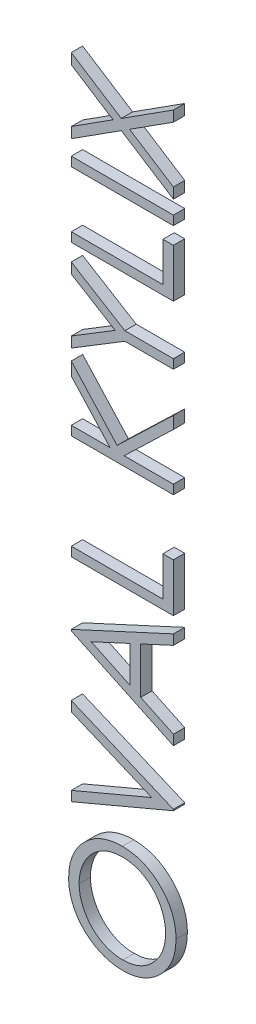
ISO-10303-21;
HEADER;
FILE_DESCRIPTION(('STEP AP214'),'2;1');
FILE_NAME('part.step','',(''),(''),'','','');
FILE_SCHEMA(('AUTOMOTIVE_DESIGN { 1 0 10303 214 1 1 1 1 }'));
ENDSEC;
DATA;
#1=APPLICATION_CONTEXT('core data for automotive mechanical design processes');
#2=APPLICATION_PROTOCOL_DEFINITION('international standard','automotive_design',2000,#1);
#3=PRODUCT_CONTEXT('',#1,'mechanical');
#4=PRODUCT('Part','Part','',(#3));
#5=PRODUCT_RELATED_PRODUCT_CATEGORY('part','',(#4));
#6=PRODUCT_DEFINITION_FORMATION('','',#4);
#7=PRODUCT_DEFINITION_CONTEXT('part definition',#1,'design');
#8=PRODUCT_DEFINITION('design','',#6,#7);
#9=PRODUCT_DEFINITION_SHAPE('','',#8);
#10=(LENGTH_UNIT() NAMED_UNIT(*) SI_UNIT(.MILLI.,.METRE.));
#11=(NAMED_UNIT(*) PLANE_ANGLE_UNIT() SI_UNIT($,.RADIAN.));
#12=(NAMED_UNIT(*) SI_UNIT($,.STERADIAN.) SOLID_ANGLE_UNIT());
#13=UNCERTAINTY_MEASURE_WITH_UNIT(LENGTH_MEASURE(1.E-05),#10,'distance_accuracy_value','');
#14=(GEOMETRIC_REPRESENTATION_CONTEXT(3) GLOBAL_UNCERTAINTY_ASSIGNED_CONTEXT((#13)) GLOBAL_UNIT_ASSIGNED_CONTEXT((#10,
#11,#12)) REPRESENTATION_CONTEXT('',''));
#15=CARTESIAN_POINT('',(0.,0.,0.));
#16=DIRECTION('',(0.,0.,1.));
#17=DIRECTION('',(1.,0.,0.));
#18=AXIS2_PLACEMENT_3D('',#15,#16,#17);
#19=CARTESIAN_POINT('',(149.098557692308,647.271634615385,10.));
#20=DIRECTION('',(0.539190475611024,-0.842183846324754,0.));
#21=DIRECTION('',(0.842183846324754,0.539190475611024,0.));
#22=AXIS2_PLACEMENT_3D('',#19,#20,#21);
#23=PLANE('',#22);
#24=DIRECTION('',(-0.842183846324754,-0.539190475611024,0.));
#25=VECTOR('',#24,1.);
#26=CARTESIAN_POINT('',(149.098557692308,647.271634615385,0.));
#27=LINE('',#26,#25);
#28=CARTESIAN_POINT('',(149.098557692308,647.271634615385,0.));
#29=VERTEX_POINT('',#28);
#30=CARTESIAN_POINT('',(105.,619.038461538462,0.));
#31=VERTEX_POINT('',#30);
#32=EDGE_CURVE('E165',#29,#31,#27,.T.);
#33=ORIENTED_EDGE('',*,*,#32,.F.);
#34=DIRECTION('',(0.,0.,-1.));
#35=VECTOR('',#34,1.);
#36=CARTESIAN_POINT('',(149.098557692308,647.271634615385,10.));
#37=LINE('',#36,#35);
#38=CARTESIAN_POINT('',(149.098557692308,647.271634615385,10.));
#39=VERTEX_POINT('',#38);
#40=EDGE_CURVE('E12',#39,#29,#37,.T.);
#41=ORIENTED_EDGE('',*,*,#40,.F.);
#42=DIRECTION('',(-0.842183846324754,-0.539190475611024,0.));
#43=VECTOR('',#42,1.);
#44=CARTESIAN_POINT('',(149.098557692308,647.271634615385,10.));
#45=LINE('',#44,#43);
#46=CARTESIAN_POINT('',(105.,619.038461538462,10.));
#47=VERTEX_POINT('',#46);
#48=EDGE_CURVE('E197',#39,#47,#45,.T.);
#49=ORIENTED_EDGE('',*,*,#48,.T.);
#50=DIRECTION('',(0.,0.,-1.));
#51=VECTOR('',#50,1.);
#52=CARTESIAN_POINT('',(105.,619.038461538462,10.));
#53=LINE('',#52,#51);
#54=EDGE_CURVE('E47',#47,#31,#53,.T.);
#55=ORIENTED_EDGE('',*,*,#54,.T.);
#56=EDGE_LOOP('',(#33,#41,#49,#55));
#57=FACE_BOUND('',#56,.T.);
#58=ADVANCED_FACE('F44',(#57),#23,.T.);
#59=CARTESIAN_POINT('',(195.,617.884615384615,10.));
#60=DIRECTION('',(-0.539185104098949,-0.842187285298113,0.));
#61=DIRECTION('',(0.842187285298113,-0.539185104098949,0.));
#62=AXIS2_PLACEMENT_3D('',#59,#60,#61);
#63=PLANE('',#62);
#64=DIRECTION('',(-0.842187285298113,0.539185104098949,0.));
#65=VECTOR('',#64,1.);
#66=CARTESIAN_POINT('',(195.,617.884615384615,0.));
#67=LINE('',#66,#65);
#68=CARTESIAN_POINT('',(195.,617.884615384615,0.));
#69=VERTEX_POINT('',#68);
#70=EDGE_CURVE('E195',#69,#29,#67,.T.);
#71=ORIENTED_EDGE('',*,*,#70,.F.);
#72=DIRECTION('',(0.,0.,-1.));
#73=VECTOR('',#72,1.);
#74=CARTESIAN_POINT('',(195.,617.884615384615,10.));
#75=LINE('',#74,#73);
#76=CARTESIAN_POINT('',(195.,617.884615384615,10.));
#77=VERTEX_POINT('',#76);
#78=EDGE_CURVE('E53',#77,#69,#75,.T.);
#79=ORIENTED_EDGE('',*,*,#78,.F.);
#80=DIRECTION('',(-0.842187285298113,0.539185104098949,0.));
#81=VECTOR('',#80,1.);
#82=CARTESIAN_POINT('',(195.,617.884615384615,10.));
#83=LINE('',#82,#81);
#84=EDGE_CURVE('E155',#77,#39,#83,.T.);
#85=ORIENTED_EDGE('',*,*,#84,.T.);
#86=ORIENTED_EDGE('',*,*,#40,.T.);
#87=EDGE_LOOP('',(#71,#79,#85,#86));
#88=FACE_BOUND('',#87,.T.);
#89=ADVANCED_FACE('F217',(#88),#63,.T.);
#90=CARTESIAN_POINT('',(195.,627.205528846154,10.));
#91=DIRECTION('',(1.,0.,0.));
#92=DIRECTION('',(0.,0.,-1.));
#93=AXIS2_PLACEMENT_3D('',#90,#91,#92);
#94=PLANE('',#93);
#95=DIRECTION('',(0.,-1.,0.));
#96=VECTOR('',#95,1.);
#97=CARTESIAN_POINT('',(195.,627.205528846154,0.));
#98=LINE('',#97,#96);
#99=CARTESIAN_POINT('',(195.,627.205528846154,0.));
#100=VERTEX_POINT('',#99);
#101=EDGE_CURVE('E142',#100,#69,#98,.T.);
#102=ORIENTED_EDGE('',*,*,#101,.F.);
#103=DIRECTION('',(0.,0.,-1.));
#104=VECTOR('',#103,1.);
#105=CARTESIAN_POINT('',(195.,627.205528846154,10.));
#106=LINE('',#105,#104);
#107=CARTESIAN_POINT('',(195.,627.205528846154,10.));
#108=VERTEX_POINT('',#107);
#109=EDGE_CURVE('E137',#108,#100,#106,.T.);
#110=ORIENTED_EDGE('',*,*,#109,.F.);
#111=DIRECTION('',(0.,-1.,0.));
#112=VECTOR('',#111,1.);
#113=CARTESIAN_POINT('',(195.,627.205528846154,10.));
#114=LINE('',#113,#112);
#115=EDGE_CURVE('E140',#108,#77,#114,.T.);
#116=ORIENTED_EDGE('',*,*,#115,.T.);
#117=ORIENTED_EDGE('',*,*,#78,.T.);
#118=EDGE_LOOP('',(#102,#110,#116,#117));
#119=FACE_BOUND('',#118,.T.);
#120=ADVANCED_FACE('F139',(#119),#94,.T.);
#121=CARTESIAN_POINT('',(156.382211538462,651.923076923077,10.));
#122=DIRECTION('',(0.539087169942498,0.842249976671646,0.));
#123=DIRECTION('',(-0.842249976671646,0.539087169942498,0.));
#124=AXIS2_PLACEMENT_3D('',#121,#122,#123);
#125=PLANE('',#124);
#126=DIRECTION('',(0.842249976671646,-0.539087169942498,0.));
#127=VECTOR('',#126,1.);
#128=CARTESIAN_POINT('',(156.382211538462,651.923076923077,0.));
#129=LINE('',#128,#127);
#130=CARTESIAN_POINT('',(156.382211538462,651.923076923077,0.));
#131=VERTEX_POINT('',#130);
#132=EDGE_CURVE('E192',#131,#100,#129,.T.);
#133=ORIENTED_EDGE('',*,*,#132,.F.);
#134=DIRECTION('',(0.,0.,-1.));
#135=VECTOR('',#134,1.);
#136=CARTESIAN_POINT('',(156.382211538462,651.923076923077,10.));
#137=LINE('',#136,#135);
#138=CARTESIAN_POINT('',(156.382211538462,651.923076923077,10.));
#139=VERTEX_POINT('',#138);
#140=EDGE_CURVE('E147',#139,#131,#137,.T.);
#141=ORIENTED_EDGE('',*,*,#140,.F.);
#142=DIRECTION('',(0.842249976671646,-0.539087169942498,0.));
#143=VECTOR('',#142,1.);
#144=CARTESIAN_POINT('',(156.382211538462,651.923076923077,10.));
#145=LINE('',#144,#143);
#146=EDGE_CURVE('E153',#139,#108,#145,.T.);
#147=ORIENTED_EDGE('',*,*,#146,.T.);
#148=ORIENTED_EDGE('',*,*,#109,.T.);
#149=EDGE_LOOP('',(#133,#141,#147,#148));
#150=FACE_BOUND('',#149,.T.);
#151=ADVANCED_FACE('F157',(#150),#125,.T.);
#152=CARTESIAN_POINT('',(195.,676.640625,10.));
#153=DIRECTION('',(0.539087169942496,-0.842249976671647,0.));
#154=DIRECTION('',(0.842249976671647,0.539087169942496,0.));
#155=AXIS2_PLACEMENT_3D('',#152,#153,#154);
#156=PLANE('',#155);
#157=DIRECTION('',(-0.842249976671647,-0.539087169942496,0.));
#158=VECTOR('',#157,1.);
#159=CARTESIAN_POINT('',(195.,676.640625,0.));
#160=LINE('',#159,#158);
#161=CARTESIAN_POINT('',(195.,676.640625,0.));
#162=VERTEX_POINT('',#161);
#163=EDGE_CURVE('E189',#162,#131,#160,.T.);
#164=ORIENTED_EDGE('',*,*,#163,.F.);
#165=DIRECTION('',(0.,0.,-1.));
#166=VECTOR('',#165,1.);
#167=CARTESIAN_POINT('',(195.,676.640625,10.));
#168=LINE('',#167,#166);
#169=CARTESIAN_POINT('',(195.,676.640625,10.));
#170=VERTEX_POINT('',#169);
#171=EDGE_CURVE('E201',#170,#162,#168,.T.);
#172=ORIENTED_EDGE('',*,*,#171,.F.);
#173=DIRECTION('',(-0.842249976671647,-0.539087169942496,0.));
#174=VECTOR('',#173,1.);
#175=CARTESIAN_POINT('',(195.,676.640625,10.));
#176=LINE('',#175,#174);
#177=EDGE_CURVE('E158',#170,#139,#176,.T.);
#178=ORIENTED_EDGE('',*,*,#177,.T.);
#179=ORIENTED_EDGE('',*,*,#140,.T.);
#180=EDGE_LOOP('',(#164,#172,#178,#179));
#181=FACE_BOUND('',#180,.T.);
#182=ADVANCED_FACE('F230',(#181),#156,.T.);
#183=CARTESIAN_POINT('',(195.,685.961538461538,10.));
#184=DIRECTION('',(1.,0.,0.));
#185=DIRECTION('',(0.,0.,-1.));
#186=AXIS2_PLACEMENT_3D('',#183,#184,#185);
#187=PLANE('',#186);
#188=DIRECTION('',(0.,-1.,0.));
#189=VECTOR('',#188,1.);
#190=CARTESIAN_POINT('',(195.,685.961538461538,0.));
#191=LINE('',#190,#189);
#192=CARTESIAN_POINT('',(195.,685.961538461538,0.));
#193=VERTEX_POINT('',#192);
#194=EDGE_CURVE('E186',#193,#162,#191,.T.);
#195=ORIENTED_EDGE('',*,*,#194,.F.);
#196=DIRECTION('',(0.,0.,-1.));
#197=VECTOR('',#196,1.);
#198=CARTESIAN_POINT('',(195.,685.961538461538,10.));
#199=LINE('',#198,#197);
#200=CARTESIAN_POINT('',(195.,685.961538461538,10.));
#201=VERTEX_POINT('',#200);
#202=EDGE_CURVE('E203',#201,#193,#199,.T.);
#203=ORIENTED_EDGE('',*,*,#202,.F.);
#204=DIRECTION('',(0.,-1.,0.));
#205=VECTOR('',#204,1.);
#206=CARTESIAN_POINT('',(195.,685.961538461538,10.));
#207=LINE('',#206,#205);
#208=EDGE_CURVE('E160',#201,#170,#207,.T.);
#209=ORIENTED_EDGE('',*,*,#208,.T.);
#210=ORIENTED_EDGE('',*,*,#171,.T.);
#211=EDGE_LOOP('',(#195,#203,#209,#210));
#212=FACE_BOUND('',#211,.T.);
#213=ADVANCED_FACE('F233',(#212),#187,.T.);
#214=CARTESIAN_POINT('',(149.098557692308,656.592548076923,10.));
#215=DIRECTION('',(-0.538950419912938,0.842337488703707,0.));
#216=DIRECTION('',(-0.842337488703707,-0.538950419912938,0.));
#217=AXIS2_PLACEMENT_3D('',#214,#215,#216);
#218=PLANE('',#217);
#219=DIRECTION('',(0.842337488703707,0.538950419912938,0.));
#220=VECTOR('',#219,1.);
#221=CARTESIAN_POINT('',(149.098557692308,656.592548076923,0.));
#222=LINE('',#221,#220);
#223=CARTESIAN_POINT('',(149.098557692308,656.592548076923,0.));
#224=VERTEX_POINT('',#223);
#225=EDGE_CURVE('E183',#224,#193,#222,.T.);
#226=ORIENTED_EDGE('',*,*,#225,.F.);
#227=DIRECTION('',(0.,0.,-1.));
#228=VECTOR('',#227,1.);
#229=CARTESIAN_POINT('',(149.098557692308,656.592548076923,10.));
#230=LINE('',#229,#228);
#231=CARTESIAN_POINT('',(149.098557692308,656.592548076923,10.));
#232=VERTEX_POINT('',#231);
#233=EDGE_CURVE('E205',#232,#224,#230,.T.);
#234=ORIENTED_EDGE('',*,*,#233,.F.);
#235=DIRECTION('',(0.842337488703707,0.538950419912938,0.));
#236=VECTOR('',#235,1.);
#237=CARTESIAN_POINT('',(149.098557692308,656.592548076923,10.));
#238=LINE('',#237,#236);
#239=EDGE_CURVE('E365',#232,#201,#238,.T.);
#240=ORIENTED_EDGE('',*,*,#239,.T.);
#241=ORIENTED_EDGE('',*,*,#202,.T.);
#242=EDGE_LOOP('',(#226,#234,#240,#241));
#243=FACE_BOUND('',#242,.T.);
#244=ADVANCED_FACE('F237',(#243),#218,.T.);
#245=CARTESIAN_POINT('',(105.,684.807692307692,10.));
#246=DIRECTION('',(0.538946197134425,0.842340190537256,0.));
#247=DIRECTION('',(-0.842340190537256,0.538946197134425,0.));
#248=AXIS2_PLACEMENT_3D('',#245,#246,#247);
#249=PLANE('',#248);
#250=DIRECTION('',(0.842340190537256,-0.538946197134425,0.));
#251=VECTOR('',#250,1.);
#252=CARTESIAN_POINT('',(105.,684.807692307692,0.));
#253=LINE('',#252,#251);
#254=CARTESIAN_POINT('',(105.,684.807692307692,0.));
#255=VERTEX_POINT('',#254);
#256=EDGE_CURVE('E180',#255,#224,#253,.T.);
#257=ORIENTED_EDGE('',*,*,#256,.F.);
#258=DIRECTION('',(0.,0.,-1.));
#259=VECTOR('',#258,1.);
#260=CARTESIAN_POINT('',(105.,684.807692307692,10.));
#261=LINE('',#260,#259);
#262=CARTESIAN_POINT('',(105.,684.807692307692,10.));
#263=VERTEX_POINT('',#262);
#264=EDGE_CURVE('E207',#263,#255,#261,.T.);
#265=ORIENTED_EDGE('',*,*,#264,.F.);
#266=DIRECTION('',(0.842340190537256,-0.538946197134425,0.));
#267=VECTOR('',#266,1.);
#268=CARTESIAN_POINT('',(105.,684.807692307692,10.));
#269=LINE('',#268,#267);
#270=EDGE_CURVE('E369',#263,#232,#269,.T.);
#271=ORIENTED_EDGE('',*,*,#270,.T.);
#272=ORIENTED_EDGE('',*,*,#233,.T.);
#273=EDGE_LOOP('',(#257,#265,#271,#272));
#274=FACE_BOUND('',#273,.T.);
#275=ADVANCED_FACE('F241',(#274),#249,.T.);
#276=CARTESIAN_POINT('',(105.,675.486778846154,10.));
#277=DIRECTION('',(-1.,0.,0.));
#278=DIRECTION('',(0.,0.,1.));
#279=AXIS2_PLACEMENT_3D('',#276,#277,#278);
#280=PLANE('',#279);
#281=DIRECTION('',(0.,1.,0.));
#282=VECTOR('',#281,1.);
#283=CARTESIAN_POINT('',(105.,675.486778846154,0.));
#284=LINE('',#283,#282);
#285=CARTESIAN_POINT('',(105.,675.486778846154,0.));
#286=VERTEX_POINT('',#285);
#287=EDGE_CURVE('E177',#286,#255,#284,.T.);
#288=ORIENTED_EDGE('',*,*,#287,.F.);
#289=DIRECTION('',(0.,0.,-1.));
#290=VECTOR('',#289,1.);
#291=CARTESIAN_POINT('',(105.,675.486778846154,10.));
#292=LINE('',#291,#290);
#293=CARTESIAN_POINT('',(105.,675.486778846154,10.));
#294=VERTEX_POINT('',#293);
#295=EDGE_CURVE('E209',#294,#286,#292,.T.);
#296=ORIENTED_EDGE('',*,*,#295,.F.);
#297=DIRECTION('',(0.,1.,0.));
#298=VECTOR('',#297,1.);
#299=CARTESIAN_POINT('',(105.,675.486778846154,10.));
#300=LINE('',#299,#298);
#301=EDGE_CURVE('E358',#294,#263,#300,.T.);
#302=ORIENTED_EDGE('',*,*,#301,.T.);
#303=ORIENTED_EDGE('',*,*,#264,.T.);
#304=EDGE_LOOP('',(#288,#296,#302,#303));
#305=FACE_BOUND('',#304,.T.);
#306=ADVANCED_FACE('F245',(#305),#280,.T.);
#307=CARTESIAN_POINT('',(141.814903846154,651.923076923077,10.));
#308=DIRECTION('',(-0.53908880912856,-0.842248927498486,0.));
#309=DIRECTION('',(0.842248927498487,-0.53908880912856,0.));
#310=AXIS2_PLACEMENT_3D('',#307,#308,#309);
#311=PLANE('',#310);
#312=DIRECTION('',(-0.842248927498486,0.53908880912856,0.));
#313=VECTOR('',#312,1.);
#314=CARTESIAN_POINT('',(141.814903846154,651.923076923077,0.));
#315=LINE('',#314,#313);
#316=CARTESIAN_POINT('',(141.814903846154,651.923076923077,0.));
#317=VERTEX_POINT('',#316);
#318=EDGE_CURVE('E174',#317,#286,#315,.T.);
#319=ORIENTED_EDGE('',*,*,#318,.F.);
#320=DIRECTION('',(0.,0.,-1.));
#321=VECTOR('',#320,1.);
#322=CARTESIAN_POINT('',(141.814903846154,651.923076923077,10.));
#323=LINE('',#322,#321);
#324=CARTESIAN_POINT('',(141.814903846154,651.923076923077,10.));
#325=VERTEX_POINT('',#324);
#326=EDGE_CURVE('E211',#325,#317,#323,.T.);
#327=ORIENTED_EDGE('',*,*,#326,.F.);
#328=DIRECTION('',(-0.842248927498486,0.53908880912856,0.));
#329=VECTOR('',#328,1.);
#330=CARTESIAN_POINT('',(141.814903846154,651.923076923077,10.));
#331=LINE('',#330,#329);
#332=EDGE_CURVE('E354',#325,#294,#331,.T.);
#333=ORIENTED_EDGE('',*,*,#332,.T.);
#334=ORIENTED_EDGE('',*,*,#295,.T.);
#335=EDGE_LOOP('',(#319,#327,#333,#334));
#336=FACE_BOUND('',#335,.T.);
#337=ADVANCED_FACE('F249',(#336),#311,.T.);
#338=CARTESIAN_POINT('',(105.,628.359375,10.));
#339=DIRECTION('',(-0.539088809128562,0.842248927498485,0.));
#340=DIRECTION('',(-0.842248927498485,-0.539088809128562,0.));
#341=AXIS2_PLACEMENT_3D('',#338,#339,#340);
#342=PLANE('',#341);
#343=DIRECTION('',(0.842248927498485,0.539088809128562,0.));
#344=VECTOR('',#343,1.);
#345=CARTESIAN_POINT('',(105.,628.359375,0.));
#346=LINE('',#345,#344);
#347=CARTESIAN_POINT('',(105.,628.359375,0.));
#348=VERTEX_POINT('',#347);
#349=EDGE_CURVE('E171',#348,#317,#346,.T.);
#350=ORIENTED_EDGE('',*,*,#349,.F.);
#351=DIRECTION('',(0.,0.,-1.));
#352=VECTOR('',#351,1.);
#353=CARTESIAN_POINT('',(105.,628.359375,10.));
#354=LINE('',#353,#352);
#355=CARTESIAN_POINT('',(105.,628.359375,10.));
#356=VERTEX_POINT('',#355);
#357=EDGE_CURVE('E212',#356,#348,#354,.T.);
#358=ORIENTED_EDGE('',*,*,#357,.F.);
#359=DIRECTION('',(0.842248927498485,0.539088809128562,0.));
#360=VECTOR('',#359,1.);
#361=CARTESIAN_POINT('',(105.,628.359375,10.));
#362=LINE('',#361,#360);
#363=EDGE_CURVE('E375',#356,#325,#362,.T.);
#364=ORIENTED_EDGE('',*,*,#363,.T.);
#365=ORIENTED_EDGE('',*,*,#326,.T.);
#366=EDGE_LOOP('',(#350,#358,#364,#365));
#367=FACE_BOUND('',#366,.T.);
#368=ADVANCED_FACE('F253',(#367),#342,.T.);
#369=CARTESIAN_POINT('',(105.,619.038461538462,10.));
#370=DIRECTION('',(-1.,0.,0.));
#371=DIRECTION('',(0.,0.,1.));
#372=AXIS2_PLACEMENT_3D('',#369,#370,#371);
#373=PLANE('',#372);
#374=DIRECTION('',(0.,1.,0.));
#375=VECTOR('',#374,1.);
#376=CARTESIAN_POINT('',(105.,619.038461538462,0.));
#377=LINE('',#376,#375);
#378=EDGE_CURVE('E168',#31,#348,#377,.T.);
#379=ORIENTED_EDGE('',*,*,#378,.F.);
#380=ORIENTED_EDGE('',*,*,#54,.F.);
#381=DIRECTION('',(0.,1.,0.));
#382=VECTOR('',#381,1.);
#383=CARTESIAN_POINT('',(105.,619.038461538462,10.));
#384=LINE('',#383,#382);
#385=EDGE_CURVE('E377',#47,#356,#384,.T.);
#386=ORIENTED_EDGE('',*,*,#385,.T.);
#387=ORIENTED_EDGE('',*,*,#357,.T.);
#388=EDGE_LOOP('',(#379,#380,#386,#387));
#389=FACE_BOUND('',#388,.T.);
#390=ADVANCED_FACE('F214',(#389),#373,.T.);
#391=CARTESIAN_POINT('',(0.,0.,10.));
#392=DIRECTION('',(0.,0.,-1.));
#393=DIRECTION('',(-1.,0.,0.));
#394=AXIS2_PLACEMENT_3D('',#391,#392,#393);
#395=PLANE('',#394);
#396=ORIENTED_EDGE('',*,*,#48,.F.);
#397=ORIENTED_EDGE('',*,*,#84,.F.);
#398=ORIENTED_EDGE('',*,*,#115,.F.);
#399=ORIENTED_EDGE('',*,*,#146,.F.);
#400=ORIENTED_EDGE('',*,*,#177,.F.);
#401=ORIENTED_EDGE('',*,*,#208,.F.);
#402=ORIENTED_EDGE('',*,*,#239,.F.);
#403=ORIENTED_EDGE('',*,*,#270,.F.);
#404=ORIENTED_EDGE('',*,*,#301,.F.);
#405=ORIENTED_EDGE('',*,*,#332,.F.);
#406=ORIENTED_EDGE('',*,*,#363,.F.);
#407=ORIENTED_EDGE('',*,*,#385,.F.);
#408=EDGE_LOOP('',(#396,#397,#398,#399,#400,#401,#402,#403,#404,#405,#406,#407));
#409=FACE_BOUND('',#408,.T.);
#410=ADVANCED_FACE('F151',(#409),#395,.F.);
#411=CARTESIAN_POINT('',(0.,0.,0.));
#412=DIRECTION('',(0.,0.,-1.));
#413=DIRECTION('',(-1.,0.,0.));
#414=AXIS2_PLACEMENT_3D('',#411,#412,#413);
#415=PLANE('',#414);
#416=ORIENTED_EDGE('',*,*,#32,.T.);
#417=ORIENTED_EDGE('',*,*,#378,.T.);
#418=ORIENTED_EDGE('',*,*,#349,.T.);
#419=ORIENTED_EDGE('',*,*,#318,.T.);
#420=ORIENTED_EDGE('',*,*,#287,.T.);
#421=ORIENTED_EDGE('',*,*,#256,.T.);
#422=ORIENTED_EDGE('',*,*,#225,.T.);
#423=ORIENTED_EDGE('',*,*,#194,.T.);
#424=ORIENTED_EDGE('',*,*,#163,.T.);
#425=ORIENTED_EDGE('',*,*,#132,.T.);
#426=ORIENTED_EDGE('',*,*,#101,.T.);
#427=ORIENTED_EDGE('',*,*,#70,.T.);
#428=EDGE_LOOP('',(#416,#417,#418,#419,#420,#421,#422,#423,#424,#425,#426,#427));
#429=FACE_BOUND('',#428,.T.);
#430=ADVANCED_FACE('F216',(#429),#415,.T.);
#431=CLOSED_SHELL('',(#58,#89,#120,#151,#182,#213,#244,#275,#306,#337,#368,#390,#410,#430));
#432=MANIFOLD_SOLID_BREP('B2',#431);
#433=CARTESIAN_POINT('',(195.,597.692307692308,10.));
#434=DIRECTION('',(0.,-1.,0.));
#435=DIRECTION('',(0.,0.,-1.));
#436=AXIS2_PLACEMENT_3D('',#433,#434,#435);
#437=PLANE('',#436);
#438=DIRECTION('',(-1.,0.,0.));
#439=VECTOR('',#438,1.);
#440=CARTESIAN_POINT('',(195.,597.692307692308,0.));
#441=LINE('',#440,#439);
#442=CARTESIAN_POINT('',(195.,597.692307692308,0.));
#443=VERTEX_POINT('',#442);
#444=CARTESIAN_POINT('',(105.,597.692307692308,0.));
#445=VERTEX_POINT('',#444);
#446=EDGE_CURVE('E456',#443,#445,#441,.T.);
#447=ORIENTED_EDGE('',*,*,#446,.F.);
#448=DIRECTION('',(0.,0.,-1.));
#449=VECTOR('',#448,1.);
#450=CARTESIAN_POINT('',(195.,597.692307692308,10.));
#451=LINE('',#450,#449);
#452=CARTESIAN_POINT('',(195.,597.692307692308,10.));
#453=VERTEX_POINT('',#452);
#454=EDGE_CURVE('E42',#453,#443,#451,.T.);
#455=ORIENTED_EDGE('',*,*,#454,.F.);
#456=DIRECTION('',(-1.,0.,0.));
#457=VECTOR('',#456,1.);
#458=CARTESIAN_POINT('',(195.,597.692307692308,10.));
#459=LINE('',#458,#457);
#460=CARTESIAN_POINT('',(105.,597.692307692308,10.));
#461=VERTEX_POINT('',#460);
#462=EDGE_CURVE('E450',#453,#461,#459,.T.);
#463=ORIENTED_EDGE('',*,*,#462,.T.);
#464=DIRECTION('',(0.,0.,-1.));
#465=VECTOR('',#464,1.);
#466=CARTESIAN_POINT('',(105.,597.692307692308,10.));
#467=LINE('',#466,#465);
#468=EDGE_CURVE('E395',#461,#445,#467,.T.);
#469=ORIENTED_EDGE('',*,*,#468,.T.);
#470=EDGE_LOOP('',(#447,#455,#463,#469));
#471=FACE_BOUND('',#470,.T.);
#472=ADVANCED_FACE('F392',(#471),#437,.T.);
#473=CARTESIAN_POINT('',(195.,605.769230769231,10.));
#474=DIRECTION('',(1.,0.,0.));
#475=DIRECTION('',(0.,0.,-1.));
#476=AXIS2_PLACEMENT_3D('',#473,#474,#475);
#477=PLANE('',#476);
#478=DIRECTION('',(0.,-1.,0.));
#479=VECTOR('',#478,1.);
#480=CARTESIAN_POINT('',(195.,605.769230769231,0.));
#481=LINE('',#480,#479);
#482=CARTESIAN_POINT('',(195.,605.769230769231,0.));
#483=VERTEX_POINT('',#482);
#484=EDGE_CURVE('E452',#483,#443,#481,.T.);
#485=ORIENTED_EDGE('',*,*,#484,.F.);
#486=DIRECTION('',(0.,0.,-1.));
#487=VECTOR('',#486,1.);
#488=CARTESIAN_POINT('',(195.,605.769230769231,10.));
#489=LINE('',#488,#487);
#490=CARTESIAN_POINT('',(195.,605.769230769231,10.));
#491=VERTEX_POINT('',#490);
#492=EDGE_CURVE('E401',#491,#483,#489,.T.);
#493=ORIENTED_EDGE('',*,*,#492,.F.);
#494=DIRECTION('',(0.,-1.,0.));
#495=VECTOR('',#494,1.);
#496=CARTESIAN_POINT('',(195.,605.769230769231,10.));
#497=LINE('',#496,#495);
#498=EDGE_CURVE('E447',#491,#453,#497,.T.);
#499=ORIENTED_EDGE('',*,*,#498,.T.);
#500=ORIENTED_EDGE('',*,*,#454,.T.);
#501=EDGE_LOOP('',(#485,#493,#499,#500));
#502=FACE_BOUND('',#501,.T.);
#503=ADVANCED_FACE('F466',(#502),#477,.T.);
#504=CARTESIAN_POINT('',(105.,605.769230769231,10.));
#505=DIRECTION('',(0.,1.,0.));
#506=DIRECTION('',(0.,0.,1.));
#507=AXIS2_PLACEMENT_3D('',#504,#505,#506);
#508=PLANE('',#507);
#509=DIRECTION('',(1.,0.,0.));
#510=VECTOR('',#509,1.);
#511=CARTESIAN_POINT('',(105.,605.769230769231,0.));
#512=LINE('',#511,#510);
#513=CARTESIAN_POINT('',(105.,605.769230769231,0.));
#514=VERTEX_POINT('',#513);
#515=EDGE_CURVE('E442',#514,#483,#512,.T.);
#516=ORIENTED_EDGE('',*,*,#515,.F.);
#517=DIRECTION('',(0.,0.,-1.));
#518=VECTOR('',#517,1.);
#519=CARTESIAN_POINT('',(105.,605.769230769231,10.));
#520=LINE('',#519,#518);
#521=CARTESIAN_POINT('',(105.,605.769230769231,10.));
#522=VERTEX_POINT('',#521);
#523=EDGE_CURVE('E437',#522,#514,#520,.T.);
#524=ORIENTED_EDGE('',*,*,#523,.F.);
#525=DIRECTION('',(1.,0.,0.));
#526=VECTOR('',#525,1.);
#527=CARTESIAN_POINT('',(105.,605.769230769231,10.));
#528=LINE('',#527,#526);
#529=EDGE_CURVE('E440',#522,#491,#528,.T.);
#530=ORIENTED_EDGE('',*,*,#529,.T.);
#531=ORIENTED_EDGE('',*,*,#492,.T.);
#532=EDGE_LOOP('',(#516,#524,#530,#531));
#533=FACE_BOUND('',#532,.T.);
#534=ADVANCED_FACE('F439',(#533),#508,.T.);
#535=CARTESIAN_POINT('',(105.,597.692307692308,10.));
#536=DIRECTION('',(-1.,0.,0.));
#537=DIRECTION('',(0.,0.,1.));
#538=AXIS2_PLACEMENT_3D('',#535,#536,#537);
#539=PLANE('',#538);
#540=DIRECTION('',(0.,1.,0.));
#541=VECTOR('',#540,1.);
#542=CARTESIAN_POINT('',(105.,597.692307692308,0.));
#543=LINE('',#542,#541);
#544=EDGE_CURVE('E459',#445,#514,#543,.T.);
#545=ORIENTED_EDGE('',*,*,#544,.F.);
#546=ORIENTED_EDGE('',*,*,#468,.F.);
#547=DIRECTION('',(0.,1.,0.));
#548=VECTOR('',#547,1.);
#549=CARTESIAN_POINT('',(105.,597.692307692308,10.));
#550=LINE('',#549,#548);
#551=EDGE_CURVE('E446',#461,#522,#550,.T.);
#552=ORIENTED_EDGE('',*,*,#551,.T.);
#553=ORIENTED_EDGE('',*,*,#523,.T.);
#554=EDGE_LOOP('',(#545,#546,#552,#553));
#555=FACE_BOUND('',#554,.T.);
#556=ADVANCED_FACE('F449',(#555),#539,.T.);
#557=CARTESIAN_POINT('',(0.,0.,10.));
#558=DIRECTION('',(0.,0.,-1.));
#559=DIRECTION('',(-1.,0.,0.));
#560=AXIS2_PLACEMENT_3D('',#557,#558,#559);
#561=PLANE('',#560);
#562=ORIENTED_EDGE('',*,*,#462,.F.);
#563=ORIENTED_EDGE('',*,*,#498,.F.);
#564=ORIENTED_EDGE('',*,*,#529,.F.);
#565=ORIENTED_EDGE('',*,*,#551,.F.);
#566=EDGE_LOOP('',(#562,#563,#564,#565));
#567=FACE_BOUND('',#566,.T.);
#568=ADVANCED_FACE('F445',(#567),#561,.F.);
#569=CARTESIAN_POINT('',(0.,0.,0.));
#570=DIRECTION('',(0.,0.,-1.));
#571=DIRECTION('',(-1.,0.,0.));
#572=AXIS2_PLACEMENT_3D('',#569,#570,#571);
#573=PLANE('',#572);
#574=ORIENTED_EDGE('',*,*,#446,.T.);
#575=ORIENTED_EDGE('',*,*,#544,.T.);
#576=ORIENTED_EDGE('',*,*,#515,.T.);
#577=ORIENTED_EDGE('',*,*,#484,.T.);
#578=EDGE_LOOP('',(#574,#575,#576,#577));
#579=FACE_BOUND('',#578,.T.);
#580=ADVANCED_FACE('F465',(#579),#573,.T.);
#581=CLOSED_SHELL('',(#472,#503,#534,#556,#568,#580));
#582=MANIFOLD_SOLID_BREP('B6',#581);
#583=CARTESIAN_POINT('',(195.,540.,10.));
#584=DIRECTION('',(0.,-1.,0.));
#585=DIRECTION('',(0.,0.,-1.));
#586=AXIS2_PLACEMENT_3D('',#583,#584,#585);
#587=PLANE('',#586);
#588=DIRECTION('',(-1.,0.,0.));
#589=VECTOR('',#588,1.);
#590=CARTESIAN_POINT('',(195.,540.,0.));
#591=LINE('',#590,#589);
#592=CARTESIAN_POINT('',(195.,540.,0.));
#593=VERTEX_POINT('',#592);
#594=CARTESIAN_POINT('',(105.,540.,0.));
#595=VERTEX_POINT('',#594);
#596=EDGE_CURVE('E617',#593,#595,#591,.T.);
#597=ORIENTED_EDGE('',*,*,#596,.F.);
#598=DIRECTION('',(0.,0.,-1.));
#599=VECTOR('',#598,1.);
#600=CARTESIAN_POINT('',(195.,540.,10.));
#601=LINE('',#600,#599);
#602=CARTESIAN_POINT('',(195.,540.,10.));
#603=VERTEX_POINT('',#602);
#604=EDGE_CURVE('E390',#603,#593,#601,.T.);
#605=ORIENTED_EDGE('',*,*,#604,.F.);
#606=DIRECTION('',(-1.,0.,0.));
#607=VECTOR('',#606,1.);
#608=CARTESIAN_POINT('',(195.,540.,10.));
#609=LINE('',#608,#607);
#610=CARTESIAN_POINT('',(105.,540.,10.));
#611=VERTEX_POINT('',#610);
#612=EDGE_CURVE('E631',#603,#611,#609,.T.);
#613=ORIENTED_EDGE('',*,*,#612,.T.);
#614=DIRECTION('',(0.,0.,-1.));
#615=VECTOR('',#614,1.);
#616=CARTESIAN_POINT('',(105.,540.,10.));
#617=LINE('',#616,#615);
#618=EDGE_CURVE('E535',#611,#595,#617,.T.);
#619=ORIENTED_EDGE('',*,*,#618,.T.);
#620=EDGE_LOOP('',(#597,#605,#613,#619));
#621=FACE_BOUND('',#620,.T.);
#622=ADVANCED_FACE('F532',(#621),#587,.T.);
#623=CARTESIAN_POINT('',(195.,582.692307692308,10.));
#624=DIRECTION('',(1.,0.,0.));
#625=DIRECTION('',(0.,0.,-1.));
#626=AXIS2_PLACEMENT_3D('',#623,#624,#625);
#627=PLANE('',#626);
#628=DIRECTION('',(0.,-1.,0.));
#629=VECTOR('',#628,1.);
#630=CARTESIAN_POINT('',(195.,582.692307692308,0.));
#631=LINE('',#630,#629);
#632=CARTESIAN_POINT('',(195.,582.692307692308,0.));
#633=VERTEX_POINT('',#632);
#634=EDGE_CURVE('E629',#633,#593,#631,.T.);
#635=ORIENTED_EDGE('',*,*,#634,.F.);
#636=DIRECTION('',(0.,0.,-1.));
#637=VECTOR('',#636,1.);
#638=CARTESIAN_POINT('',(195.,582.692307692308,10.));
#639=LINE('',#638,#637);
#640=CARTESIAN_POINT('',(195.,582.692307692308,10.));
#641=VERTEX_POINT('',#640);
#642=EDGE_CURVE('E541',#641,#633,#639,.T.);
#643=ORIENTED_EDGE('',*,*,#642,.F.);
#644=DIRECTION('',(0.,-1.,0.));
#645=VECTOR('',#644,1.);
#646=CARTESIAN_POINT('',(195.,582.692307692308,10.));
#647=LINE('',#646,#645);
#648=EDGE_CURVE('E607',#641,#603,#647,.T.);
#649=ORIENTED_EDGE('',*,*,#648,.T.);
#650=ORIENTED_EDGE('',*,*,#604,.T.);
#651=EDGE_LOOP('',(#635,#643,#649,#650));
#652=FACE_BOUND('',#651,.T.);
#653=ADVANCED_FACE('F639',(#652),#627,.T.);
#654=CARTESIAN_POINT('',(185.769230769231,582.692307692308,10.));
#655=DIRECTION('',(0.,1.,0.));
#656=DIRECTION('',(0.,0.,1.));
#657=AXIS2_PLACEMENT_3D('',#654,#655,#656);
#658=PLANE('',#657);
#659=DIRECTION('',(1.,0.,0.));
#660=VECTOR('',#659,1.);
#661=CARTESIAN_POINT('',(185.769230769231,582.692307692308,0.));
#662=LINE('',#661,#660);
#663=CARTESIAN_POINT('',(185.769230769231,582.692307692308,0.));
#664=VERTEX_POINT('',#663);
#665=EDGE_CURVE('E594',#664,#633,#662,.T.);
#666=ORIENTED_EDGE('',*,*,#665,.F.);
#667=DIRECTION('',(0.,0.,-1.));
#668=VECTOR('',#667,1.);
#669=CARTESIAN_POINT('',(185.769230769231,582.692307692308,10.));
#670=LINE('',#669,#668);
#671=CARTESIAN_POINT('',(185.769230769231,582.692307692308,10.));
#672=VERTEX_POINT('',#671);
#673=EDGE_CURVE('E589',#672,#664,#670,.T.);
#674=ORIENTED_EDGE('',*,*,#673,.F.);
#675=DIRECTION('',(1.,0.,0.));
#676=VECTOR('',#675,1.);
#677=CARTESIAN_POINT('',(185.769230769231,582.692307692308,10.));
#678=LINE('',#677,#676);
#679=EDGE_CURVE('E592',#672,#641,#678,.T.);
#680=ORIENTED_EDGE('',*,*,#679,.T.);
#681=ORIENTED_EDGE('',*,*,#642,.T.);
#682=EDGE_LOOP('',(#666,#674,#680,#681));
#683=FACE_BOUND('',#682,.T.);
#684=ADVANCED_FACE('F591',(#683),#658,.T.);
#685=CARTESIAN_POINT('',(185.769230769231,548.076923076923,10.));
#686=DIRECTION('',(-1.,0.,0.));
#687=DIRECTION('',(0.,0.,1.));
#688=AXIS2_PLACEMENT_3D('',#685,#686,#687);
#689=PLANE('',#688);
#690=DIRECTION('',(0.,1.,0.));
#691=VECTOR('',#690,1.);
#692=CARTESIAN_POINT('',(185.769230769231,548.076923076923,0.));
#693=LINE('',#692,#691);
#694=CARTESIAN_POINT('',(185.769230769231,548.076923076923,0.));
#695=VERTEX_POINT('',#694);
#696=EDGE_CURVE('E626',#695,#664,#693,.T.);
#697=ORIENTED_EDGE('',*,*,#696,.F.);
#698=DIRECTION('',(0.,0.,-1.));
#699=VECTOR('',#698,1.);
#700=CARTESIAN_POINT('',(185.769230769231,548.076923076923,10.));
#701=LINE('',#700,#699);
#702=CARTESIAN_POINT('',(185.769230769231,548.076923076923,10.));
#703=VERTEX_POINT('',#702);
#704=EDGE_CURVE('E599',#703,#695,#701,.T.);
#705=ORIENTED_EDGE('',*,*,#704,.F.);
#706=DIRECTION('',(0.,1.,0.));
#707=VECTOR('',#706,1.);
#708=CARTESIAN_POINT('',(185.769230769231,548.076923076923,10.));
#709=LINE('',#708,#707);
#710=EDGE_CURVE('E605',#703,#672,#709,.T.);
#711=ORIENTED_EDGE('',*,*,#710,.T.);
#712=ORIENTED_EDGE('',*,*,#673,.T.);
#713=EDGE_LOOP('',(#697,#705,#711,#712));
#714=FACE_BOUND('',#713,.T.);
#715=ADVANCED_FACE('F609',(#714),#689,.T.);
#716=CARTESIAN_POINT('',(105.,548.076923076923,10.));
#717=DIRECTION('',(0.,1.,0.));
#718=DIRECTION('',(0.,0.,1.));
#719=AXIS2_PLACEMENT_3D('',#716,#717,#718);
#720=PLANE('',#719);
#721=DIRECTION('',(1.,0.,0.));
#722=VECTOR('',#721,1.);
#723=CARTESIAN_POINT('',(105.,548.076923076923,0.));
#724=LINE('',#723,#722);
#725=CARTESIAN_POINT('',(105.,548.076923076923,0.));
#726=VERTEX_POINT('',#725);
#727=EDGE_CURVE('E623',#726,#695,#724,.T.);
#728=ORIENTED_EDGE('',*,*,#727,.F.);
#729=DIRECTION('',(0.,0.,-1.));
#730=VECTOR('',#729,1.);
#731=CARTESIAN_POINT('',(105.,548.076923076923,10.));
#732=LINE('',#731,#730);
#733=CARTESIAN_POINT('',(105.,548.076923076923,10.));
#734=VERTEX_POINT('',#733);
#735=EDGE_CURVE('E634',#734,#726,#732,.T.);
#736=ORIENTED_EDGE('',*,*,#735,.F.);
#737=DIRECTION('',(1.,0.,0.));
#738=VECTOR('',#737,1.);
#739=CARTESIAN_POINT('',(105.,548.076923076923,10.));
#740=LINE('',#739,#738);
#741=EDGE_CURVE('E610',#734,#703,#740,.T.);
#742=ORIENTED_EDGE('',*,*,#741,.T.);
#743=ORIENTED_EDGE('',*,*,#704,.T.);
#744=EDGE_LOOP('',(#728,#736,#742,#743));
#745=FACE_BOUND('',#744,.T.);
#746=ADVANCED_FACE('F652',(#745),#720,.T.);
#747=CARTESIAN_POINT('',(105.,540.,10.));
#748=DIRECTION('',(-1.,0.,0.));
#749=DIRECTION('',(0.,0.,1.));
#750=AXIS2_PLACEMENT_3D('',#747,#748,#749);
#751=PLANE('',#750);
#752=DIRECTION('',(0.,1.,0.));
#753=VECTOR('',#752,1.);
#754=CARTESIAN_POINT('',(105.,540.,0.));
#755=LINE('',#754,#753);
#756=EDGE_CURVE('E620',#595,#726,#755,.T.);
#757=ORIENTED_EDGE('',*,*,#756,.F.);
#758=ORIENTED_EDGE('',*,*,#618,.F.);
#759=DIRECTION('',(0.,1.,0.));
#760=VECTOR('',#759,1.);
#761=CARTESIAN_POINT('',(105.,540.,10.));
#762=LINE('',#761,#760);
#763=EDGE_CURVE('E612',#611,#734,#762,.T.);
#764=ORIENTED_EDGE('',*,*,#763,.T.);
#765=ORIENTED_EDGE('',*,*,#735,.T.);
#766=EDGE_LOOP('',(#757,#758,#764,#765));
#767=FACE_BOUND('',#766,.T.);
#768=ADVANCED_FACE('F636',(#767),#751,.T.);
#769=CARTESIAN_POINT('',(0.,0.,10.));
#770=DIRECTION('',(0.,0.,-1.));
#771=DIRECTION('',(-1.,0.,0.));
#772=AXIS2_PLACEMENT_3D('',#769,#770,#771);
#773=PLANE('',#772);
#774=ORIENTED_EDGE('',*,*,#612,.F.);
#775=ORIENTED_EDGE('',*,*,#648,.F.);
#776=ORIENTED_EDGE('',*,*,#679,.F.);
#777=ORIENTED_EDGE('',*,*,#710,.F.);
#778=ORIENTED_EDGE('',*,*,#741,.F.);
#779=ORIENTED_EDGE('',*,*,#763,.F.);
#780=EDGE_LOOP('',(#774,#775,#776,#777,#778,#779));
#781=FACE_BOUND('',#780,.T.);
#782=ADVANCED_FACE('F603',(#781),#773,.F.);
#783=CARTESIAN_POINT('',(0.,0.,0.));
#784=DIRECTION('',(0.,0.,-1.));
#785=DIRECTION('',(-1.,0.,0.));
#786=AXIS2_PLACEMENT_3D('',#783,#784,#785);
#787=PLANE('',#786);
#788=ORIENTED_EDGE('',*,*,#596,.T.);
#789=ORIENTED_EDGE('',*,*,#756,.T.);
#790=ORIENTED_EDGE('',*,*,#727,.T.);
#791=ORIENTED_EDGE('',*,*,#696,.T.);
#792=ORIENTED_EDGE('',*,*,#665,.T.);
#793=ORIENTED_EDGE('',*,*,#634,.T.);
#794=EDGE_LOOP('',(#788,#789,#790,#791,#792,#793));
#795=FACE_BOUND('',#794,.T.);
#796=ADVANCED_FACE('F638',(#795),#787,.T.);
#797=CLOSED_SHELL('',(#622,#653,#684,#715,#746,#768,#782,#796));
#798=MANIFOLD_SOLID_BREP('B36',#797);
#799=CARTESIAN_POINT('',(152.217548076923,488.076923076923,10.));
#800=DIRECTION('',(0.521331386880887,-0.853354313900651,0.));
#801=DIRECTION('',(0.853354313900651,0.521331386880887,0.));
#802=AXIS2_PLACEMENT_3D('',#799,#800,#801);
#803=PLANE('',#802);
#804=DIRECTION('',(-0.853354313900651,-0.521331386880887,0.));
#805=VECTOR('',#804,1.);
#806=CARTESIAN_POINT('',(152.217548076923,488.076923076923,0.));
#807=LINE('',#806,#805);
#808=CARTESIAN_POINT('',(152.217548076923,488.076923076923,0.));
#809=VERTEX_POINT('',#808);
#810=CARTESIAN_POINT('',(105.,459.230769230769,0.));
#811=VERTEX_POINT('',#810);
#812=EDGE_CURVE('E833',#809,#811,#807,.T.);
#813=ORIENTED_EDGE('',*,*,#812,.F.);
#814=DIRECTION('',(0.,0.,-1.));
#815=VECTOR('',#814,1.);
#816=CARTESIAN_POINT('',(152.217548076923,488.076923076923,10.));
#817=LINE('',#816,#815);
#818=CARTESIAN_POINT('',(152.217548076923,488.076923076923,10.));
#819=VERTEX_POINT('',#818);
#820=EDGE_CURVE('E530',#819,#809,#817,.T.);
#821=ORIENTED_EDGE('',*,*,#820,.F.);
#822=DIRECTION('',(-0.853354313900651,-0.521331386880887,0.));
#823=VECTOR('',#822,1.);
#824=CARTESIAN_POINT('',(152.217548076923,488.076923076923,10.));
#825=LINE('',#824,#823);
#826=CARTESIAN_POINT('',(105.,459.230769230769,10.));
#827=VERTEX_POINT('',#826);
#828=EDGE_CURVE('E856',#819,#827,#825,.T.);
#829=ORIENTED_EDGE('',*,*,#828,.T.);
#830=DIRECTION('',(0.,0.,-1.));
#831=VECTOR('',#830,1.);
#832=CARTESIAN_POINT('',(105.,459.230769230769,10.));
#833=LINE('',#832,#831);
#834=EDGE_CURVE('E733',#827,#811,#833,.T.);
#835=ORIENTED_EDGE('',*,*,#834,.T.);
#836=EDGE_LOOP('',(#813,#821,#829,#835));
#837=FACE_BOUND('',#836,.T.);
#838=ADVANCED_FACE('F730',(#837),#803,.T.);
#839=CARTESIAN_POINT('',(195.,488.076923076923,10.));
#840=DIRECTION('',(0.,-1.,0.));
#841=DIRECTION('',(0.,0.,-1.));
#842=AXIS2_PLACEMENT_3D('',#839,#840,#841);
#843=PLANE('',#842);
#844=DIRECTION('',(-1.,0.,0.));
#845=VECTOR('',#844,1.);
#846=CARTESIAN_POINT('',(195.,488.076923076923,0.));
#847=LINE('',#846,#845);
#848=CARTESIAN_POINT('',(195.,488.076923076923,0.));
#849=VERTEX_POINT('',#848);
#850=EDGE_CURVE('E854',#849,#809,#847,.T.);
#851=ORIENTED_EDGE('',*,*,#850,.F.);
#852=DIRECTION('',(0.,0.,-1.));
#853=VECTOR('',#852,1.);
#854=CARTESIAN_POINT('',(195.,488.076923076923,10.));
#855=LINE('',#854,#853);
#856=CARTESIAN_POINT('',(195.,488.076923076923,10.));
#857=VERTEX_POINT('',#856);
#858=EDGE_CURVE('E739',#857,#849,#855,.T.);
#859=ORIENTED_EDGE('',*,*,#858,.F.);
#860=DIRECTION('',(-1.,0.,0.));
#861=VECTOR('',#860,1.);
#862=CARTESIAN_POINT('',(195.,488.076923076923,10.));
#863=LINE('',#862,#861);
#864=EDGE_CURVE('E823',#857,#819,#863,.T.);
#865=ORIENTED_EDGE('',*,*,#864,.T.);
#866=ORIENTED_EDGE('',*,*,#820,.T.);
#867=EDGE_LOOP('',(#851,#859,#865,#866));
#868=FACE_BOUND('',#867,.T.);
#869=ADVANCED_FACE('F870',(#868),#843,.T.);
#870=CARTESIAN_POINT('',(195.,496.153846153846,10.));
#871=DIRECTION('',(1.,0.,0.));
#872=DIRECTION('',(0.,0.,-1.));
#873=AXIS2_PLACEMENT_3D('',#870,#871,#872);
#874=PLANE('',#873);
#875=DIRECTION('',(0.,-1.,0.));
#876=VECTOR('',#875,1.);
#877=CARTESIAN_POINT('',(195.,496.153846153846,0.));
#878=LINE('',#877,#876);
#879=CARTESIAN_POINT('',(195.,496.153846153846,0.));
#880=VERTEX_POINT('',#879);
#881=EDGE_CURVE('E810',#880,#849,#878,.T.);
#882=ORIENTED_EDGE('',*,*,#881,.F.);
#883=DIRECTION('',(0.,0.,-1.));
#884=VECTOR('',#883,1.);
#885=CARTESIAN_POINT('',(195.,496.153846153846,10.));
#886=LINE('',#885,#884);
#887=CARTESIAN_POINT('',(195.,496.153846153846,10.));
#888=VERTEX_POINT('',#887);
#889=EDGE_CURVE('E805',#888,#880,#886,.T.);
#890=ORIENTED_EDGE('',*,*,#889,.F.);
#891=DIRECTION('',(0.,-1.,0.));
#892=VECTOR('',#891,1.);
#893=CARTESIAN_POINT('',(195.,496.153846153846,10.));
#894=LINE('',#893,#892);
#895=EDGE_CURVE('E808',#888,#857,#894,.T.);
#896=ORIENTED_EDGE('',*,*,#895,.T.);
#897=ORIENTED_EDGE('',*,*,#858,.T.);
#898=EDGE_LOOP('',(#882,#890,#896,#897));
#899=FACE_BOUND('',#898,.T.);
#900=ADVANCED_FACE('F807',(#899),#874,.T.);
#901=CARTESIAN_POINT('',(152.217548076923,496.153846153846,10.));
#902=DIRECTION('',(0.,1.,0.));
#903=DIRECTION('',(0.,0.,1.));
#904=AXIS2_PLACEMENT_3D('',#901,#902,#903);
#905=PLANE('',#904);
#906=DIRECTION('',(1.,0.,0.));
#907=VECTOR('',#906,1.);
#908=CARTESIAN_POINT('',(152.217548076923,496.153846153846,0.));
#909=LINE('',#908,#907);
#910=CARTESIAN_POINT('',(152.217548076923,496.153846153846,0.));
#911=VERTEX_POINT('',#910);
#912=EDGE_CURVE('E851',#911,#880,#909,.T.);
#913=ORIENTED_EDGE('',*,*,#912,.F.);
#914=DIRECTION('',(0.,0.,-1.));
#915=VECTOR('',#914,1.);
#916=CARTESIAN_POINT('',(152.217548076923,496.153846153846,10.));
#917=LINE('',#916,#915);
#918=CARTESIAN_POINT('',(152.217548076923,496.153846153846,10.));
#919=VERTEX_POINT('',#918);
#920=EDGE_CURVE('E815',#919,#911,#917,.T.);
#921=ORIENTED_EDGE('',*,*,#920,.F.);
#922=DIRECTION('',(1.,0.,0.));
#923=VECTOR('',#922,1.);
#924=CARTESIAN_POINT('',(152.217548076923,496.153846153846,10.));
#925=LINE('',#924,#923);
#926=EDGE_CURVE('E821',#919,#888,#925,.T.);
#927=ORIENTED_EDGE('',*,*,#926,.T.);
#928=ORIENTED_EDGE('',*,*,#889,.T.);
#929=EDGE_LOOP('',(#913,#921,#927,#928));
#930=FACE_BOUND('',#929,.T.);
#931=ADVANCED_FACE('F825',(#930),#905,.T.);
#932=CARTESIAN_POINT('',(105.,525.,10.));
#933=DIRECTION('',(0.521331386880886,0.853354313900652,0.));
#934=DIRECTION('',(-0.853354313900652,0.521331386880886,0.));
#935=AXIS2_PLACEMENT_3D('',#932,#933,#934);
#936=PLANE('',#935);
#937=DIRECTION('',(0.853354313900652,-0.521331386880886,0.));
#938=VECTOR('',#937,1.);
#939=CARTESIAN_POINT('',(105.,525.,0.));
#940=LINE('',#939,#938);
#941=CARTESIAN_POINT('',(105.,525.,0.));
#942=VERTEX_POINT('',#941);
#943=EDGE_CURVE('E848',#942,#911,#940,.T.);
#944=ORIENTED_EDGE('',*,*,#943,.F.);
#945=DIRECTION('',(0.,0.,-1.));
#946=VECTOR('',#945,1.);
#947=CARTESIAN_POINT('',(105.,525.,10.));
#948=LINE('',#947,#946);
#949=CARTESIAN_POINT('',(105.,525.,10.));
#950=VERTEX_POINT('',#949);
#951=EDGE_CURVE('E860',#950,#942,#948,.T.);
#952=ORIENTED_EDGE('',*,*,#951,.F.);
#953=DIRECTION('',(0.853354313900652,-0.521331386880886,0.));
#954=VECTOR('',#953,1.);
#955=CARTESIAN_POINT('',(105.,525.,10.));
#956=LINE('',#955,#954);
#957=EDGE_CURVE('E826',#950,#919,#956,.T.);
#958=ORIENTED_EDGE('',*,*,#957,.T.);
#959=ORIENTED_EDGE('',*,*,#920,.T.);
#960=EDGE_LOOP('',(#944,#952,#958,#959));
#961=FACE_BOUND('',#960,.T.);
#962=ADVANCED_FACE('F883',(#961),#936,.T.);
#963=CARTESIAN_POINT('',(105.,515.751201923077,10.));
#964=DIRECTION('',(-1.,0.,0.));
#965=DIRECTION('',(0.,0.,1.));
#966=AXIS2_PLACEMENT_3D('',#963,#964,#965);
#967=PLANE('',#966);
#968=DIRECTION('',(0.,1.,0.));
#969=VECTOR('',#968,1.);
#970=CARTESIAN_POINT('',(105.,515.751201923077,0.));
#971=LINE('',#970,#969);
#972=CARTESIAN_POINT('',(105.,515.751201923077,0.));
#973=VERTEX_POINT('',#972);
#974=EDGE_CURVE('E845',#973,#942,#971,.T.);
#975=ORIENTED_EDGE('',*,*,#974,.F.);
#976=DIRECTION('',(0.,0.,-1.));
#977=VECTOR('',#976,1.);
#978=CARTESIAN_POINT('',(105.,515.751201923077,10.));
#979=LINE('',#978,#977);
#980=CARTESIAN_POINT('',(105.,515.751201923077,10.));
#981=VERTEX_POINT('',#980);
#982=EDGE_CURVE('E862',#981,#973,#979,.T.);
#983=ORIENTED_EDGE('',*,*,#982,.F.);
#984=DIRECTION('',(0.,1.,0.));
#985=VECTOR('',#984,1.);
#986=CARTESIAN_POINT('',(105.,515.751201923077,10.));
#987=LINE('',#986,#985);
#988=EDGE_CURVE('E828',#981,#950,#987,.T.);
#989=ORIENTED_EDGE('',*,*,#988,.T.);
#990=ORIENTED_EDGE('',*,*,#951,.T.);
#991=EDGE_LOOP('',(#975,#983,#989,#990));
#992=FACE_BOUND('',#991,.T.);
#993=ADVANCED_FACE('F886',(#992),#967,.T.);
#994=CARTESIAN_POINT('',(143.671875,492.133413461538,10.));
#995=DIRECTION('',(-0.521208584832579,-0.853429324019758,0.));
#996=DIRECTION('',(0.853429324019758,-0.521208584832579,0.));
#997=AXIS2_PLACEMENT_3D('',#994,#995,#996);
#998=PLANE('',#997);
#999=DIRECTION('',(-0.853429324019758,0.521208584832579,0.));
#1000=VECTOR('',#999,1.);
#1001=CARTESIAN_POINT('',(143.671875,492.133413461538,0.));
#1002=LINE('',#1001,#1000);
#1003=CARTESIAN_POINT('',(143.671875,492.133413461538,0.));
#1004=VERTEX_POINT('',#1003);
#1005=EDGE_CURVE('E842',#1004,#973,#1002,.T.);
#1006=ORIENTED_EDGE('',*,*,#1005,.F.);
#1007=DIRECTION('',(0.,0.,-1.));
#1008=VECTOR('',#1007,1.);
#1009=CARTESIAN_POINT('',(143.671875,492.133413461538,10.));
#1010=LINE('',#1009,#1008);
#1011=CARTESIAN_POINT('',(143.671875,492.133413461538,10.));
#1012=VERTEX_POINT('',#1011);
#1013=EDGE_CURVE('E864',#1012,#1004,#1010,.T.);
#1014=ORIENTED_EDGE('',*,*,#1013,.F.);
#1015=DIRECTION('',(-0.853429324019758,0.521208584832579,0.));
#1016=VECTOR('',#1015,1.);
#1017=CARTESIAN_POINT('',(143.671875,492.133413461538,10.));
#1018=LINE('',#1017,#1016);
#1019=EDGE_CURVE('E983',#1012,#981,#1018,.T.);
#1020=ORIENTED_EDGE('',*,*,#1019,.T.);
#1021=ORIENTED_EDGE('',*,*,#982,.T.);
#1022=EDGE_LOOP('',(#1006,#1014,#1020,#1021));
#1023=FACE_BOUND('',#1022,.T.);
#1024=ADVANCED_FACE('F890',(#1023),#998,.T.);
#1025=CARTESIAN_POINT('',(105.,468.479567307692,10.));
#1026=DIRECTION('',(-0.521787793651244,0.853075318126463,0.));
#1027=DIRECTION('',(-0.853075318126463,-0.521787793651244,0.));
#1028=AXIS2_PLACEMENT_3D('',#1025,#1026,#1027);
#1029=PLANE('',#1028);
#1030=DIRECTION('',(0.853075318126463,0.521787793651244,0.));
#1031=VECTOR('',#1030,1.);
#1032=CARTESIAN_POINT('',(105.,468.479567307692,0.));
#1033=LINE('',#1032,#1031);
#1034=CARTESIAN_POINT('',(105.,468.479567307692,0.));
#1035=VERTEX_POINT('',#1034);
#1036=EDGE_CURVE('E839',#1035,#1004,#1033,.T.);
#1037=ORIENTED_EDGE('',*,*,#1036,.F.);
#1038=DIRECTION('',(0.,0.,-1.));
#1039=VECTOR('',#1038,1.);
#1040=CARTESIAN_POINT('',(105.,468.479567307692,10.));
#1041=LINE('',#1040,#1039);
#1042=CARTESIAN_POINT('',(105.,468.479567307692,10.));
#1043=VERTEX_POINT('',#1042);
#1044=EDGE_CURVE('E865',#1043,#1035,#1041,.T.);
#1045=ORIENTED_EDGE('',*,*,#1044,.F.);
#1046=DIRECTION('',(0.853075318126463,0.521787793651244,0.));
#1047=VECTOR('',#1046,1.);
#1048=CARTESIAN_POINT('',(105.,468.479567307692,10.));
#1049=LINE('',#1048,#1047);
#1050=EDGE_CURVE('E987',#1043,#1012,#1049,.T.);
#1051=ORIENTED_EDGE('',*,*,#1050,.T.);
#1052=ORIENTED_EDGE('',*,*,#1013,.T.);
#1053=EDGE_LOOP('',(#1037,#1045,#1051,#1052));
#1054=FACE_BOUND('',#1053,.T.);
#1055=ADVANCED_FACE('F894',(#1054),#1029,.T.);
#1056=CARTESIAN_POINT('',(105.,459.230769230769,10.));
#1057=DIRECTION('',(-1.,0.,0.));
#1058=DIRECTION('',(0.,0.,1.));
#1059=AXIS2_PLACEMENT_3D('',#1056,#1057,#1058);
#1060=PLANE('',#1059);
#1061=DIRECTION('',(0.,1.,0.));
#1062=VECTOR('',#1061,1.);
#1063=CARTESIAN_POINT('',(105.,459.230769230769,0.));
#1064=LINE('',#1063,#1062);
#1065=EDGE_CURVE('E836',#811,#1035,#1064,.T.);
#1066=ORIENTED_EDGE('',*,*,#1065,.F.);
#1067=ORIENTED_EDGE('',*,*,#834,.F.);
#1068=DIRECTION('',(0.,1.,0.));
#1069=VECTOR('',#1068,1.);
#1070=CARTESIAN_POINT('',(105.,459.230769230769,10.));
#1071=LINE('',#1070,#1069);
#1072=EDGE_CURVE('E991',#827,#1043,#1071,.T.);
#1073=ORIENTED_EDGE('',*,*,#1072,.T.);
#1074=ORIENTED_EDGE('',*,*,#1044,.T.);
#1075=EDGE_LOOP('',(#1066,#1067,#1073,#1074));
#1076=FACE_BOUND('',#1075,.T.);
#1077=ADVANCED_FACE('F867',(#1076),#1060,.T.);
#1078=CARTESIAN_POINT('',(0.,0.,10.));
#1079=DIRECTION('',(0.,0.,1.));
#1080=DIRECTION('',(1.,0.,0.));
#1081=AXIS2_PLACEMENT_3D('',#1078,#1079,#1080);
#1082=PLANE('',#1081);
#1083=ORIENTED_EDGE('',*,*,#828,.F.);
#1084=ORIENTED_EDGE('',*,*,#864,.F.);
#1085=ORIENTED_EDGE('',*,*,#895,.F.);
#1086=ORIENTED_EDGE('',*,*,#926,.F.);
#1087=ORIENTED_EDGE('',*,*,#957,.F.);
#1088=ORIENTED_EDGE('',*,*,#988,.F.);
#1089=ORIENTED_EDGE('',*,*,#1019,.F.);
#1090=ORIENTED_EDGE('',*,*,#1050,.F.);
#1091=ORIENTED_EDGE('',*,*,#1072,.F.);
#1092=EDGE_LOOP('',(#1083,#1084,#1085,#1086,#1087,#1088,#1089,#1090,#1091));
#1093=FACE_BOUND('',#1092,.T.);
#1094=ADVANCED_FACE('F819',(#1093),#1082,.T.);
#1095=CARTESIAN_POINT('',(0.,0.,0.));
#1096=DIRECTION('',(0.,0.,1.));
#1097=DIRECTION('',(1.,0.,0.));
#1098=AXIS2_PLACEMENT_3D('',#1095,#1096,#1097);
#1099=PLANE('',#1098);
#1100=ORIENTED_EDGE('',*,*,#812,.T.);
#1101=ORIENTED_EDGE('',*,*,#1065,.T.);
#1102=ORIENTED_EDGE('',*,*,#1036,.T.);
#1103=ORIENTED_EDGE('',*,*,#1005,.T.);
#1104=ORIENTED_EDGE('',*,*,#974,.T.);
#1105=ORIENTED_EDGE('',*,*,#943,.T.);
#1106=ORIENTED_EDGE('',*,*,#912,.T.);
#1107=ORIENTED_EDGE('',*,*,#881,.T.);
#1108=ORIENTED_EDGE('',*,*,#850,.T.);
#1109=EDGE_LOOP('',(#1100,#1101,#1102,#1103,#1104,#1105,#1106,#1107,#1108));
#1110=FACE_BOUND('',#1109,.T.);
#1111=ADVANCED_FACE('F869',(#1110),#1099,.F.);
#1112=CLOSED_SHELL('',(#838,#869,#900,#931,#962,#993,#1024,#1055,#1077,#1094,#1111));
#1113=MANIFOLD_SOLID_BREP('B384',#1112);
#1114=CARTESIAN_POINT('',(195.,392.307692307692,10.));
#1115=DIRECTION('',(0.,-1.,0.));
#1116=DIRECTION('',(0.,0.,-1.));
#1117=AXIS2_PLACEMENT_3D('',#1114,#1115,#1116);
#1118=PLANE('',#1117);
#1119=DIRECTION('',(-1.,0.,0.));
#1120=VECTOR('',#1119,1.);
#1121=CARTESIAN_POINT('',(195.,392.307692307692,0.));
#1122=LINE('',#1121,#1120);
#1123=CARTESIAN_POINT('',(195.,392.307692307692,0.));
#1124=VERTEX_POINT('',#1123);
#1125=CARTESIAN_POINT('',(105.,392.307692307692,0.));
#1126=VERTEX_POINT('',#1125);
#1127=EDGE_CURVE('E1121',#1124,#1126,#1122,.T.);
#1128=ORIENTED_EDGE('',*,*,#1127,.F.);
#1129=DIRECTION('',(0.,0.,-1.));
#1130=VECTOR('',#1129,1.);
#1131=CARTESIAN_POINT('',(195.,392.307692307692,10.));
#1132=LINE('',#1131,#1130);
#1133=CARTESIAN_POINT('',(195.,392.307692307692,10.));
#1134=VERTEX_POINT('',#1133);
#1135=EDGE_CURVE('E728',#1134,#1124,#1132,.T.);
#1136=ORIENTED_EDGE('',*,*,#1135,.F.);
#1137=DIRECTION('',(-1.,0.,0.));
#1138=VECTOR('',#1137,1.);
#1139=CARTESIAN_POINT('',(195.,392.307692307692,10.));
#1140=LINE('',#1139,#1138);
#1141=CARTESIAN_POINT('',(105.,392.307692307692,10.));
#1142=VERTEX_POINT('',#1141);
#1143=EDGE_CURVE('E1150',#1134,#1142,#1140,.T.);
#1144=ORIENTED_EDGE('',*,*,#1143,.T.);
#1145=DIRECTION('',(0.,0.,-1.));
#1146=VECTOR('',#1145,1.);
#1147=CARTESIAN_POINT('',(105.,392.307692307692,10.));
#1148=LINE('',#1147,#1146);
#1149=EDGE_CURVE('E1009',#1142,#1126,#1148,.T.);
#1150=ORIENTED_EDGE('',*,*,#1149,.T.);
#1151=EDGE_LOOP('',(#1128,#1136,#1144,#1150));
#1152=FACE_BOUND('',#1151,.T.);
#1153=ADVANCED_FACE('F1006',(#1152),#1118,.T.);
#1154=CARTESIAN_POINT('',(195.,400.384615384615,10.));
#1155=DIRECTION('',(1.,0.,0.));
#1156=DIRECTION('',(0.,0.,-1.));
#1157=AXIS2_PLACEMENT_3D('',#1154,#1155,#1156);
#1158=PLANE('',#1157);
#1159=DIRECTION('',(0.,-1.,0.));
#1160=VECTOR('',#1159,1.);
#1161=CARTESIAN_POINT('',(195.,400.384615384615,0.));
#1162=LINE('',#1161,#1160);
#1163=CARTESIAN_POINT('',(195.,400.384615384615,0.));
#1164=VERTEX_POINT('',#1163);
#1165=EDGE_CURVE('E1148',#1164,#1124,#1162,.T.);
#1166=ORIENTED_EDGE('',*,*,#1165,.F.);
#1167=DIRECTION('',(0.,0.,-1.));
#1168=VECTOR('',#1167,1.);
#1169=CARTESIAN_POINT('',(195.,400.384615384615,10.));
#1170=LINE('',#1169,#1168);
#1171=CARTESIAN_POINT('',(195.,400.384615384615,10.));
#1172=VERTEX_POINT('',#1171);
#1173=EDGE_CURVE('E1015',#1172,#1164,#1170,.T.);
#1174=ORIENTED_EDGE('',*,*,#1173,.F.);
#1175=DIRECTION('',(0.,-1.,0.));
#1176=VECTOR('',#1175,1.);
#1177=CARTESIAN_POINT('',(195.,400.384615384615,10.));
#1178=LINE('',#1177,#1176);
#1179=EDGE_CURVE('E1111',#1172,#1134,#1178,.T.);
#1180=ORIENTED_EDGE('',*,*,#1179,.T.);
#1181=ORIENTED_EDGE('',*,*,#1135,.T.);
#1182=EDGE_LOOP('',(#1166,#1174,#1180,#1181));
#1183=FACE_BOUND('',#1182,.T.);
#1184=ADVANCED_FACE('F1168',(#1183),#1158,.T.);
#1185=CARTESIAN_POINT('',(151.568509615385,400.384615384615,10.));
#1186=DIRECTION('',(0.,1.,0.));
#1187=DIRECTION('',(0.,0.,1.));
#1188=AXIS2_PLACEMENT_3D('',#1185,#1186,#1187);
#1189=PLANE('',#1188);
#1190=DIRECTION('',(1.,0.,0.));
#1191=VECTOR('',#1190,1.);
#1192=CARTESIAN_POINT('',(151.568509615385,400.384615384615,0.));
#1193=LINE('',#1192,#1191);
#1194=CARTESIAN_POINT('',(151.568509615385,400.384615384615,0.));
#1195=VERTEX_POINT('',#1194);
#1196=EDGE_CURVE('E1098',#1195,#1164,#1193,.T.);
#1197=ORIENTED_EDGE('',*,*,#1196,.F.);
#1198=DIRECTION('',(0.,0.,-1.));
#1199=VECTOR('',#1198,1.);
#1200=CARTESIAN_POINT('',(151.568509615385,400.384615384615,10.));
#1201=LINE('',#1200,#1199);
#1202=CARTESIAN_POINT('',(151.568509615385,400.384615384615,10.));
#1203=VERTEX_POINT('',#1202);
#1204=EDGE_CURVE('E1093',#1203,#1195,#1201,.T.);
#1205=ORIENTED_EDGE('',*,*,#1204,.F.);
#1206=DIRECTION('',(1.,0.,0.));
#1207=VECTOR('',#1206,1.);
#1208=CARTESIAN_POINT('',(151.568509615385,400.384615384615,10.));
#1209=LINE('',#1208,#1207);
#1210=EDGE_CURVE('E1096',#1203,#1172,#1209,.T.);
#1211=ORIENTED_EDGE('',*,*,#1210,.T.);
#1212=ORIENTED_EDGE('',*,*,#1173,.T.);
#1213=EDGE_LOOP('',(#1197,#1205,#1211,#1212));
#1214=FACE_BOUND('',#1213,.T.);
#1215=ADVANCED_FACE('F1095',(#1214),#1189,.T.);
#1216=CARTESIAN_POINT('',(195.,442.121394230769,10.));
#1217=DIRECTION('',(0.692899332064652,-0.721034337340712,0.));
#1218=DIRECTION('',(0.721034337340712,0.692899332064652,0.));
#1219=AXIS2_PLACEMENT_3D('',#1216,#1217,#1218);
#1220=PLANE('',#1219);
#1221=DIRECTION('',(-0.721034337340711,-0.692899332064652,0.));
#1222=VECTOR('',#1221,1.);
#1223=CARTESIAN_POINT('',(195.,442.121394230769,0.));
#1224=LINE('',#1223,#1222);
#1225=CARTESIAN_POINT('',(195.,442.121394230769,0.));
#1226=VERTEX_POINT('',#1225);
#1227=EDGE_CURVE('E1145',#1226,#1195,#1224,.T.);
#1228=ORIENTED_EDGE('',*,*,#1227,.F.);
#1229=DIRECTION('',(0.,0.,-1.));
#1230=VECTOR('',#1229,1.);
#1231=CARTESIAN_POINT('',(195.,442.121394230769,10.));
#1232=LINE('',#1231,#1230);
#1233=CARTESIAN_POINT('',(195.,442.121394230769,10.));
#1234=VERTEX_POINT('',#1233);
#1235=EDGE_CURVE('E1103',#1234,#1226,#1232,.T.);
#1236=ORIENTED_EDGE('',*,*,#1235,.F.);
#1237=DIRECTION('',(-0.721034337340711,-0.692899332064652,0.));
#1238=VECTOR('',#1237,1.);
#1239=CARTESIAN_POINT('',(195.,442.121394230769,10.));
#1240=LINE('',#1239,#1238);
#1241=EDGE_CURVE('E1109',#1234,#1203,#1240,.T.);
#1242=ORIENTED_EDGE('',*,*,#1241,.T.);
#1243=ORIENTED_EDGE('',*,*,#1204,.T.);
#1244=EDGE_LOOP('',(#1228,#1236,#1242,#1243));
#1245=FACE_BOUND('',#1244,.T.);
#1246=ADVANCED_FACE('F1113',(#1245),#1220,.T.);
#1247=CARTESIAN_POINT('',(195.,452.884615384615,10.));
#1248=DIRECTION('',(1.,0.,0.));
#1249=DIRECTION('',(0.,0.,-1.));
#1250=AXIS2_PLACEMENT_3D('',#1247,#1248,#1249);
#1251=PLANE('',#1250);
#1252=DIRECTION('',(0.,-1.,0.));
#1253=VECTOR('',#1252,1.);
#1254=CARTESIAN_POINT('',(195.,452.884615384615,0.));
#1255=LINE('',#1254,#1253);
#1256=CARTESIAN_POINT('',(195.,452.884615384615,0.));
#1257=VERTEX_POINT('',#1256);
#1258=EDGE_CURVE('E1142',#1257,#1226,#1255,.T.);
#1259=ORIENTED_EDGE('',*,*,#1258,.F.);
#1260=DIRECTION('',(0.,0.,-1.));
#1261=VECTOR('',#1260,1.);
#1262=CARTESIAN_POINT('',(195.,452.884615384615,10.));
#1263=LINE('',#1262,#1261);
#1264=CARTESIAN_POINT('',(195.,452.884615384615,10.));
#1265=VERTEX_POINT('',#1264);
#1266=EDGE_CURVE('E1154',#1265,#1257,#1263,.T.);
#1267=ORIENTED_EDGE('',*,*,#1266,.F.);
#1268=DIRECTION('',(0.,-1.,0.));
#1269=VECTOR('',#1268,1.);
#1270=CARTESIAN_POINT('',(195.,452.884615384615,10.));
#1271=LINE('',#1270,#1269);
#1272=EDGE_CURVE('E1114',#1265,#1234,#1271,.T.);
#1273=ORIENTED_EDGE('',*,*,#1272,.T.);
#1274=ORIENTED_EDGE('',*,*,#1235,.T.);
#1275=EDGE_LOOP('',(#1259,#1267,#1273,#1274));
#1276=FACE_BOUND('',#1275,.T.);
#1277=ADVANCED_FACE('F1181',(#1276),#1251,.T.);
#1278=CARTESIAN_POINT('',(145.384615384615,405.198317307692,10.));
#1279=DIRECTION('',(-0.692951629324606,0.720984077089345,0.));
#1280=DIRECTION('',(-0.720984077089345,-0.692951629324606,0.));
#1281=AXIS2_PLACEMENT_3D('',#1278,#1279,#1280);
#1282=PLANE('',#1281);
#1283=DIRECTION('',(0.720984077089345,0.692951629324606,0.));
#1284=VECTOR('',#1283,1.);
#1285=CARTESIAN_POINT('',(145.384615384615,405.198317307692,0.));
#1286=LINE('',#1285,#1284);
#1287=CARTESIAN_POINT('',(145.384615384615,405.198317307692,0.));
#1288=VERTEX_POINT('',#1287);
#1289=EDGE_CURVE('E1139',#1288,#1257,#1286,.T.);
#1290=ORIENTED_EDGE('',*,*,#1289,.F.);
#1291=DIRECTION('',(0.,0.,-1.));
#1292=VECTOR('',#1291,1.);
#1293=CARTESIAN_POINT('',(145.384615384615,405.198317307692,10.));
#1294=LINE('',#1293,#1292);
#1295=CARTESIAN_POINT('',(145.384615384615,405.198317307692,10.));
#1296=VERTEX_POINT('',#1295);
#1297=EDGE_CURVE('E1156',#1296,#1288,#1294,.T.);
#1298=ORIENTED_EDGE('',*,*,#1297,.F.);
#1299=DIRECTION('',(0.720984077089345,0.692951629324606,0.));
#1300=VECTOR('',#1299,1.);
#1301=CARTESIAN_POINT('',(145.384615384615,405.198317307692,10.));
#1302=LINE('',#1301,#1300);
#1303=EDGE_CURVE('E1116',#1296,#1265,#1302,.T.);
#1304=ORIENTED_EDGE('',*,*,#1303,.T.);
#1305=ORIENTED_EDGE('',*,*,#1266,.T.);
#1306=EDGE_LOOP('',(#1290,#1298,#1304,#1305));
#1307=FACE_BOUND('',#1306,.T.);
#1308=ADVANCED_FACE('F1184',(#1307),#1282,.T.);
#1309=CARTESIAN_POINT('',(105.,449.423076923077,10.));
#1310=DIRECTION('',(0.738439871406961,0.674319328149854,0.));
#1311=DIRECTION('',(-0.674319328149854,0.738439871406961,0.));
#1312=AXIS2_PLACEMENT_3D('',#1309,#1310,#1311);
#1313=PLANE('',#1312);
#1314=DIRECTION('',(0.674319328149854,-0.738439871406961,0.));
#1315=VECTOR('',#1314,1.);
#1316=CARTESIAN_POINT('',(105.,449.423076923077,0.));
#1317=LINE('',#1316,#1315);
#1318=CARTESIAN_POINT('',(105.,449.423076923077,0.));
#1319=VERTEX_POINT('',#1318);
#1320=EDGE_CURVE('E1136',#1319,#1288,#1317,.T.);
#1321=ORIENTED_EDGE('',*,*,#1320,.F.);
#1322=DIRECTION('',(0.,0.,-1.));
#1323=VECTOR('',#1322,1.);
#1324=CARTESIAN_POINT('',(105.,449.423076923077,10.));
#1325=LINE('',#1324,#1323);
#1326=CARTESIAN_POINT('',(105.,449.423076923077,10.));
#1327=VERTEX_POINT('',#1326);
#1328=EDGE_CURVE('E1158',#1327,#1319,#1325,.T.);
#1329=ORIENTED_EDGE('',*,*,#1328,.F.);
#1330=DIRECTION('',(0.674319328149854,-0.738439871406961,0.));
#1331=VECTOR('',#1330,1.);
#1332=CARTESIAN_POINT('',(105.,449.423076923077,10.));
#1333=LINE('',#1332,#1331);
#1334=EDGE_CURVE('E1306',#1327,#1296,#1333,.T.);
#1335=ORIENTED_EDGE('',*,*,#1334,.T.);
#1336=ORIENTED_EDGE('',*,*,#1297,.T.);
#1337=EDGE_LOOP('',(#1321,#1329,#1335,#1336));
#1338=FACE_BOUND('',#1337,.T.);
#1339=ADVANCED_FACE('F1188',(#1338),#1313,.T.);
#1340=CARTESIAN_POINT('',(105.,437.902644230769,10.));
#1341=DIRECTION('',(-1.,0.,0.));
#1342=DIRECTION('',(0.,0.,1.));
#1343=AXIS2_PLACEMENT_3D('',#1340,#1341,#1342);
#1344=PLANE('',#1343);
#1345=DIRECTION('',(0.,1.,0.));
#1346=VECTOR('',#1345,1.);
#1347=CARTESIAN_POINT('',(105.,437.902644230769,0.));
#1348=LINE('',#1347,#1346);
#1349=CARTESIAN_POINT('',(105.,437.902644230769,0.));
#1350=VERTEX_POINT('',#1349);
#1351=EDGE_CURVE('E1133',#1350,#1319,#1348,.T.);
#1352=ORIENTED_EDGE('',*,*,#1351,.F.);
#1353=DIRECTION('',(0.,0.,-1.));
#1354=VECTOR('',#1353,1.);
#1355=CARTESIAN_POINT('',(105.,437.902644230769,10.));
#1356=LINE('',#1355,#1354);
#1357=CARTESIAN_POINT('',(105.,437.902644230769,10.));
#1358=VERTEX_POINT('',#1357);
#1359=EDGE_CURVE('E1160',#1358,#1350,#1356,.T.);
#1360=ORIENTED_EDGE('',*,*,#1359,.F.);
#1361=DIRECTION('',(0.,1.,0.));
#1362=VECTOR('',#1361,1.);
#1363=CARTESIAN_POINT('',(105.,437.902644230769,10.));
#1364=LINE('',#1363,#1362);
#1365=EDGE_CURVE('E1299',#1358,#1327,#1364,.T.);
#1366=ORIENTED_EDGE('',*,*,#1365,.T.);
#1367=ORIENTED_EDGE('',*,*,#1328,.T.);
#1368=EDGE_LOOP('',(#1352,#1360,#1366,#1367));
#1369=FACE_BOUND('',#1368,.T.);
#1370=ADVANCED_FACE('F1192',(#1369),#1344,.T.);
#1371=CARTESIAN_POINT('',(139.272836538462,400.384615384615,10.));
#1372=DIRECTION('',(-0.738316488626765,-0.67445441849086,0.));
#1373=DIRECTION('',(0.67445441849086,-0.738316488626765,0.));
#1374=AXIS2_PLACEMENT_3D('',#1371,#1372,#1373);
#1375=PLANE('',#1374);
#1376=DIRECTION('',(-0.67445441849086,0.738316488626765,0.));
#1377=VECTOR('',#1376,1.);
#1378=CARTESIAN_POINT('',(139.272836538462,400.384615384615,0.));
#1379=LINE('',#1378,#1377);
#1380=CARTESIAN_POINT('',(139.272836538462,400.384615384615,0.));
#1381=VERTEX_POINT('',#1380);
#1382=EDGE_CURVE('E1130',#1381,#1350,#1379,.T.);
#1383=ORIENTED_EDGE('',*,*,#1382,.F.);
#1384=DIRECTION('',(0.,0.,-1.));
#1385=VECTOR('',#1384,1.);
#1386=CARTESIAN_POINT('',(139.272836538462,400.384615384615,10.));
#1387=LINE('',#1386,#1385);
#1388=CARTESIAN_POINT('',(139.272836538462,400.384615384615,10.));
#1389=VERTEX_POINT('',#1388);
#1390=EDGE_CURVE('E1162',#1389,#1381,#1387,.T.);
#1391=ORIENTED_EDGE('',*,*,#1390,.F.);
#1392=DIRECTION('',(-0.67445441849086,0.738316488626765,0.));
#1393=VECTOR('',#1392,1.);
#1394=CARTESIAN_POINT('',(139.272836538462,400.384615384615,10.));
#1395=LINE('',#1394,#1393);
#1396=EDGE_CURVE('E1295',#1389,#1358,#1395,.T.);
#1397=ORIENTED_EDGE('',*,*,#1396,.T.);
#1398=ORIENTED_EDGE('',*,*,#1359,.T.);
#1399=EDGE_LOOP('',(#1383,#1391,#1397,#1398));
#1400=FACE_BOUND('',#1399,.T.);
#1401=ADVANCED_FACE('F1196',(#1400),#1375,.T.);
#1402=CARTESIAN_POINT('',(105.,400.384615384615,10.));
#1403=DIRECTION('',(0.,1.,0.));
#1404=DIRECTION('',(0.,0.,1.));
#1405=AXIS2_PLACEMENT_3D('',#1402,#1403,#1404);
#1406=PLANE('',#1405);
#1407=DIRECTION('',(1.,0.,0.));
#1408=VECTOR('',#1407,1.);
#1409=CARTESIAN_POINT('',(105.,400.384615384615,0.));
#1410=LINE('',#1409,#1408);
#1411=CARTESIAN_POINT('',(105.,400.384615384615,0.));
#1412=VERTEX_POINT('',#1411);
#1413=EDGE_CURVE('E1127',#1412,#1381,#1410,.T.);
#1414=ORIENTED_EDGE('',*,*,#1413,.F.);
#1415=DIRECTION('',(0.,0.,-1.));
#1416=VECTOR('',#1415,1.);
#1417=CARTESIAN_POINT('',(105.,400.384615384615,10.));
#1418=LINE('',#1417,#1416);
#1419=CARTESIAN_POINT('',(105.,400.384615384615,10.));
#1420=VERTEX_POINT('',#1419);
#1421=EDGE_CURVE('E1163',#1420,#1412,#1418,.T.);
#1422=ORIENTED_EDGE('',*,*,#1421,.F.);
#1423=DIRECTION('',(1.,0.,0.));
#1424=VECTOR('',#1423,1.);
#1425=CARTESIAN_POINT('',(105.,400.384615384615,10.));
#1426=LINE('',#1425,#1424);
#1427=EDGE_CURVE('E1311',#1420,#1389,#1426,.T.);
#1428=ORIENTED_EDGE('',*,*,#1427,.T.);
#1429=ORIENTED_EDGE('',*,*,#1390,.T.);
#1430=EDGE_LOOP('',(#1414,#1422,#1428,#1429));
#1431=FACE_BOUND('',#1430,.T.);
#1432=ADVANCED_FACE('F1200',(#1431),#1406,.T.);
#1433=CARTESIAN_POINT('',(105.,392.307692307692,10.));
#1434=DIRECTION('',(-1.,0.,0.));
#1435=DIRECTION('',(0.,0.,1.));
#1436=AXIS2_PLACEMENT_3D('',#1433,#1434,#1435);
#1437=PLANE('',#1436);
#1438=DIRECTION('',(0.,1.,0.));
#1439=VECTOR('',#1438,1.);
#1440=CARTESIAN_POINT('',(105.,392.307692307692,0.));
#1441=LINE('',#1440,#1439);
#1442=EDGE_CURVE('E1124',#1126,#1412,#1441,.T.);
#1443=ORIENTED_EDGE('',*,*,#1442,.F.);
#1444=ORIENTED_EDGE('',*,*,#1149,.F.);
#1445=DIRECTION('',(0.,1.,0.));
#1446=VECTOR('',#1445,1.);
#1447=CARTESIAN_POINT('',(105.,392.307692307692,10.));
#1448=LINE('',#1447,#1446);
#1449=EDGE_CURVE('E1313',#1142,#1420,#1448,.T.);
#1450=ORIENTED_EDGE('',*,*,#1449,.T.);
#1451=ORIENTED_EDGE('',*,*,#1421,.T.);
#1452=EDGE_LOOP('',(#1443,#1444,#1450,#1451));
#1453=FACE_BOUND('',#1452,.T.);
#1454=ADVANCED_FACE('F1165',(#1453),#1437,.T.);
#1455=CARTESIAN_POINT('',(0.,0.,10.));
#1456=DIRECTION('',(0.,0.,-1.));
#1457=DIRECTION('',(-1.,0.,0.));
#1458=AXIS2_PLACEMENT_3D('',#1455,#1456,#1457);
#1459=PLANE('',#1458);
#1460=ORIENTED_EDGE('',*,*,#1143,.F.);
#1461=ORIENTED_EDGE('',*,*,#1179,.F.);
#1462=ORIENTED_EDGE('',*,*,#1210,.F.);
#1463=ORIENTED_EDGE('',*,*,#1241,.F.);
#1464=ORIENTED_EDGE('',*,*,#1272,.F.);
#1465=ORIENTED_EDGE('',*,*,#1303,.F.);
#1466=ORIENTED_EDGE('',*,*,#1334,.F.);
#1467=ORIENTED_EDGE('',*,*,#1365,.F.);
#1468=ORIENTED_EDGE('',*,*,#1396,.F.);
#1469=ORIENTED_EDGE('',*,*,#1427,.F.);
#1470=ORIENTED_EDGE('',*,*,#1449,.F.);
#1471=EDGE_LOOP('',(#1460,#1461,#1462,#1463,#1464,#1465,#1466,#1467,#1468,#1469,#1470));
#1472=FACE_BOUND('',#1471,.T.);
#1473=ADVANCED_FACE('F1107',(#1472),#1459,.F.);
#1474=CARTESIAN_POINT('',(0.,0.,0.));
#1475=DIRECTION('',(0.,0.,-1.));
#1476=DIRECTION('',(-1.,0.,0.));
#1477=AXIS2_PLACEMENT_3D('',#1474,#1475,#1476);
#1478=PLANE('',#1477);
#1479=ORIENTED_EDGE('',*,*,#1127,.T.);
#1480=ORIENTED_EDGE('',*,*,#1442,.T.);
#1481=ORIENTED_EDGE('',*,*,#1413,.T.);
#1482=ORIENTED_EDGE('',*,*,#1382,.T.);
#1483=ORIENTED_EDGE('',*,*,#1351,.T.);
#1484=ORIENTED_EDGE('',*,*,#1320,.T.);
#1485=ORIENTED_EDGE('',*,*,#1289,.T.);
#1486=ORIENTED_EDGE('',*,*,#1258,.T.);
#1487=ORIENTED_EDGE('',*,*,#1227,.T.);
#1488=ORIENTED_EDGE('',*,*,#1196,.T.);
#1489=ORIENTED_EDGE('',*,*,#1165,.T.);
#1490=EDGE_LOOP('',(#1479,#1480,#1481,#1482,#1483,#1484,#1485,#1486,#1487,#1488,#1489));
#1491=FACE_BOUND('',#1490,.T.);
#1492=ADVANCED_FACE('F1167',(#1491),#1478,.T.);
#1493=CLOSED_SHELL('',(#1153,#1184,#1215,#1246,#1277,#1308,#1339,#1370,#1401,#1432,#1454,#1473,#1492));
#1494=MANIFOLD_SOLID_BREP('B524',#1493);
#1495=CARTESIAN_POINT('',(195.,300.,10.));
#1496=DIRECTION('',(0.,-1.,0.));
#1497=DIRECTION('',(0.,0.,-1.));
#1498=AXIS2_PLACEMENT_3D('',#1495,#1496,#1497);
#1499=PLANE('',#1498);
#1500=DIRECTION('',(-1.,0.,0.));
#1501=VECTOR('',#1500,1.);
#1502=CARTESIAN_POINT('',(195.,300.,0.));
#1503=LINE('',#1502,#1501);
#1504=CARTESIAN_POINT('',(195.,300.,0.));
#1505=VERTEX_POINT('',#1504);
#1506=CARTESIAN_POINT('',(105.,300.,0.));
#1507=VERTEX_POINT('',#1506);
#1508=EDGE_CURVE('E1413',#1505,#1507,#1503,.T.);
#1509=ORIENTED_EDGE('',*,*,#1508,.F.);
#1510=DIRECTION('',(0.,0.,-1.));
#1511=VECTOR('',#1510,1.);
#1512=CARTESIAN_POINT('',(195.,300.,10.));
#1513=LINE('',#1512,#1511);
#1514=CARTESIAN_POINT('',(195.,300.,10.));
#1515=VERTEX_POINT('',#1514);
#1516=EDGE_CURVE('E1004',#1515,#1505,#1513,.T.);
#1517=ORIENTED_EDGE('',*,*,#1516,.F.);
#1518=DIRECTION('',(-1.,0.,0.));
#1519=VECTOR('',#1518,1.);
#1520=CARTESIAN_POINT('',(195.,300.,10.));
#1521=LINE('',#1520,#1519);
#1522=CARTESIAN_POINT('',(105.,300.,10.));
#1523=VERTEX_POINT('',#1522);
#1524=EDGE_CURVE('E1427',#1515,#1523,#1521,.T.);
#1525=ORIENTED_EDGE('',*,*,#1524,.T.);
#1526=DIRECTION('',(0.,0.,-1.));
#1527=VECTOR('',#1526,1.);
#1528=CARTESIAN_POINT('',(105.,300.,10.));
#1529=LINE('',#1528,#1527);
#1530=EDGE_CURVE('E1331',#1523,#1507,#1529,.T.);
#1531=ORIENTED_EDGE('',*,*,#1530,.T.);
#1532=EDGE_LOOP('',(#1509,#1517,#1525,#1531));
#1533=FACE_BOUND('',#1532,.T.);
#1534=ADVANCED_FACE('F1328',(#1533),#1499,.T.);
#1535=CARTESIAN_POINT('',(195.,342.692307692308,10.));
#1536=DIRECTION('',(1.,0.,0.));
#1537=DIRECTION('',(0.,0.,-1.));
#1538=AXIS2_PLACEMENT_3D('',#1535,#1536,#1537);
#1539=PLANE('',#1538);
#1540=DIRECTION('',(0.,-1.,0.));
#1541=VECTOR('',#1540,1.);
#1542=CARTESIAN_POINT('',(195.,342.692307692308,0.));
#1543=LINE('',#1542,#1541);
#1544=CARTESIAN_POINT('',(195.,342.692307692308,0.));
#1545=VERTEX_POINT('',#1544);
#1546=EDGE_CURVE('E1425',#1545,#1505,#1543,.T.);
#1547=ORIENTED_EDGE('',*,*,#1546,.F.);
#1548=DIRECTION('',(0.,0.,-1.));
#1549=VECTOR('',#1548,1.);
#1550=CARTESIAN_POINT('',(195.,342.692307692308,10.));
#1551=LINE('',#1550,#1549);
#1552=CARTESIAN_POINT('',(195.,342.692307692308,10.));
#1553=VERTEX_POINT('',#1552);
#1554=EDGE_CURVE('E1337',#1553,#1545,#1551,.T.);
#1555=ORIENTED_EDGE('',*,*,#1554,.F.);
#1556=DIRECTION('',(0.,-1.,0.));
#1557=VECTOR('',#1556,1.);
#1558=CARTESIAN_POINT('',(195.,342.692307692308,10.));
#1559=LINE('',#1558,#1557);
#1560=EDGE_CURVE('E1403',#1553,#1515,#1559,.T.);
#1561=ORIENTED_EDGE('',*,*,#1560,.T.);
#1562=ORIENTED_EDGE('',*,*,#1516,.T.);
#1563=EDGE_LOOP('',(#1547,#1555,#1561,#1562));
#1564=FACE_BOUND('',#1563,.T.);
#1565=ADVANCED_FACE('F1435',(#1564),#1539,.T.);
#1566=CARTESIAN_POINT('',(185.769230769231,342.692307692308,10.));
#1567=DIRECTION('',(0.,1.,0.));
#1568=DIRECTION('',(0.,0.,1.));
#1569=AXIS2_PLACEMENT_3D('',#1566,#1567,#1568);
#1570=PLANE('',#1569);
#1571=DIRECTION('',(1.,0.,0.));
#1572=VECTOR('',#1571,1.);
#1573=CARTESIAN_POINT('',(185.769230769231,342.692307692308,0.));
#1574=LINE('',#1573,#1572);
#1575=CARTESIAN_POINT('',(185.769230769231,342.692307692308,0.));
#1576=VERTEX_POINT('',#1575);
#1577=EDGE_CURVE('E1390',#1576,#1545,#1574,.T.);
#1578=ORIENTED_EDGE('',*,*,#1577,.F.);
#1579=DIRECTION('',(0.,0.,-1.));
#1580=VECTOR('',#1579,1.);
#1581=CARTESIAN_POINT('',(185.769230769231,342.692307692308,10.));
#1582=LINE('',#1581,#1580);
#1583=CARTESIAN_POINT('',(185.769230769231,342.692307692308,10.));
#1584=VERTEX_POINT('',#1583);
#1585=EDGE_CURVE('E1385',#1584,#1576,#1582,.T.);
#1586=ORIENTED_EDGE('',*,*,#1585,.F.);
#1587=DIRECTION('',(1.,0.,0.));
#1588=VECTOR('',#1587,1.);
#1589=CARTESIAN_POINT('',(185.769230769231,342.692307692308,10.));
#1590=LINE('',#1589,#1588);
#1591=EDGE_CURVE('E1388',#1584,#1553,#1590,.T.);
#1592=ORIENTED_EDGE('',*,*,#1591,.T.);
#1593=ORIENTED_EDGE('',*,*,#1554,.T.);
#1594=EDGE_LOOP('',(#1578,#1586,#1592,#1593));
#1595=FACE_BOUND('',#1594,.T.);
#1596=ADVANCED_FACE('F1387',(#1595),#1570,.T.);
#1597=CARTESIAN_POINT('',(185.769230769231,308.076923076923,10.));
#1598=DIRECTION('',(-1.,0.,0.));
#1599=DIRECTION('',(0.,0.,1.));
#1600=AXIS2_PLACEMENT_3D('',#1597,#1598,#1599);
#1601=PLANE('',#1600);
#1602=DIRECTION('',(0.,1.,0.));
#1603=VECTOR('',#1602,1.);
#1604=CARTESIAN_POINT('',(185.769230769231,308.076923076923,0.));
#1605=LINE('',#1604,#1603);
#1606=CARTESIAN_POINT('',(185.769230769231,308.076923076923,0.));
#1607=VERTEX_POINT('',#1606);
#1608=EDGE_CURVE('E1422',#1607,#1576,#1605,.T.);
#1609=ORIENTED_EDGE('',*,*,#1608,.F.);
#1610=DIRECTION('',(0.,0.,-1.));
#1611=VECTOR('',#1610,1.);
#1612=CARTESIAN_POINT('',(185.769230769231,308.076923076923,10.));
#1613=LINE('',#1612,#1611);
#1614=CARTESIAN_POINT('',(185.769230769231,308.076923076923,10.));
#1615=VERTEX_POINT('',#1614);
#1616=EDGE_CURVE('E1395',#1615,#1607,#1613,.T.);
#1617=ORIENTED_EDGE('',*,*,#1616,.F.);
#1618=DIRECTION('',(0.,1.,0.));
#1619=VECTOR('',#1618,1.);
#1620=CARTESIAN_POINT('',(185.769230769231,308.076923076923,10.));
#1621=LINE('',#1620,#1619);
#1622=EDGE_CURVE('E1401',#1615,#1584,#1621,.T.);
#1623=ORIENTED_EDGE('',*,*,#1622,.T.);
#1624=ORIENTED_EDGE('',*,*,#1585,.T.);
#1625=EDGE_LOOP('',(#1609,#1617,#1623,#1624));
#1626=FACE_BOUND('',#1625,.T.);
#1627=ADVANCED_FACE('F1405',(#1626),#1601,.T.);
#1628=CARTESIAN_POINT('',(105.,308.076923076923,10.));
#1629=DIRECTION('',(0.,1.,0.));
#1630=DIRECTION('',(0.,0.,1.));
#1631=AXIS2_PLACEMENT_3D('',#1628,#1629,#1630);
#1632=PLANE('',#1631);
#1633=DIRECTION('',(1.,0.,0.));
#1634=VECTOR('',#1633,1.);
#1635=CARTESIAN_POINT('',(105.,308.076923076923,0.));
#1636=LINE('',#1635,#1634);
#1637=CARTESIAN_POINT('',(105.,308.076923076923,0.));
#1638=VERTEX_POINT('',#1637);
#1639=EDGE_CURVE('E1419',#1638,#1607,#1636,.T.);
#1640=ORIENTED_EDGE('',*,*,#1639,.F.);
#1641=DIRECTION('',(0.,0.,-1.));
#1642=VECTOR('',#1641,1.);
#1643=CARTESIAN_POINT('',(105.,308.076923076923,10.));
#1644=LINE('',#1643,#1642);
#1645=CARTESIAN_POINT('',(105.,308.076923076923,10.));
#1646=VERTEX_POINT('',#1645);
#1647=EDGE_CURVE('E1430',#1646,#1638,#1644,.T.);
#1648=ORIENTED_EDGE('',*,*,#1647,.F.);
#1649=DIRECTION('',(1.,0.,0.));
#1650=VECTOR('',#1649,1.);
#1651=CARTESIAN_POINT('',(105.,308.076923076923,10.));
#1652=LINE('',#1651,#1650);
#1653=EDGE_CURVE('E1406',#1646,#1615,#1652,.T.);
#1654=ORIENTED_EDGE('',*,*,#1653,.T.);
#1655=ORIENTED_EDGE('',*,*,#1616,.T.);
#1656=EDGE_LOOP('',(#1640,#1648,#1654,#1655));
#1657=FACE_BOUND('',#1656,.T.);
#1658=ADVANCED_FACE('F1448',(#1657),#1632,.T.);
#1659=CARTESIAN_POINT('',(105.,300.,10.));
#1660=DIRECTION('',(-1.,0.,0.));
#1661=DIRECTION('',(0.,0.,1.));
#1662=AXIS2_PLACEMENT_3D('',#1659,#1660,#1661);
#1663=PLANE('',#1662);
#1664=DIRECTION('',(0.,1.,0.));
#1665=VECTOR('',#1664,1.);
#1666=CARTESIAN_POINT('',(105.,300.,0.));
#1667=LINE('',#1666,#1665);
#1668=EDGE_CURVE('E1416',#1507,#1638,#1667,.T.);
#1669=ORIENTED_EDGE('',*,*,#1668,.F.);
#1670=ORIENTED_EDGE('',*,*,#1530,.F.);
#1671=DIRECTION('',(0.,1.,0.));
#1672=VECTOR('',#1671,1.);
#1673=CARTESIAN_POINT('',(105.,300.,10.));
#1674=LINE('',#1673,#1672);
#1675=EDGE_CURVE('E1408',#1523,#1646,#1674,.T.);
#1676=ORIENTED_EDGE('',*,*,#1675,.T.);
#1677=ORIENTED_EDGE('',*,*,#1647,.T.);
#1678=EDGE_LOOP('',(#1669,#1670,#1676,#1677));
#1679=FACE_BOUND('',#1678,.T.);
#1680=ADVANCED_FACE('F1432',(#1679),#1663,.T.);
#1681=CARTESIAN_POINT('',(0.,0.,10.));
#1682=DIRECTION('',(0.,0.,-1.));
#1683=DIRECTION('',(-1.,0.,0.));
#1684=AXIS2_PLACEMENT_3D('',#1681,#1682,#1683);
#1685=PLANE('',#1684);
#1686=ORIENTED_EDGE('',*,*,#1524,.F.);
#1687=ORIENTED_EDGE('',*,*,#1560,.F.);
#1688=ORIENTED_EDGE('',*,*,#1591,.F.);
#1689=ORIENTED_EDGE('',*,*,#1622,.F.);
#1690=ORIENTED_EDGE('',*,*,#1653,.F.);
#1691=ORIENTED_EDGE('',*,*,#1675,.F.);
#1692=EDGE_LOOP('',(#1686,#1687,#1688,#1689,#1690,#1691));
#1693=FACE_BOUND('',#1692,.T.);
#1694=ADVANCED_FACE('F1399',(#1693),#1685,.F.);
#1695=CARTESIAN_POINT('',(0.,0.,0.));
#1696=DIRECTION('',(0.,0.,-1.));
#1697=DIRECTION('',(-1.,0.,0.));
#1698=AXIS2_PLACEMENT_3D('',#1695,#1696,#1697);
#1699=PLANE('',#1698);
#1700=ORIENTED_EDGE('',*,*,#1508,.T.);
#1701=ORIENTED_EDGE('',*,*,#1668,.T.);
#1702=ORIENTED_EDGE('',*,*,#1639,.T.);
#1703=ORIENTED_EDGE('',*,*,#1608,.T.);
#1704=ORIENTED_EDGE('',*,*,#1577,.T.);
#1705=ORIENTED_EDGE('',*,*,#1546,.T.);
#1706=EDGE_LOOP('',(#1700,#1701,#1702,#1703,#1704,#1705));
#1707=FACE_BOUND('',#1706,.T.);
#1708=ADVANCED_FACE('F1434',(#1707),#1699,.T.);
#1709=CLOSED_SHELL('',(#1534,#1565,#1596,#1627,#1658,#1680,#1694,#1708));
#1710=MANIFOLD_SOLID_BREP('B722',#1709);
#1711=CARTESIAN_POINT('',(0.,0.,10.));
#1712=DIRECTION('',(0.,0.,1.));
#1713=DIRECTION('',(1.,0.,0.));
#1714=AXIS2_PLACEMENT_3D('',#1711,#1712,#1713);
#1715=PLANE('',#1714);
#1716=DIRECTION('',(0.,1.,0.));
#1717=VECTOR('',#1716,1.);
#1718=CARTESIAN_POINT('',(105.,243.461538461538,10.));
#1719=LINE('',#1718,#1717);
#1720=CARTESIAN_POINT('',(105.,243.461538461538,10.));
#1721=VERTEX_POINT('',#1720);
#1722=CARTESIAN_POINT('',(105.,244.615384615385,10.));
#1723=VERTEX_POINT('',#1722);
#1724=EDGE_CURVE('E1643',#1721,#1723,#1719,.T.);
#1725=ORIENTED_EDGE('',*,*,#1724,.F.);
#1726=DIRECTION('',(-0.903501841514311,0.428584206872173,0.));
#1727=VECTOR('',#1726,1.);
#1728=CARTESIAN_POINT('',(195.,200.769230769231,10.));
#1729=LINE('',#1728,#1727);
#1730=CARTESIAN_POINT('',(195.,200.769230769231,10.));
#1731=VERTEX_POINT('',#1730);
#1732=EDGE_CURVE('E1665',#1731,#1721,#1729,.T.);
#1733=ORIENTED_EDGE('',*,*,#1732,.F.);
#1734=DIRECTION('',(0.,-1.,0.));
#1735=VECTOR('',#1734,1.);
#1736=CARTESIAN_POINT('',(195.,209.585336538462,10.));
#1737=LINE('',#1736,#1735);
#1738=CARTESIAN_POINT('',(195.,209.585336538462,10.));
#1739=VERTEX_POINT('',#1738);
#1740=EDGE_CURVE('E1662',#1739,#1731,#1737,.T.);
#1741=ORIENTED_EDGE('',*,*,#1740,.F.);
#1742=DIRECTION('',(0.903496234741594,-0.428596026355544,0.));
#1743=VECTOR('',#1742,1.);
#1744=CARTESIAN_POINT('',(166.153846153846,223.269230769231,10.));
#1745=LINE('',#1744,#1743);
#1746=CARTESIAN_POINT('',(166.153846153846,223.269230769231,10.));
#1747=VERTEX_POINT('',#1746);
#1748=EDGE_CURVE('E1659',#1747,#1739,#1745,.T.);
#1749=ORIENTED_EDGE('',*,*,#1748,.F.);
#1750=DIRECTION('',(0.,-1.,0.));
#1751=VECTOR('',#1750,1.);
#1752=CARTESIAN_POINT('',(166.153846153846,264.068509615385,10.));
#1753=LINE('',#1752,#1751);
#1754=CARTESIAN_POINT('',(166.153846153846,264.068509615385,10.));
#1755=VERTEX_POINT('',#1754);
#1756=EDGE_CURVE('E1656',#1755,#1747,#1753,.T.);
#1757=ORIENTED_EDGE('',*,*,#1756,.F.);
#1758=DIRECTION('',(-0.90805902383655,-0.418842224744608,0.));
#1759=VECTOR('',#1758,1.);
#1760=CARTESIAN_POINT('',(195.,277.373798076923,10.));
#1761=LINE('',#1760,#1759);
#1762=CARTESIAN_POINT('',(195.,277.373798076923,10.));
#1763=VERTEX_POINT('',#1762);
#1764=EDGE_CURVE('E1653',#1763,#1755,#1761,.T.);
#1765=ORIENTED_EDGE('',*,*,#1764,.F.);
#1766=DIRECTION('',(0.,-1.,0.));
#1767=VECTOR('',#1766,1.);
#1768=CARTESIAN_POINT('',(195.,286.153846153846,10.));
#1769=LINE('',#1768,#1767);
#1770=CARTESIAN_POINT('',(195.,286.153846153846,10.));
#1771=VERTEX_POINT('',#1770);
#1772=EDGE_CURVE('E1650',#1771,#1763,#1769,.T.);
#1773=ORIENTED_EDGE('',*,*,#1772,.F.);
#1774=DIRECTION('',(0.907959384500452,0.419058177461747,0.));
#1775=VECTOR('',#1774,1.);
#1776=CARTESIAN_POINT('',(105.,244.615384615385,10.));
#1777=LINE('',#1776,#1775);
#1778=EDGE_CURVE('E1646',#1723,#1771,#1777,.T.);
#1779=ORIENTED_EDGE('',*,*,#1778,.F.);
#1780=EDGE_LOOP('',(#1725,#1733,#1741,#1749,#1757,#1765,#1773,#1779));
#1781=FACE_BOUND('',#1780,.T.);
#1782=DIRECTION('',(0.903612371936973,-0.428351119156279,0.));
#1783=VECTOR('',#1782,1.);
#1784=CARTESIAN_POINT('',(122.542067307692,243.948317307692,10.));
#1785=LINE('',#1784,#1783);
#1786=CARTESIAN_POINT('',(122.542067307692,243.948317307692,10.));
#1787=VERTEX_POINT('',#1786);
#1788=CARTESIAN_POINT('',(156.923076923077,227.650240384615,10.));
#1789=VERTEX_POINT('',#1788);
#1790=EDGE_CURVE('E1624',#1787,#1789,#1785,.T.);
#1791=ORIENTED_EDGE('',*,*,#1790,.F.);
#1792=DIRECTION('',(-0.907987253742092,-0.418997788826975,0.));
#1793=VECTOR('',#1792,1.);
#1794=CARTESIAN_POINT('',(156.923076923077,259.813701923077,10.));
#1795=LINE('',#1794,#1793);
#1796=CARTESIAN_POINT('',(156.923076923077,259.813701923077,10.));
#1797=VERTEX_POINT('',#1796);
#1798=EDGE_CURVE('E1616',#1797,#1787,#1795,.T.);
#1799=ORIENTED_EDGE('',*,*,#1798,.F.);
#1800=DIRECTION('',(0.,1.,0.));
#1801=VECTOR('',#1800,1.);
#1802=CARTESIAN_POINT('',(156.923076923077,227.650240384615,10.));
#1803=LINE('',#1802,#1801);
#1804=EDGE_CURVE('E1633',#1789,#1797,#1803,.T.);
#1805=ORIENTED_EDGE('',*,*,#1804,.F.);
#1806=EDGE_LOOP('',(#1791,#1799,#1805));
#1807=FACE_BOUND('',#1806,.T.);
#1808=ADVANCED_FACE('F1532',(#1781,#1807),#1715,.T.);
#1809=CARTESIAN_POINT('',(0.,0.,0.));
#1810=DIRECTION('',(0.,0.,1.));
#1811=DIRECTION('',(1.,0.,0.));
#1812=AXIS2_PLACEMENT_3D('',#1809,#1810,#1811);
#1813=PLANE('',#1812);
#1814=DIRECTION('',(0.,1.,0.));
#1815=VECTOR('',#1814,1.);
#1816=CARTESIAN_POINT('',(105.,243.461538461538,0.));
#1817=LINE('',#1816,#1815);
#1818=CARTESIAN_POINT('',(105.,243.461538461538,0.));
#1819=VERTEX_POINT('',#1818);
#1820=CARTESIAN_POINT('',(105.,244.615384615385,0.));
#1821=VERTEX_POINT('',#1820);
#1822=EDGE_CURVE('E1631',#1819,#1821,#1817,.T.);
#1823=ORIENTED_EDGE('',*,*,#1822,.T.);
#1824=DIRECTION('',(0.907959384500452,0.419058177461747,0.));
#1825=VECTOR('',#1824,1.);
#1826=CARTESIAN_POINT('',(105.,244.615384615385,0.));
#1827=LINE('',#1826,#1825);
#1828=CARTESIAN_POINT('',(195.,286.153846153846,0.));
#1829=VERTEX_POINT('',#1828);
#1830=EDGE_CURVE('E1670',#1821,#1829,#1827,.T.);
#1831=ORIENTED_EDGE('',*,*,#1830,.T.);
#1832=DIRECTION('',(0.,-1.,0.));
#1833=VECTOR('',#1832,1.);
#1834=CARTESIAN_POINT('',(195.,286.153846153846,0.));
#1835=LINE('',#1834,#1833);
#1836=CARTESIAN_POINT('',(195.,277.373798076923,0.));
#1837=VERTEX_POINT('',#1836);
#1838=EDGE_CURVE('E1673',#1829,#1837,#1835,.T.);
#1839=ORIENTED_EDGE('',*,*,#1838,.T.);
#1840=DIRECTION('',(-0.90805902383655,-0.418842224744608,0.));
#1841=VECTOR('',#1840,1.);
#1842=CARTESIAN_POINT('',(195.,277.373798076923,0.));
#1843=LINE('',#1842,#1841);
#1844=CARTESIAN_POINT('',(166.153846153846,264.068509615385,0.));
#1845=VERTEX_POINT('',#1844);
#1846=EDGE_CURVE('E1676',#1837,#1845,#1843,.T.);
#1847=ORIENTED_EDGE('',*,*,#1846,.T.);
#1848=DIRECTION('',(0.,-1.,0.));
#1849=VECTOR('',#1848,1.);
#1850=CARTESIAN_POINT('',(166.153846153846,264.068509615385,0.));
#1851=LINE('',#1850,#1849);
#1852=CARTESIAN_POINT('',(166.153846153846,223.269230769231,0.));
#1853=VERTEX_POINT('',#1852);
#1854=EDGE_CURVE('E1679',#1845,#1853,#1851,.T.);
#1855=ORIENTED_EDGE('',*,*,#1854,.T.);
#1856=DIRECTION('',(0.903496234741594,-0.428596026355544,0.));
#1857=VECTOR('',#1856,1.);
#1858=CARTESIAN_POINT('',(166.153846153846,223.269230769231,0.));
#1859=LINE('',#1858,#1857);
#1860=CARTESIAN_POINT('',(195.,209.585336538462,0.));
#1861=VERTEX_POINT('',#1860);
#1862=EDGE_CURVE('E1682',#1853,#1861,#1859,.T.);
#1863=ORIENTED_EDGE('',*,*,#1862,.T.);
#1864=DIRECTION('',(0.,-1.,0.));
#1865=VECTOR('',#1864,1.);
#1866=CARTESIAN_POINT('',(195.,209.585336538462,0.));
#1867=LINE('',#1866,#1865);
#1868=CARTESIAN_POINT('',(195.,200.769230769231,0.));
#1869=VERTEX_POINT('',#1868);
#1870=EDGE_CURVE('E1685',#1861,#1869,#1867,.T.);
#1871=ORIENTED_EDGE('',*,*,#1870,.T.);
#1872=DIRECTION('',(-0.903501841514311,0.428584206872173,0.));
#1873=VECTOR('',#1872,1.);
#1874=CARTESIAN_POINT('',(195.,200.769230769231,0.));
#1875=LINE('',#1874,#1873);
#1876=EDGE_CURVE('E1647',#1869,#1819,#1875,.T.);
#1877=ORIENTED_EDGE('',*,*,#1876,.T.);
#1878=EDGE_LOOP('',(#1823,#1831,#1839,#1847,#1855,#1863,#1871,#1877));
#1879=FACE_BOUND('',#1878,.T.);
#1880=DIRECTION('',(-0.907987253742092,-0.418997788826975,0.));
#1881=VECTOR('',#1880,1.);
#1882=CARTESIAN_POINT('',(156.923076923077,259.813701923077,0.));
#1883=LINE('',#1882,#1881);
#1884=CARTESIAN_POINT('',(156.923076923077,259.813701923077,0.));
#1885=VERTEX_POINT('',#1884);
#1886=CARTESIAN_POINT('',(122.542067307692,243.948317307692,0.));
#1887=VERTEX_POINT('',#1886);
#1888=EDGE_CURVE('E1557',#1885,#1887,#1883,.T.);
#1889=ORIENTED_EDGE('',*,*,#1888,.T.);
#1890=DIRECTION('',(0.903612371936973,-0.428351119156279,0.));
#1891=VECTOR('',#1890,1.);
#1892=CARTESIAN_POINT('',(122.542067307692,243.948317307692,0.));
#1893=LINE('',#1892,#1891);
#1894=CARTESIAN_POINT('',(156.923076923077,227.650240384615,0.));
#1895=VERTEX_POINT('',#1894);
#1896=EDGE_CURVE('E1630',#1887,#1895,#1893,.T.);
#1897=ORIENTED_EDGE('',*,*,#1896,.T.);
#1898=DIRECTION('',(0.,1.,0.));
#1899=VECTOR('',#1898,1.);
#1900=CARTESIAN_POINT('',(156.923076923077,227.650240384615,0.));
#1901=LINE('',#1900,#1899);
#1902=EDGE_CURVE('E1625',#1895,#1885,#1901,.T.);
#1903=ORIENTED_EDGE('',*,*,#1902,.T.);
#1904=EDGE_LOOP('',(#1889,#1897,#1903));
#1905=FACE_BOUND('',#1904,.T.);
#1906=ADVANCED_FACE('F1708',(#1879,#1905),#1813,.F.);
#1907=CARTESIAN_POINT('',(105.,243.461538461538,10.));
#1908=DIRECTION('',(-1.,0.,0.));
#1909=DIRECTION('',(0.,0.,1.));
#1910=AXIS2_PLACEMENT_3D('',#1907,#1908,#1909);
#1911=PLANE('',#1910);
#1912=ORIENTED_EDGE('',*,*,#1822,.F.);
#1913=DIRECTION('',(0.,0.,-1.));
#1914=VECTOR('',#1913,1.);
#1915=CARTESIAN_POINT('',(105.,243.461538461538,10.));
#1916=LINE('',#1915,#1914);
#1917=EDGE_CURVE('E1326',#1721,#1819,#1916,.T.);
#1918=ORIENTED_EDGE('',*,*,#1917,.F.);
#1919=ORIENTED_EDGE('',*,*,#1724,.T.);
#1920=DIRECTION('',(0.,0.,-1.));
#1921=VECTOR('',#1920,1.);
#1922=CARTESIAN_POINT('',(105.,244.615384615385,10.));
#1923=LINE('',#1922,#1921);
#1924=EDGE_CURVE('E1536',#1723,#1821,#1923,.T.);
#1925=ORIENTED_EDGE('',*,*,#1924,.T.);
#1926=EDGE_LOOP('',(#1912,#1918,#1919,#1925));
#1927=FACE_BOUND('',#1926,.T.);
#1928=ADVANCED_FACE('F1534',(#1927),#1911,.T.);
#1929=CARTESIAN_POINT('',(195.,200.769230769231,10.));
#1930=DIRECTION('',(-0.428584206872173,-0.903501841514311,0.));
#1931=DIRECTION('',(0.903501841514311,-0.428584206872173,0.));
#1932=AXIS2_PLACEMENT_3D('',#1929,#1930,#1931);
#1933=PLANE('',#1932);
#1934=ORIENTED_EDGE('',*,*,#1876,.F.);
#1935=DIRECTION('',(0.,0.,-1.));
#1936=VECTOR('',#1935,1.);
#1937=CARTESIAN_POINT('',(195.,200.769230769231,10.));
#1938=LINE('',#1937,#1936);
#1939=EDGE_CURVE('E1541',#1731,#1869,#1938,.T.);
#1940=ORIENTED_EDGE('',*,*,#1939,.F.);
#1941=ORIENTED_EDGE('',*,*,#1732,.T.);
#1942=ORIENTED_EDGE('',*,*,#1917,.T.);
#1943=EDGE_LOOP('',(#1934,#1940,#1941,#1942));
#1944=FACE_BOUND('',#1943,.T.);
#1945=ADVANCED_FACE('F1713',(#1944),#1933,.T.);
#1946=CARTESIAN_POINT('',(195.,209.585336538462,10.));
#1947=DIRECTION('',(1.,0.,0.));
#1948=DIRECTION('',(0.,0.,-1.));
#1949=AXIS2_PLACEMENT_3D('',#1946,#1947,#1948);
#1950=PLANE('',#1949);
#1951=ORIENTED_EDGE('',*,*,#1870,.F.);
#1952=DIRECTION('',(0.,0.,-1.));
#1953=VECTOR('',#1952,1.);
#1954=CARTESIAN_POINT('',(195.,209.585336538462,10.));
#1955=LINE('',#1954,#1953);
#1956=EDGE_CURVE('E1691',#1739,#1861,#1955,.T.);
#1957=ORIENTED_EDGE('',*,*,#1956,.F.);
#1958=ORIENTED_EDGE('',*,*,#1740,.T.);
#1959=ORIENTED_EDGE('',*,*,#1939,.T.);
#1960=EDGE_LOOP('',(#1951,#1957,#1958,#1959));
#1961=FACE_BOUND('',#1960,.T.);
#1962=ADVANCED_FACE('F1733',(#1961),#1950,.T.);
#1963=CARTESIAN_POINT('',(166.153846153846,223.269230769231,10.));
#1964=DIRECTION('',(0.428596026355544,0.903496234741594,0.));
#1965=DIRECTION('',(-0.903496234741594,0.428596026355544,0.));
#1966=AXIS2_PLACEMENT_3D('',#1963,#1964,#1965);
#1967=PLANE('',#1966);
#1968=ORIENTED_EDGE('',*,*,#1862,.F.);
#1969=DIRECTION('',(0.,0.,-1.));
#1970=VECTOR('',#1969,1.);
#1971=CARTESIAN_POINT('',(166.153846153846,223.269230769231,10.));
#1972=LINE('',#1971,#1970);
#1973=EDGE_CURVE('E1693',#1747,#1853,#1972,.T.);
#1974=ORIENTED_EDGE('',*,*,#1973,.F.);
#1975=ORIENTED_EDGE('',*,*,#1748,.T.);
#1976=ORIENTED_EDGE('',*,*,#1956,.T.);
#1977=EDGE_LOOP('',(#1968,#1974,#1975,#1976));
#1978=FACE_BOUND('',#1977,.T.);
#1979=ADVANCED_FACE('F1731',(#1978),#1967,.T.);
#1980=CARTESIAN_POINT('',(166.153846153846,264.068509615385,10.));
#1981=DIRECTION('',(1.,0.,0.));
#1982=DIRECTION('',(0.,0.,-1.));
#1983=AXIS2_PLACEMENT_3D('',#1980,#1981,#1982);
#1984=PLANE('',#1983);
#1985=ORIENTED_EDGE('',*,*,#1854,.F.);
#1986=DIRECTION('',(0.,0.,-1.));
#1987=VECTOR('',#1986,1.);
#1988=CARTESIAN_POINT('',(166.153846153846,264.068509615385,10.));
#1989=LINE('',#1988,#1987);
#1990=EDGE_CURVE('E1695',#1755,#1845,#1989,.T.);
#1991=ORIENTED_EDGE('',*,*,#1990,.F.);
#1992=ORIENTED_EDGE('',*,*,#1756,.T.);
#1993=ORIENTED_EDGE('',*,*,#1973,.T.);
#1994=EDGE_LOOP('',(#1985,#1991,#1992,#1993));
#1995=FACE_BOUND('',#1994,.T.);
#1996=ADVANCED_FACE('F1727',(#1995),#1984,.T.);
#1997=CARTESIAN_POINT('',(195.,277.373798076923,10.));
#1998=DIRECTION('',(0.418842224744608,-0.90805902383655,0.));
#1999=DIRECTION('',(0.90805902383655,0.418842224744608,0.));
#2000=AXIS2_PLACEMENT_3D('',#1997,#1998,#1999);
#2001=PLANE('',#2000);
#2002=ORIENTED_EDGE('',*,*,#1846,.F.);
#2003=DIRECTION('',(0.,0.,-1.));
#2004=VECTOR('',#2003,1.);
#2005=CARTESIAN_POINT('',(195.,277.373798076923,10.));
#2006=LINE('',#2005,#2004);
#2007=EDGE_CURVE('E1697',#1763,#1837,#2006,.T.);
#2008=ORIENTED_EDGE('',*,*,#2007,.F.);
#2009=ORIENTED_EDGE('',*,*,#1764,.T.);
#2010=ORIENTED_EDGE('',*,*,#1990,.T.);
#2011=EDGE_LOOP('',(#2002,#2008,#2009,#2010));
#2012=FACE_BOUND('',#2011,.T.);
#2013=ADVANCED_FACE('F1725',(#2012),#2001,.T.);
#2014=CARTESIAN_POINT('',(195.,286.153846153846,10.));
#2015=DIRECTION('',(1.,0.,0.));
#2016=DIRECTION('',(0.,0.,-1.));
#2017=AXIS2_PLACEMENT_3D('',#2014,#2015,#2016);
#2018=PLANE('',#2017);
#2019=ORIENTED_EDGE('',*,*,#1838,.F.);
#2020=DIRECTION('',(0.,0.,-1.));
#2021=VECTOR('',#2020,1.);
#2022=CARTESIAN_POINT('',(195.,286.153846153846,10.));
#2023=LINE('',#2022,#2021);
#2024=EDGE_CURVE('E1698',#1771,#1829,#2023,.T.);
#2025=ORIENTED_EDGE('',*,*,#2024,.F.);
#2026=ORIENTED_EDGE('',*,*,#1772,.T.);
#2027=ORIENTED_EDGE('',*,*,#2007,.T.);
#2028=EDGE_LOOP('',(#2019,#2025,#2026,#2027));
#2029=FACE_BOUND('',#2028,.T.);
#2030=ADVANCED_FACE('F1721',(#2029),#2018,.T.);
#2031=CARTESIAN_POINT('',(105.,244.615384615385,10.));
#2032=DIRECTION('',(-0.419058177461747,0.907959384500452,0.));
#2033=DIRECTION('',(-0.907959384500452,-0.419058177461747,0.));
#2034=AXIS2_PLACEMENT_3D('',#2031,#2032,#2033);
#2035=PLANE('',#2034);
#2036=ORIENTED_EDGE('',*,*,#1830,.F.);
#2037=ORIENTED_EDGE('',*,*,#1924,.F.);
#2038=ORIENTED_EDGE('',*,*,#1778,.T.);
#2039=ORIENTED_EDGE('',*,*,#2024,.T.);
#2040=EDGE_LOOP('',(#2036,#2037,#2038,#2039));
#2041=FACE_BOUND('',#2040,.T.);
#2042=ADVANCED_FACE('F1706',(#2041),#2035,.T.);
#2043=CARTESIAN_POINT('',(156.923076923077,259.813701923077,10.));
#2044=DIRECTION('',(0.418997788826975,-0.907987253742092,0.));
#2045=DIRECTION('',(0.907987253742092,0.418997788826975,0.));
#2046=AXIS2_PLACEMENT_3D('',#2043,#2044,#2045);
#2047=PLANE('',#2046);
#2048=ORIENTED_EDGE('',*,*,#1888,.F.);
#2049=DIRECTION('',(0.,0.,-1.));
#2050=VECTOR('',#2049,1.);
#2051=CARTESIAN_POINT('',(156.923076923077,259.813701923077,10.));
#2052=LINE('',#2051,#2050);
#2053=EDGE_CURVE('E1620',#1797,#1885,#2052,.T.);
#2054=ORIENTED_EDGE('',*,*,#2053,.F.);
#2055=ORIENTED_EDGE('',*,*,#1798,.T.);
#2056=DIRECTION('',(0.,0.,-1.));
#2057=VECTOR('',#2056,1.);
#2058=CARTESIAN_POINT('',(122.542067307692,243.948317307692,10.));
#2059=LINE('',#2058,#2057);
#2060=EDGE_CURVE('E1619',#1787,#1887,#2059,.T.);
#2061=ORIENTED_EDGE('',*,*,#2060,.T.);
#2062=EDGE_LOOP('',(#2048,#2054,#2055,#2061));
#2063=FACE_BOUND('',#2062,.T.);
#2064=ADVANCED_FACE('F1618',(#2063),#2047,.T.);
#2065=CARTESIAN_POINT('',(122.542067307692,243.948317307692,10.));
#2066=DIRECTION('',(0.428351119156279,0.903612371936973,0.));
#2067=DIRECTION('',(-0.903612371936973,0.428351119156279,0.));
#2068=AXIS2_PLACEMENT_3D('',#2065,#2066,#2067);
#2069=PLANE('',#2068);
#2070=ORIENTED_EDGE('',*,*,#1896,.F.);
#2071=ORIENTED_EDGE('',*,*,#2060,.F.);
#2072=ORIENTED_EDGE('',*,*,#1790,.T.);
#2073=DIRECTION('',(0.,0.,-1.));
#2074=VECTOR('',#2073,1.);
#2075=CARTESIAN_POINT('',(156.923076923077,227.650240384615,10.));
#2076=LINE('',#2075,#2074);
#2077=EDGE_CURVE('E1549',#1789,#1895,#2076,.T.);
#2078=ORIENTED_EDGE('',*,*,#2077,.T.);
#2079=EDGE_LOOP('',(#2070,#2071,#2072,#2078));
#2080=FACE_BOUND('',#2079,.T.);
#2081=ADVANCED_FACE('F1628',(#2080),#2069,.T.);
#2082=CARTESIAN_POINT('',(156.923076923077,227.650240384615,10.));
#2083=DIRECTION('',(-1.,0.,0.));
#2084=DIRECTION('',(0.,0.,1.));
#2085=AXIS2_PLACEMENT_3D('',#2082,#2083,#2084);
#2086=PLANE('',#2085);
#2087=ORIENTED_EDGE('',*,*,#1902,.F.);
#2088=ORIENTED_EDGE('',*,*,#2077,.F.);
#2089=ORIENTED_EDGE('',*,*,#1804,.T.);
#2090=ORIENTED_EDGE('',*,*,#2053,.T.);
#2091=EDGE_LOOP('',(#2087,#2088,#2089,#2090));
#2092=FACE_BOUND('',#2091,.T.);
#2093=ADVANCED_FACE('F1753',(#2092),#2086,.T.);
#2094=CLOSED_SHELL('',(#1808,#1906,#1928,#1945,#1962,#1979,#1996,#2013,#2030,#2042,#2064,#2081,#2093));
#2095=MANIFOLD_SOLID_BREP('B998',#2094);
#2096=CARTESIAN_POINT('',(195.,151.153846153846,10.));
#2097=DIRECTION('',(0.389639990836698,-0.920967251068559,0.));
#2098=DIRECTION('',(0.920967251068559,0.389639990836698,0.));
#2099=AXIS2_PLACEMENT_3D('',#2096,#2097,#2098);
#2100=PLANE('',#2099);
#2101=DIRECTION('',(-0.920967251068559,-0.389639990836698,0.));
#2102=VECTOR('',#2101,1.);
#2103=CARTESIAN_POINT('',(195.,151.153846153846,0.));
#2104=LINE('',#2103,#2102);
#2105=CARTESIAN_POINT('',(195.,151.153846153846,0.));
#2106=VERTEX_POINT('',#2105);
#2107=CARTESIAN_POINT('',(105.,113.076923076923,0.));
#2108=VERTEX_POINT('',#2107);
#2109=EDGE_CURVE('E1970',#2106,#2108,#2104,.T.);
#2110=ORIENTED_EDGE('',*,*,#2109,.F.);
#2111=DIRECTION('',(0.,0.,-1.));
#2112=VECTOR('',#2111,1.);
#2113=CARTESIAN_POINT('',(195.,151.153846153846,10.));
#2114=LINE('',#2113,#2112);
#2115=CARTESIAN_POINT('',(195.,151.153846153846,10.));
#2116=VERTEX_POINT('',#2115);
#2117=EDGE_CURVE('E1530',#2116,#2106,#2114,.T.);
#2118=ORIENTED_EDGE('',*,*,#2117,.F.);
#2119=DIRECTION('',(-0.920967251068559,-0.389639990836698,0.));
#2120=VECTOR('',#2119,1.);
#2121=CARTESIAN_POINT('',(195.,151.153846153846,10.));
#2122=LINE('',#2121,#2120);
#2123=CARTESIAN_POINT('',(105.,113.076923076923,10.));
#2124=VERTEX_POINT('',#2123);
#2125=EDGE_CURVE('E1987',#2116,#2124,#2122,.T.);
#2126=ORIENTED_EDGE('',*,*,#2125,.T.);
#2127=DIRECTION('',(0.,0.,-1.));
#2128=VECTOR('',#2127,1.);
#2129=CARTESIAN_POINT('',(105.,113.076923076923,10.));
#2130=LINE('',#2129,#2128);
#2131=EDGE_CURVE('E1882',#2124,#2108,#2130,.T.);
#2132=ORIENTED_EDGE('',*,*,#2131,.T.);
#2133=EDGE_LOOP('',(#2110,#2118,#2126,#2132));
#2134=FACE_BOUND('',#2133,.T.);
#2135=ADVANCED_FACE('F1879',(#2134),#2100,.T.);
#2136=CARTESIAN_POINT('',(195.,152.307692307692,10.));
#2137=DIRECTION('',(1.,0.,0.));
#2138=DIRECTION('',(0.,0.,-1.));
#2139=AXIS2_PLACEMENT_3D('',#2136,#2137,#2138);
#2140=PLANE('',#2139);
#2141=DIRECTION('',(0.,-1.,0.));
#2142=VECTOR('',#2141,1.);
#2143=CARTESIAN_POINT('',(195.,152.307692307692,0.));
#2144=LINE('',#2143,#2142);
#2145=CARTESIAN_POINT('',(195.,152.307692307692,0.));
#2146=VERTEX_POINT('',#2145);
#2147=EDGE_CURVE('E1985',#2146,#2106,#2144,.T.);
#2148=ORIENTED_EDGE('',*,*,#2147,.F.);
#2149=DIRECTION('',(0.,0.,-1.));
#2150=VECTOR('',#2149,1.);
#2151=CARTESIAN_POINT('',(195.,152.307692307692,10.));
#2152=LINE('',#2151,#2150);
#2153=CARTESIAN_POINT('',(195.,152.307692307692,10.));
#2154=VERTEX_POINT('',#2153);
#2155=EDGE_CURVE('E1888',#2154,#2146,#2152,.T.);
#2156=ORIENTED_EDGE('',*,*,#2155,.F.);
#2157=DIRECTION('',(0.,-1.,0.));
#2158=VECTOR('',#2157,1.);
#2159=CARTESIAN_POINT('',(195.,152.307692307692,10.));
#2160=LINE('',#2159,#2158);
#2161=EDGE_CURVE('E1960',#2154,#2116,#2160,.T.);
#2162=ORIENTED_EDGE('',*,*,#2161,.T.);
#2163=ORIENTED_EDGE('',*,*,#2117,.T.);
#2164=EDGE_LOOP('',(#2148,#2156,#2162,#2163));
#2165=FACE_BOUND('',#2164,.T.);
#2166=ADVANCED_FACE('F1997',(#2165),#2140,.T.);
#2167=CARTESIAN_POINT('',(105.,190.384615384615,10.));
#2168=DIRECTION('',(0.389639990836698,0.920967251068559,0.));
#2169=DIRECTION('',(-0.920967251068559,0.389639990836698,0.));
#2170=AXIS2_PLACEMENT_3D('',#2167,#2168,#2169);
#2171=PLANE('',#2170);
#2172=DIRECTION('',(0.920967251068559,-0.389639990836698,0.));
#2173=VECTOR('',#2172,1.);
#2174=CARTESIAN_POINT('',(105.,190.384615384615,0.));
#2175=LINE('',#2174,#2173);
#2176=CARTESIAN_POINT('',(105.,190.384615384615,0.));
#2177=VERTEX_POINT('',#2176);
#2178=EDGE_CURVE('E1947',#2177,#2146,#2175,.T.);
#2179=ORIENTED_EDGE('',*,*,#2178,.F.);
#2180=DIRECTION('',(0.,0.,-1.));
#2181=VECTOR('',#2180,1.);
#2182=CARTESIAN_POINT('',(105.,190.384615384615,10.));
#2183=LINE('',#2182,#2181);
#2184=CARTESIAN_POINT('',(105.,190.384615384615,10.));
#2185=VERTEX_POINT('',#2184);
#2186=EDGE_CURVE('E1942',#2185,#2177,#2183,.T.);
#2187=ORIENTED_EDGE('',*,*,#2186,.F.);
#2188=DIRECTION('',(0.920967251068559,-0.389639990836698,0.));
#2189=VECTOR('',#2188,1.);
#2190=CARTESIAN_POINT('',(105.,190.384615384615,10.));
#2191=LINE('',#2190,#2189);
#2192=EDGE_CURVE('E1945',#2185,#2154,#2191,.T.);
#2193=ORIENTED_EDGE('',*,*,#2192,.T.);
#2194=ORIENTED_EDGE('',*,*,#2155,.T.);
#2195=EDGE_LOOP('',(#2179,#2187,#2193,#2194));
#2196=FACE_BOUND('',#2195,.T.);
#2197=ADVANCED_FACE('F1944',(#2196),#2171,.T.);
#2198=CARTESIAN_POINT('',(105.,181.730769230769,10.));
#2199=DIRECTION('',(-1.,0.,0.));
#2200=DIRECTION('',(0.,0.,1.));
#2201=AXIS2_PLACEMENT_3D('',#2198,#2199,#2200);
#2202=PLANE('',#2201);
#2203=DIRECTION('',(0.,1.,0.));
#2204=VECTOR('',#2203,1.);
#2205=CARTESIAN_POINT('',(105.,181.730769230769,0.));
#2206=LINE('',#2205,#2204);
#2207=CARTESIAN_POINT('',(105.,181.730769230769,0.));
#2208=VERTEX_POINT('',#2207);
#2209=EDGE_CURVE('E1982',#2208,#2177,#2206,.T.);
#2210=ORIENTED_EDGE('',*,*,#2209,.F.);
#2211=DIRECTION('',(0.,0.,-1.));
#2212=VECTOR('',#2211,1.);
#2213=CARTESIAN_POINT('',(105.,181.730769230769,10.));
#2214=LINE('',#2213,#2212);
#2215=CARTESIAN_POINT('',(105.,181.730769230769,10.));
#2216=VERTEX_POINT('',#2215);
#2217=EDGE_CURVE('E1952',#2216,#2208,#2214,.T.);
#2218=ORIENTED_EDGE('',*,*,#2217,.F.);
#2219=DIRECTION('',(0.,1.,0.));
#2220=VECTOR('',#2219,1.);
#2221=CARTESIAN_POINT('',(105.,181.730769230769,10.));
#2222=LINE('',#2221,#2220);
#2223=EDGE_CURVE('E1958',#2216,#2185,#2222,.T.);
#2224=ORIENTED_EDGE('',*,*,#2223,.T.);
#2225=ORIENTED_EDGE('',*,*,#2186,.T.);
#2226=EDGE_LOOP('',(#2210,#2218,#2224,#2225));
#2227=FACE_BOUND('',#2226,.T.);
#2228=ADVANCED_FACE('F1962',(#2227),#2202,.T.);
#2229=CARTESIAN_POINT('',(175.925480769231,151.730769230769,10.));
#2230=DIRECTION('',(-0.389563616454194,-0.920999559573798,0.));
#2231=DIRECTION('',(0.920999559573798,-0.389563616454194,0.));
#2232=AXIS2_PLACEMENT_3D('',#2229,#2230,#2231);
#2233=PLANE('',#2232);
#2234=DIRECTION('',(-0.920999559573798,0.389563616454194,0.));
#2235=VECTOR('',#2234,1.);
#2236=CARTESIAN_POINT('',(175.925480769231,151.730769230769,0.));
#2237=LINE('',#2236,#2235);
#2238=CARTESIAN_POINT('',(175.925480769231,151.730769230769,0.));
#2239=VERTEX_POINT('',#2238);
#2240=EDGE_CURVE('E1979',#2239,#2208,#2237,.T.);
#2241=ORIENTED_EDGE('',*,*,#2240,.F.);
#2242=DIRECTION('',(0.,0.,-1.));
#2243=VECTOR('',#2242,1.);
#2244=CARTESIAN_POINT('',(175.925480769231,151.730769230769,10.));
#2245=LINE('',#2244,#2243);
#2246=CARTESIAN_POINT('',(175.925480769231,151.730769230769,10.));
#2247=VERTEX_POINT('',#2246);
#2248=EDGE_CURVE('E1991',#2247,#2239,#2245,.T.);
#2249=ORIENTED_EDGE('',*,*,#2248,.F.);
#2250=DIRECTION('',(-0.920999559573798,0.389563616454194,0.));
#2251=VECTOR('',#2250,1.);
#2252=CARTESIAN_POINT('',(175.925480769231,151.730769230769,10.));
#2253=LINE('',#2252,#2251);
#2254=EDGE_CURVE('E1963',#2247,#2216,#2253,.T.);
#2255=ORIENTED_EDGE('',*,*,#2254,.T.);
#2256=ORIENTED_EDGE('',*,*,#2217,.T.);
#2257=EDGE_LOOP('',(#2241,#2249,#2255,#2256));
#2258=FACE_BOUND('',#2257,.T.);
#2259=ADVANCED_FACE('F2010',(#2258),#2233,.T.);
#2260=CARTESIAN_POINT('',(105.,121.730769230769,10.));
#2261=DIRECTION('',(-0.389563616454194,0.920999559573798,0.));
#2262=DIRECTION('',(-0.920999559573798,-0.389563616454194,0.));
#2263=AXIS2_PLACEMENT_3D('',#2260,#2261,#2262);
#2264=PLANE('',#2263);
#2265=DIRECTION('',(0.920999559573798,0.389563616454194,0.));
#2266=VECTOR('',#2265,1.);
#2267=CARTESIAN_POINT('',(105.,121.730769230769,0.));
#2268=LINE('',#2267,#2266);
#2269=CARTESIAN_POINT('',(105.,121.730769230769,0.));
#2270=VERTEX_POINT('',#2269);
#2271=EDGE_CURVE('E1976',#2270,#2239,#2268,.T.);
#2272=ORIENTED_EDGE('',*,*,#2271,.F.);
#2273=DIRECTION('',(0.,0.,-1.));
#2274=VECTOR('',#2273,1.);
#2275=CARTESIAN_POINT('',(105.,121.730769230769,10.));
#2276=LINE('',#2275,#2274);
#2277=CARTESIAN_POINT('',(105.,121.730769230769,10.));
#2278=VERTEX_POINT('',#2277);
#2279=EDGE_CURVE('E1992',#2278,#2270,#2276,.T.);
#2280=ORIENTED_EDGE('',*,*,#2279,.F.);
#2281=DIRECTION('',(0.920999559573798,0.389563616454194,0.));
#2282=VECTOR('',#2281,1.);
#2283=CARTESIAN_POINT('',(105.,121.730769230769,10.));
#2284=LINE('',#2283,#2282);
#2285=EDGE_CURVE('E1965',#2278,#2247,#2284,.T.);
#2286=ORIENTED_EDGE('',*,*,#2285,.T.);
#2287=ORIENTED_EDGE('',*,*,#2248,.T.);
#2288=EDGE_LOOP('',(#2272,#2280,#2286,#2287));
#2289=FACE_BOUND('',#2288,.T.);
#2290=ADVANCED_FACE('F2013',(#2289),#2264,.T.);
#2291=CARTESIAN_POINT('',(105.,113.076923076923,10.));
#2292=DIRECTION('',(-1.,0.,0.));
#2293=DIRECTION('',(0.,0.,1.));
#2294=AXIS2_PLACEMENT_3D('',#2291,#2292,#2293);
#2295=PLANE('',#2294);
#2296=DIRECTION('',(0.,1.,0.));
#2297=VECTOR('',#2296,1.);
#2298=CARTESIAN_POINT('',(105.,113.076923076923,0.));
#2299=LINE('',#2298,#2297);
#2300=EDGE_CURVE('E1973',#2108,#2270,#2299,.T.);
#2301=ORIENTED_EDGE('',*,*,#2300,.F.);
#2302=ORIENTED_EDGE('',*,*,#2131,.F.);
#2303=DIRECTION('',(0.,1.,0.));
#2304=VECTOR('',#2303,1.);
#2305=CARTESIAN_POINT('',(105.,113.076923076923,10.));
#2306=LINE('',#2305,#2304);
#2307=EDGE_CURVE('E2087',#2124,#2278,#2306,.T.);
#2308=ORIENTED_EDGE('',*,*,#2307,.T.);
#2309=ORIENTED_EDGE('',*,*,#2279,.T.);
#2310=EDGE_LOOP('',(#2301,#2302,#2308,#2309));
#2311=FACE_BOUND('',#2310,.T.);
#2312=ADVANCED_FACE('F1994',(#2311),#2295,.T.);
#2313=CARTESIAN_POINT('',(0.,0.,10.));
#2314=DIRECTION('',(0.,0.,-1.));
#2315=DIRECTION('',(-1.,0.,0.));
#2316=AXIS2_PLACEMENT_3D('',#2313,#2314,#2315);
#2317=PLANE('',#2316);
#2318=ORIENTED_EDGE('',*,*,#2125,.F.);
#2319=ORIENTED_EDGE('',*,*,#2161,.F.);
#2320=ORIENTED_EDGE('',*,*,#2192,.F.);
#2321=ORIENTED_EDGE('',*,*,#2223,.F.);
#2322=ORIENTED_EDGE('',*,*,#2254,.F.);
#2323=ORIENTED_EDGE('',*,*,#2285,.F.);
#2324=ORIENTED_EDGE('',*,*,#2307,.F.);
#2325=EDGE_LOOP('',(#2318,#2319,#2320,#2321,#2322,#2323,#2324));
#2326=FACE_BOUND('',#2325,.T.);
#2327=ADVANCED_FACE('F1956',(#2326),#2317,.F.);
#2328=CARTESIAN_POINT('',(0.,0.,0.));
#2329=DIRECTION('',(0.,0.,-1.));
#2330=DIRECTION('',(-1.,0.,0.));
#2331=AXIS2_PLACEMENT_3D('',#2328,#2329,#2330);
#2332=PLANE('',#2331);
#2333=ORIENTED_EDGE('',*,*,#2109,.T.);
#2334=ORIENTED_EDGE('',*,*,#2300,.T.);
#2335=ORIENTED_EDGE('',*,*,#2271,.T.);
#2336=ORIENTED_EDGE('',*,*,#2240,.T.);
#2337=ORIENTED_EDGE('',*,*,#2209,.T.);
#2338=ORIENTED_EDGE('',*,*,#2178,.T.);
#2339=ORIENTED_EDGE('',*,*,#2147,.T.);
#2340=EDGE_LOOP('',(#2333,#2334,#2335,#2336,#2337,#2338,#2339));
#2341=FACE_BOUND('',#2340,.T.);
#2342=ADVANCED_FACE('F1996',(#2341),#2332,.T.);
#2343=CLOSED_SHELL('',(#2135,#2166,#2197,#2228,#2259,#2290,#2312,#2327,#2342));
#2344=MANIFOLD_SOLID_BREP('B1320',#2343);
#2345=CARTESIAN_POINT('',(116.72000303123,20.3218457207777,10.));
#2346=DIRECTION('',(0.,0.,1.));
#2347=DIRECTION('',(1.,0.,0.));
#2348=AXIS2_PLACEMENT_3D('',#2345,#2346,#2347);
#2349=PLANE('',#2348);
#2350=CARTESIAN_POINT('',(150.396634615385,6.92307692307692,10.));
#2351=CARTESIAN_POINT('',(149.326080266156,6.93682469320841,10.));
#2352=CARTESIAN_POINT('',(147.198477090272,6.96414679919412,10.));
#2353=CARTESIAN_POINT('',(144.039050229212,7.29307603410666,10.));
#2354=CARTESIAN_POINT('',(140.930433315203,7.77037692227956,10.));
#2355=CARTESIAN_POINT('',(137.881466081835,8.45442610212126,10.));
#2356=CARTESIAN_POINT('',(134.89961218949,9.34906896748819,10.));
#2357=CARTESIAN_POINT('',(131.964306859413,10.4046925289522,10.));
#2358=CARTESIAN_POINT('',(129.105296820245,11.6940028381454,10.));
#2359=CARTESIAN_POINT('',(126.309038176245,13.1515052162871,10.));
#2360=CARTESIAN_POINT('',(123.619120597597,14.7782374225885,10.));
#2361=CARTESIAN_POINT('',(121.07650274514,16.5750424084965,10.));
#2362=CARTESIAN_POINT('',(118.659848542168,18.4788090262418,10.));
#2363=CARTESIAN_POINT('',(116.431782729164,20.5658677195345,10.));
#2364=CARTESIAN_POINT('',(114.327488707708,22.7674334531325,10.));
#2365=CARTESIAN_POINT('',(112.37930455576,25.119220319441,10.));
#2366=CARTESIAN_POINT('',(110.569662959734,27.6068780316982,10.));
#2367=CARTESIAN_POINT('',(108.938854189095,30.2411106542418,10.));
#2368=CARTESIAN_POINT('',(107.463905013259,32.9570091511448,10.));
#2369=CARTESIAN_POINT('',(106.198200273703,35.7566977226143,10.));
#2370=CARTESIAN_POINT('',(105.111872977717,38.6021524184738,10.));
#2371=CARTESIAN_POINT('',(104.231394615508,41.5067005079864,10.));
#2372=CARTESIAN_POINT('',(103.53628511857,44.4626289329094,10.));
#2373=CARTESIAN_POINT('',(103.062953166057,47.4763891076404,10.));
#2374=CARTESIAN_POINT('',(102.733184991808,50.5455800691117,10.));
#2375=CARTESIAN_POINT('',(102.705992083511,52.6132996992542,10.));
#2376=CARTESIAN_POINT('',(102.692307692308,53.6538461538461,10.));
#2377=B_SPLINE_CURVE_WITH_KNOTS('',3,(#2350,#2351,#2352,#2353,#2354,#2355,#2356,#2357,#2358,
#2359,#2360,#2361,#2362,#2363,#2364,#2365,#2366,#2367,#2368,#2369,#2370,#2371,#2372,#2373,#2374,
#2375,#2376),.UNSPECIFIED.,.F.,.F.,(4,1,1,1,1,1,1,1,1,1,1,1,1,1,1,1,1,1,1,1,1,1,1,1,4),(0.,
0.0432089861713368,0.0858728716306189,0.128120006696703,0.170151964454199,0.211917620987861,
0.253753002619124,0.296006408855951,0.338443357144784,0.381015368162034,0.422820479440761,
0.464089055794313,0.505125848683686,0.545974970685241,0.58698521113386,0.628338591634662,
0.670083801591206,0.711991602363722,0.753039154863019,0.794049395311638,0.834885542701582,
0.875498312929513,0.916547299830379,0.958003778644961,1.),.UNSPECIFIED.);
#2378=CARTESIAN_POINT('',(150.396634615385,6.92307692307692,10.));
#2379=VERTEX_POINT('',#2378);
#2380=CARTESIAN_POINT('',(102.692307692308,53.6538461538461,10.));
#2381=VERTEX_POINT('',#2380);
#2382=EDGE_CURVE('E2261',#2379,#2381,#2377,.T.);
#2383=ORIENTED_EDGE('',*,*,#2382,.F.);
#2384=CARTESIAN_POINT('',(197.307692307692,54.375,10.));
#2385=CARTESIAN_POINT('',(197.267850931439,52.7440889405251,10.));
#2386=CARTESIAN_POINT('',(197.189312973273,49.5291291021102,10.));
#2387=CARTESIAN_POINT('',(196.516076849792,44.809605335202,10.));
#2388=CARTESIAN_POINT('',(195.463300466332,40.2767490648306,10.));
#2389=CARTESIAN_POINT('',(193.958772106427,35.9435228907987,10.));
#2390=CARTESIAN_POINT('',(192.014329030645,31.8075104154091,10.));
#2391=CARTESIAN_POINT('',(189.643359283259,27.8606225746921,10.));
#2392=CARTESIAN_POINT('',(186.830032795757,24.118701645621,10.));
#2393=CARTESIAN_POINT('',(183.637178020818,20.6127710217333,10.));
#2394=CARTESIAN_POINT('',(180.16133811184,17.4049344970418,10.));
#2395=CARTESIAN_POINT('',(176.437028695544,14.6082648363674,10.));
#2396=CARTESIAN_POINT('',(172.537316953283,12.2367619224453,10.));
#2397=CARTESIAN_POINT('',(168.451380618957,10.2988476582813,10.));
#2398=CARTESIAN_POINT('',(164.19897209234,8.76461870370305,10.));
#2399=CARTESIAN_POINT('',(159.751725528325,7.71792338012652,10.));
#2400=CARTESIAN_POINT('',(155.134995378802,7.04071318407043,10.));
#2401=CARTESIAN_POINT('',(151.991606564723,6.96267427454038,10.));
#2402=CARTESIAN_POINT('',(150.396634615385,6.92307692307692,10.));
#2403=B_SPLINE_CURVE_WITH_KNOTS('',3,(#2384,#2385,#2386,#2387,#2388,#2389,#2390,#2391,#2392,
#2393,#2394,#2395,#2396,#2397,#2398,#2399,#2400,#2401,#2402),.UNSPECIFIED.,.F.,.F.,(4,1,1,1,1,1,
1,1,1,1,1,1,1,1,1,1,4),(0.,0.0658188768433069,0.129746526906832,0.192071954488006,
0.253459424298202,0.31456958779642,0.376279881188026,0.43902565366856,0.503267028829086,
0.567492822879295,0.629704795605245,0.690999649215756,0.751451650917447,0.812004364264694,
0.873149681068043,0.935635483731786,1.),.UNSPECIFIED.);
#2404=CARTESIAN_POINT('',(197.307692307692,54.375,10.));
#2405=VERTEX_POINT('',#2404);
#2406=EDGE_CURVE('E2220',#2405,#2379,#2403,.T.);
#2407=ORIENTED_EDGE('',*,*,#2406,.F.);
#2408=CARTESIAN_POINT('',(149.963942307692,101.538461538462,10.));
#2409=CARTESIAN_POINT('',(151.582839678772,101.498588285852,10.));
#2410=CARTESIAN_POINT('',(154.773873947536,101.419993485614,10.));
#2411=CARTESIAN_POINT('',(159.457682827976,100.747337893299,10.));
#2412=CARTESIAN_POINT('',(163.959573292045,99.6910586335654,10.));
#2413=CARTESIAN_POINT('',(168.269511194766,98.1895432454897,10.));
#2414=CARTESIAN_POINT('',(172.387995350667,96.2454232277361,10.));
#2415=CARTESIAN_POINT('',(176.318863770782,93.8688437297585,10.));
#2416=CARTESIAN_POINT('',(180.057952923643,91.0611174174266,10.));
#2417=CARTESIAN_POINT('',(183.565428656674,87.8689773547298,10.));
#2418=CARTESIAN_POINT('',(186.773956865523,84.3788638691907,10.));
#2419=CARTESIAN_POINT('',(189.60400372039,80.6640673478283,10.));
#2420=CARTESIAN_POINT('',(191.978122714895,76.7362772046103,10.));
#2421=CARTESIAN_POINT('',(193.942439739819,72.6361969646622,10.));
#2422=CARTESIAN_POINT('',(195.435749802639,68.3316314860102,10.));
#2423=CARTESIAN_POINT('',(196.52292883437,63.8539051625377,10.));
#2424=CARTESIAN_POINT('',(197.188400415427,59.1786218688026,10.));
#2425=CARTESIAN_POINT('',(197.267492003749,55.993777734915,10.));
#2426=CARTESIAN_POINT('',(197.307692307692,54.375,10.));
#2427=B_SPLINE_CURVE_WITH_KNOTS('',3,(#2408,#2409,#2410,#2411,#2412,#2413,#2414,#2415,#2416,
#2417,#2418,#2419,#2420,#2421,#2422,#2423,#2424,#2425,#2426),.UNSPECIFIED.,.F.,.F.,(4,1,1,1,1,1,
1,1,1,1,1,1,1,1,1,1,4),(0.,0.0652342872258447,0.128584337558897,0.190343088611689,
0.251407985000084,0.312205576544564,0.37361407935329,0.436264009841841,0.500407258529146,
0.564534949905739,0.627137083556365,0.688338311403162,0.749239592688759,0.810075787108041,
0.871655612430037,0.934765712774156,1.),.UNSPECIFIED.);
#2428=CARTESIAN_POINT('',(149.963942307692,101.538461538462,10.));
#2429=VERTEX_POINT('',#2428);
#2430=EDGE_CURVE('E2226',#2429,#2405,#2427,.T.);
#2431=ORIENTED_EDGE('',*,*,#2430,.F.);
#2432=CARTESIAN_POINT('',(102.692307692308,53.6538461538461,10.));
#2433=CARTESIAN_POINT('',(102.733806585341,55.3205220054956,10.));
#2434=CARTESIAN_POINT('',(102.8153138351,58.5940108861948,10.));
#2435=CARTESIAN_POINT('',(103.459836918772,63.4005643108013,10.));
#2436=CARTESIAN_POINT('',(104.520654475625,68.0030547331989,10.));
#2437=CARTESIAN_POINT('',(106.018755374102,72.4041280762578,10.));
#2438=CARTESIAN_POINT('',(107.960854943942,76.5870459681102,10.));
#2439=CARTESIAN_POINT('',(110.319949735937,80.5636220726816,10.));
#2440=CARTESIAN_POINT('',(113.110376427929,84.321938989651,10.));
#2441=CARTESIAN_POINT('',(116.291160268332,87.8361267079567,10.));
#2442=CARTESIAN_POINT('',(119.774637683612,91.041880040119,10.));
#2443=CARTESIAN_POINT('',(123.503766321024,93.8549452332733,10.));
#2444=CARTESIAN_POINT('',(127.431661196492,96.2280311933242,10.));
#2445=CARTESIAN_POINT('',(131.558527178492,98.1706605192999,10.));
#2446=CARTESIAN_POINT('',(135.874729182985,99.6957532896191,10.));
#2447=CARTESIAN_POINT('',(140.404457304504,100.747883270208,10.));
#2448=CARTESIAN_POINT('',(145.118043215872,101.42002735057,10.));
#2449=CARTESIAN_POINT('',(148.333021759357,101.498601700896,10.));
#2450=CARTESIAN_POINT('',(149.963942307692,101.538461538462,10.));
#2451=B_SPLINE_CURVE_WITH_KNOTS('',3,(#2432,#2433,#2434,#2435,#2436,#2437,#2438,#2439,#2440,
#2441,#2442,#2443,#2444,#2445,#2446,#2447,#2448,#2449,#2450),.UNSPECIFIED.,.F.,.F.,(4,1,1,1,1,1,
1,1,1,1,1,1,1,1,1,1,4),(0.,0.0665665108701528,0.13074211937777,0.193347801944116,
0.254998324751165,0.316119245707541,0.37726421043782,0.439399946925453,0.50280522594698,
0.566356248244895,0.628250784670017,0.689107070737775,0.749357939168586,0.810179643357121,
0.871616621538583,0.934872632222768,1.),.UNSPECIFIED.);
#2452=EDGE_CURVE('E2281',#2381,#2429,#2451,.T.);
#2453=ORIENTED_EDGE('',*,*,#2452,.F.);
#2454=EDGE_LOOP('',(#2383,#2407,#2431,#2453));
#2455=FACE_BOUND('',#2454,.T.);
#2456=CARTESIAN_POINT('',(111.923076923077,54.0504807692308,10.));
#2457=CARTESIAN_POINT('',(111.933452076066,53.1963792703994,10.));
#2458=CARTESIAN_POINT('',(111.954103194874,51.4963415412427,10.));
#2459=CARTESIAN_POINT('',(112.227615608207,48.9691863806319,10.));
#2460=CARTESIAN_POINT('',(112.614648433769,46.4745000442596,10.));
#2461=CARTESIAN_POINT('',(113.176755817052,44.0171100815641,10.));
#2462=CARTESIAN_POINT('',(113.90381729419,41.5918628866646,10.));
#2463=CARTESIAN_POINT('',(114.780710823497,39.1976817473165,10.));
#2464=CARTESIAN_POINT('',(115.840568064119,36.8427755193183,10.));
#2465=CARTESIAN_POINT('',(117.032506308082,34.5300861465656,10.));
#2466=CARTESIAN_POINT('',(118.386357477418,32.3130291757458,10.));
#2467=CARTESIAN_POINT('',(119.824015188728,30.1862653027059,10.));
#2468=CARTESIAN_POINT('',(121.398896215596,28.205113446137,10.));
#2469=CARTESIAN_POINT('',(123.076941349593,26.3423581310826,10.));
#2470=CARTESIAN_POINT('',(124.872713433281,24.602631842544,10.));
#2471=CARTESIAN_POINT('',(126.774419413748,22.9867019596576,10.));
#2472=CARTESIAN_POINT('',(128.790284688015,21.4958936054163,10.));
#2473=CARTESIAN_POINT('',(130.912013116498,20.1481480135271,10.));
#2474=CARTESIAN_POINT('',(133.127758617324,18.9487596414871,10.));
#2475=CARTESIAN_POINT('',(135.395165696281,17.8748969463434,10.));
#2476=CARTESIAN_POINT('',(137.740881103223,16.9847057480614,10.));
#2477=CARTESIAN_POINT('',(140.15026685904,16.2795416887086,10.));
#2478=CARTESIAN_POINT('',(142.612705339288,15.6810189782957,10.));
#2479=CARTESIAN_POINT('',(145.141612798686,15.3055812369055,10.));
#2480=CARTESIAN_POINT('',(147.728271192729,15.0293738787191,10.));
#2481=CARTESIAN_POINT('',(149.476385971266,15.0098666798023,10.));
#2482=CARTESIAN_POINT('',(150.360576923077,15.,10.));
#2483=B_SPLINE_CURVE_WITH_KNOTS('',3,(#2456,#2457,#2458,#2459,#2460,#2461,#2462,#2463,#2464,
#2465,#2466,#2467,#2468,#2469,#2470,#2471,#2472,#2473,#2474,#2475,#2476,#2477,#2478,#2479,#2480,
#2481,#2482),.UNSPECIFIED.,.F.,.F.,(4,1,1,1,1,1,1,1,1,1,1,1,1,1,1,1,1,1,1,1,1,1,1,1,4),(0.,
0.04201693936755,0.0836321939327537,0.124964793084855,0.166222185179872,0.207584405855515,
0.249507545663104,0.291611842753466,0.334606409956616,0.377469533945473,0.419391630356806,
0.46087318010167,0.501919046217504,0.542707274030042,0.583836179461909,0.624654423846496,
0.66600924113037,0.707436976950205,0.748588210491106,0.789403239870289,0.830765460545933,
0.872089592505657,0.914006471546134,0.956504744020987,1.),.UNSPECIFIED.);
#2484=CARTESIAN_POINT('',(111.923076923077,54.0504807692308,10.));
#2485=VERTEX_POINT('',#2484);
#2486=CARTESIAN_POINT('',(150.360576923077,15.,10.));
#2487=VERTEX_POINT('',#2486);
#2488=EDGE_CURVE('E2168',#2485,#2487,#2483,.T.);
#2489=ORIENTED_EDGE('',*,*,#2488,.F.);
#2490=CARTESIAN_POINT('',(149.945913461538,93.4615384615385,10.));
#2491=CARTESIAN_POINT('',(149.073800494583,93.4512241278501,10.));
#2492=CARTESIAN_POINT('',(147.343803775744,93.4307637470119,10.));
#2493=CARTESIAN_POINT('',(144.786239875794,93.1596715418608,10.));
#2494=CARTESIAN_POINT('',(142.285443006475,92.7713629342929,10.));
#2495=CARTESIAN_POINT('',(139.851230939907,92.211750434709,10.));
#2496=CARTESIAN_POINT('',(137.482983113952,91.4904607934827,10.));
#2497=CARTESIAN_POINT('',(135.182924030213,90.6010722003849,10.));
#2498=CARTESIAN_POINT('',(132.94248419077,89.5523077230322,10.));
#2499=CARTESIAN_POINT('',(130.767204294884,88.3486662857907,10.));
#2500=CARTESIAN_POINT('',(128.679846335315,86.995693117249,10.));
#2501=CARTESIAN_POINT('',(126.684383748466,85.5172506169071,10.));
#2502=CARTESIAN_POINT('',(124.81812295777,83.8879272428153,10.));
#2503=CARTESIAN_POINT('',(123.035621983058,82.1538485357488,10.));
#2504=CARTESIAN_POINT('',(121.372534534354,80.273323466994,10.));
#2505=CARTESIAN_POINT('',(119.835286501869,78.2460238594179,10.));
#2506=CARTESIAN_POINT('',(118.354614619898,76.122426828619,10.));
#2507=CARTESIAN_POINT('',(117.044203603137,73.8545087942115,10.));
#2508=CARTESIAN_POINT('',(115.827982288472,71.5223318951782,10.));
#2509=CARTESIAN_POINT('',(114.790358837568,69.1270553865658,10.));
#2510=CARTESIAN_POINT('',(113.899187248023,66.7028873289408,10.));
#2511=CARTESIAN_POINT('',(113.17458538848,64.2401354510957,10.));
#2512=CARTESIAN_POINT('',(112.61680157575,61.7399638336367,10.));
#2513=CARTESIAN_POINT('',(112.227269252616,59.2038264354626,10.));
#2514=CARTESIAN_POINT('',(111.954197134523,56.6405758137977,10.));
#2515=CARTESIAN_POINT('',(111.933483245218,54.9165855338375,10.));
#2516=CARTESIAN_POINT('',(111.923076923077,54.0504807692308,10.));
#2517=B_SPLINE_CURVE_WITH_KNOTS('',3,(#2490,#2491,#2492,#2493,#2494,#2495,#2496,#2497,#2498,
#2499,#2500,#2501,#2502,#2503,#2504,#2505,#2506,#2507,#2508,#2509,#2510,#2511,#2512,#2513,#2514,
#2515,#2516),.UNSPECIFIED.,.F.,.F.,(4,1,1,1,1,1,1,1,1,1,1,1,1,1,1,1,1,1,1,1,1,1,1,1,4),(0.,
0.0429115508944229,0.0851229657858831,0.126462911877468,0.16743925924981,0.207959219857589,
0.248228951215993,0.288726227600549,0.329642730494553,0.370506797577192,0.411094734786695,
0.451781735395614,0.492365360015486,0.533441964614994,0.575215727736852,0.617556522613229,
0.660784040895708,0.704048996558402,0.74697278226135,0.789181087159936,0.831117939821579,
0.873248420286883,0.915172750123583,0.957384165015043,1.),.UNSPECIFIED.);
#2518=CARTESIAN_POINT('',(149.945913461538,93.4615384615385,10.));
#2519=VERTEX_POINT('',#2518);
#2520=EDGE_CURVE('E2160',#2519,#2485,#2517,.T.);
#2521=ORIENTED_EDGE('',*,*,#2520,.F.);
#2522=CARTESIAN_POINT('',(188.076923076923,54.0504807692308,10.));
#2523=CARTESIAN_POINT('',(188.064705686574,54.9404428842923,10.));
#2524=CARTESIAN_POINT('',(188.04047493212,56.7055050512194,10.));
#2525=CARTESIAN_POINT('',(187.796078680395,59.3307671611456,10.));
#2526=CARTESIAN_POINT('',(187.404944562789,61.9089766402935,10.));
#2527=CARTESIAN_POINT('',(186.83901030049,64.435369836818,10.));
#2528=CARTESIAN_POINT('',(186.140087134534,66.9132568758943,10.));
#2529=CARTESIAN_POINT('',(185.273144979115,69.3351610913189,10.));
#2530=CARTESIAN_POINT('',(184.233889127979,71.7002780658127,10.));
#2531=CARTESIAN_POINT('',(183.075672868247,74.0202376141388,10.));
#2532=CARTESIAN_POINT('',(181.759970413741,76.2430935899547,10.));
#2533=CARTESIAN_POINT('',(180.341693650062,78.3569569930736,10.));
#2534=CARTESIAN_POINT('',(178.794600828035,80.334695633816,10.));
#2535=CARTESIAN_POINT('',(177.13909254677,82.1965769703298,10.));
#2536=CARTESIAN_POINT('',(175.348840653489,83.9241107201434,10.));
#2537=CARTESIAN_POINT('',(173.458692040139,85.5354397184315,10.));
#2538=CARTESIAN_POINT('',(171.438548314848,87.0004715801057,10.));
#2539=CARTESIAN_POINT('',(169.325509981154,88.3436482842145,10.));
#2540=CARTESIAN_POINT('',(167.125918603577,89.5576710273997,10.));
#2541=CARTESIAN_POINT('',(164.852277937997,90.6004719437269,10.));
#2542=CARTESIAN_POINT('',(162.51678228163,91.4910455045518,10.));
#2543=CARTESIAN_POINT('',(160.11771569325,92.2089486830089,10.));
#2544=CARTESIAN_POINT('',(157.660474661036,92.7717874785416,10.));
#2545=CARTESIAN_POINT('',(155.14154235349,93.1595379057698,10.));
#2546=CARTESIAN_POINT('',(152.566019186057,93.4307885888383,10.));
#2547=CARTESIAN_POINT('',(150.824033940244,93.4512327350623,10.));
#2548=CARTESIAN_POINT('',(149.945913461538,93.4615384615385,10.));
#2549=B_SPLINE_CURVE_WITH_KNOTS('',3,(#2522,#2523,#2524,#2525,#2526,#2527,#2528,#2529,#2530,
#2531,#2532,#2533,#2534,#2535,#2536,#2537,#2538,#2539,#2540,#2541,#2542,#2543,#2544,#2545,#2546,
#2547,#2548),.UNSPECIFIED.,.F.,.F.,(4,1,1,1,1,1,1,1,1,1,1,1,1,1,1,1,1,1,1,1,1,1,1,1,4),(0.,
0.0436389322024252,0.0865491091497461,0.129194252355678,0.171458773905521,0.213443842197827,
0.25539786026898,0.297506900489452,0.340083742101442,0.382496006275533,0.42410694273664,
0.464848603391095,0.505555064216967,0.546201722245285,0.586772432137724,0.627274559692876,
0.668485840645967,0.70951118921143,0.750395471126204,0.791068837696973,0.832005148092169,
0.873119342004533,0.914599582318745,0.956950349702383,1.),.UNSPECIFIED.);
#2550=CARTESIAN_POINT('',(188.076923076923,54.0504807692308,10.));
#2551=VERTEX_POINT('',#2550);
#2552=EDGE_CURVE('E2182',#2551,#2519,#2549,.T.);
#2553=ORIENTED_EDGE('',*,*,#2552,.F.);
#2554=CARTESIAN_POINT('',(150.360576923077,15.,10.));
#2555=CARTESIAN_POINT('',(151.660718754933,15.0328571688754,10.));
#2556=CARTESIAN_POINT('',(154.218499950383,15.0974973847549,10.));
#2557=CARTESIAN_POINT('',(157.967245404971,15.661050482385,10.));
#2558=CARTESIAN_POINT('',(161.573456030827,16.5360223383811,10.));
#2559=CARTESIAN_POINT('',(165.015637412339,17.8045662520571,10.));
#2560=CARTESIAN_POINT('',(168.309139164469,19.4228443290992,10.));
#2561=CARTESIAN_POINT('',(171.441144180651,21.3968150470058,10.));
#2562=CARTESIAN_POINT('',(174.410728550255,23.7445558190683,10.));
#2563=CARTESIAN_POINT('',(177.195786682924,26.4098146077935,10.));
#2564=CARTESIAN_POINT('',(179.736807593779,29.324204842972,10.));
#2565=CARTESIAN_POINT('',(181.970378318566,32.4173750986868,10.));
#2566=CARTESIAN_POINT('',(183.850213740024,35.6648533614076,10.));
#2567=CARTESIAN_POINT('',(185.421713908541,39.0479220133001,10.));
#2568=CARTESIAN_POINT('',(186.605616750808,42.5954650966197,10.));
#2569=CARTESIAN_POINT('',(187.449738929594,46.2847371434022,10.));
#2570=CARTESIAN_POINT('',(187.996838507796,50.11581969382,10.));
#2571=CARTESIAN_POINT('',(188.049974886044,52.7264804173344,10.));
#2572=CARTESIAN_POINT('',(188.076923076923,54.0504807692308,10.));
#2573=B_SPLINE_CURVE_WITH_KNOTS('',3,(#2554,#2555,#2556,#2557,#2558,#2559,#2560,#2561,#2562,
#2563,#2564,#2565,#2566,#2567,#2568,#2569,#2570,#2571,#2572),.UNSPECIFIED.,.F.,.F.,(4,1,1,1,1,1,
1,1,1,1,1,1,1,1,1,1,4),(0.,0.0645013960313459,0.126894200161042,0.187738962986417,
0.248419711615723,0.308585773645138,0.36958025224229,0.431821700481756,0.496171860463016,
0.560657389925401,0.6234914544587,0.685244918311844,0.746642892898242,0.808335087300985,
0.870491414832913,0.934319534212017,1.),.UNSPECIFIED.);
#2574=EDGE_CURVE('E2180',#2487,#2551,#2573,.T.);
#2575=ORIENTED_EDGE('',*,*,#2574,.F.);
#2576=EDGE_LOOP('',(#2489,#2521,#2553,#2575));
#2577=FACE_BOUND('',#2576,.T.);
#2578=ADVANCED_FACE('F2093',(#2455,#2577),#2349,.T.);
#2579=CARTESIAN_POINT('',(116.72000303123,20.3218457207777,0.));
#2580=DIRECTION('',(0.,0.,1.));
#2581=DIRECTION('',(1.,0.,0.));
#2582=AXIS2_PLACEMENT_3D('',#2579,#2580,#2581);
#2583=PLANE('',#2582);
#2584=CARTESIAN_POINT('',(150.396634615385,6.92307692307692,0.));
#2585=CARTESIAN_POINT('',(149.326080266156,6.93682469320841,0.));
#2586=CARTESIAN_POINT('',(147.198477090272,6.96414679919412,0.));
#2587=CARTESIAN_POINT('',(144.039050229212,7.29307603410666,0.));
#2588=CARTESIAN_POINT('',(140.930433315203,7.77037692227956,0.));
#2589=CARTESIAN_POINT('',(137.881466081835,8.45442610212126,0.));
#2590=CARTESIAN_POINT('',(134.89961218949,9.34906896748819,0.));
#2591=CARTESIAN_POINT('',(131.964306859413,10.4046925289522,0.));
#2592=CARTESIAN_POINT('',(129.105296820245,11.6940028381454,0.));
#2593=CARTESIAN_POINT('',(126.309038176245,13.1515052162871,0.));
#2594=CARTESIAN_POINT('',(123.619120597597,14.7782374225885,0.));
#2595=CARTESIAN_POINT('',(121.07650274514,16.5750424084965,0.));
#2596=CARTESIAN_POINT('',(118.659848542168,18.4788090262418,0.));
#2597=CARTESIAN_POINT('',(116.431782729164,20.5658677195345,0.));
#2598=CARTESIAN_POINT('',(114.327488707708,22.7674334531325,0.));
#2599=CARTESIAN_POINT('',(112.37930455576,25.119220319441,0.));
#2600=CARTESIAN_POINT('',(110.569662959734,27.6068780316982,0.));
#2601=CARTESIAN_POINT('',(108.938854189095,30.2411106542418,0.));
#2602=CARTESIAN_POINT('',(107.463905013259,32.9570091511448,0.));
#2603=CARTESIAN_POINT('',(106.198200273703,35.7566977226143,0.));
#2604=CARTESIAN_POINT('',(105.111872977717,38.6021524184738,0.));
#2605=CARTESIAN_POINT('',(104.231394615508,41.5067005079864,0.));
#2606=CARTESIAN_POINT('',(103.53628511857,44.4626289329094,0.));
#2607=CARTESIAN_POINT('',(103.062953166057,47.4763891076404,0.));
#2608=CARTESIAN_POINT('',(102.733184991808,50.5455800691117,0.));
#2609=CARTESIAN_POINT('',(102.705992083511,52.6132996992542,0.));
#2610=CARTESIAN_POINT('',(102.692307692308,53.6538461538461,0.));
#2611=B_SPLINE_CURVE_WITH_KNOTS('',3,(#2584,#2585,#2586,#2587,#2588,#2589,#2590,#2591,#2592,
#2593,#2594,#2595,#2596,#2597,#2598,#2599,#2600,#2601,#2602,#2603,#2604,#2605,#2606,#2607,#2608,
#2609,#2610),.UNSPECIFIED.,.F.,.F.,(4,1,1,1,1,1,1,1,1,1,1,1,1,1,1,1,1,1,1,1,1,1,1,1,4),(0.,
0.0432089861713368,0.0858728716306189,0.128120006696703,0.170151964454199,0.211917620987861,
0.253753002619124,0.296006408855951,0.338443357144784,0.381015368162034,0.422820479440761,
0.464089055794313,0.505125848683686,0.545974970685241,0.58698521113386,0.628338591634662,
0.670083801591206,0.711991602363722,0.753039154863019,0.794049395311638,0.834885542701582,
0.875498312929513,0.916547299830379,0.958003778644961,1.),.UNSPECIFIED.);
#2612=CARTESIAN_POINT('',(150.396634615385,6.92307692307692,0.));
#2613=VERTEX_POINT('',#2612);
#2614=CARTESIAN_POINT('',(102.692307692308,53.6538461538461,0.));
#2615=VERTEX_POINT('',#2614);
#2616=EDGE_CURVE('E2176',#2613,#2615,#2611,.T.);
#2617=ORIENTED_EDGE('',*,*,#2616,.T.);
#2618=CARTESIAN_POINT('',(102.692307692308,53.6538461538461,0.));
#2619=CARTESIAN_POINT('',(102.733806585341,55.3205220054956,0.));
#2620=CARTESIAN_POINT('',(102.8153138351,58.5940108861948,0.));
#2621=CARTESIAN_POINT('',(103.459836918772,63.4005643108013,0.));
#2622=CARTESIAN_POINT('',(104.520654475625,68.0030547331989,0.));
#2623=CARTESIAN_POINT('',(106.018755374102,72.4041280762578,0.));
#2624=CARTESIAN_POINT('',(107.960854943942,76.5870459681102,0.));
#2625=CARTESIAN_POINT('',(110.319949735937,80.5636220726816,0.));
#2626=CARTESIAN_POINT('',(113.110376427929,84.321938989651,0.));
#2627=CARTESIAN_POINT('',(116.291160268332,87.8361267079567,0.));
#2628=CARTESIAN_POINT('',(119.774637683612,91.041880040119,0.));
#2629=CARTESIAN_POINT('',(123.503766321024,93.8549452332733,0.));
#2630=CARTESIAN_POINT('',(127.431661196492,96.2280311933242,0.));
#2631=CARTESIAN_POINT('',(131.558527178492,98.1706605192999,0.));
#2632=CARTESIAN_POINT('',(135.874729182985,99.6957532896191,0.));
#2633=CARTESIAN_POINT('',(140.404457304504,100.747883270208,0.));
#2634=CARTESIAN_POINT('',(145.118043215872,101.42002735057,0.));
#2635=CARTESIAN_POINT('',(148.333021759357,101.498601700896,0.));
#2636=CARTESIAN_POINT('',(149.963942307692,101.538461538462,0.));
#2637=B_SPLINE_CURVE_WITH_KNOTS('',3,(#2618,#2619,#2620,#2621,#2622,#2623,#2624,#2625,#2626,
#2627,#2628,#2629,#2630,#2631,#2632,#2633,#2634,#2635,#2636),.UNSPECIFIED.,.F.,.F.,(4,1,1,1,1,1,
1,1,1,1,1,1,1,1,1,1,4),(0.,0.0665665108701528,0.13074211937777,0.193347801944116,
0.254998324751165,0.316119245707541,0.37726421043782,0.439399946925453,0.50280522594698,
0.566356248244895,0.628250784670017,0.689107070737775,0.749357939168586,0.810179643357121,
0.871616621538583,0.934872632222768,1.),.UNSPECIFIED.);
#2638=CARTESIAN_POINT('',(149.963942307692,101.538461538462,0.));
#2639=VERTEX_POINT('',#2638);
#2640=EDGE_CURVE('E2238',#2615,#2639,#2637,.T.);
#2641=ORIENTED_EDGE('',*,*,#2640,.T.);
#2642=CARTESIAN_POINT('',(149.963942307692,101.538461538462,0.));
#2643=CARTESIAN_POINT('',(151.582839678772,101.498588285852,0.));
#2644=CARTESIAN_POINT('',(154.773873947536,101.419993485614,0.));
#2645=CARTESIAN_POINT('',(159.457682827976,100.747337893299,0.));
#2646=CARTESIAN_POINT('',(163.959573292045,99.6910586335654,0.));
#2647=CARTESIAN_POINT('',(168.269511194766,98.1895432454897,0.));
#2648=CARTESIAN_POINT('',(172.387995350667,96.2454232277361,0.));
#2649=CARTESIAN_POINT('',(176.318863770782,93.8688437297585,0.));
#2650=CARTESIAN_POINT('',(180.057952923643,91.0611174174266,0.));
#2651=CARTESIAN_POINT('',(183.565428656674,87.8689773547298,0.));
#2652=CARTESIAN_POINT('',(186.773956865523,84.3788638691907,0.));
#2653=CARTESIAN_POINT('',(189.60400372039,80.6640673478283,0.));
#2654=CARTESIAN_POINT('',(191.978122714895,76.7362772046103,0.));
#2655=CARTESIAN_POINT('',(193.942439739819,72.6361969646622,0.));
#2656=CARTESIAN_POINT('',(195.435749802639,68.3316314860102,0.));
#2657=CARTESIAN_POINT('',(196.52292883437,63.8539051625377,0.));
#2658=CARTESIAN_POINT('',(197.188400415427,59.1786218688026,0.));
#2659=CARTESIAN_POINT('',(197.267492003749,55.993777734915,0.));
#2660=CARTESIAN_POINT('',(197.307692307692,54.375,0.));
#2661=B_SPLINE_CURVE_WITH_KNOTS('',3,(#2642,#2643,#2644,#2645,#2646,#2647,#2648,#2649,#2650,
#2651,#2652,#2653,#2654,#2655,#2656,#2657,#2658,#2659,#2660),.UNSPECIFIED.,.F.,.F.,(4,1,1,1,1,1,
1,1,1,1,1,1,1,1,1,1,4),(0.,0.0652342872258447,0.128584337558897,0.190343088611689,
0.251407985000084,0.312205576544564,0.37361407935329,0.436264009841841,0.500407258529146,
0.564534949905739,0.627137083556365,0.688338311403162,0.749239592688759,0.810075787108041,
0.871655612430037,0.934765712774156,1.),.UNSPECIFIED.);
#2662=CARTESIAN_POINT('',(197.307692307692,54.375,0.));
#2663=VERTEX_POINT('',#2662);
#2664=EDGE_CURVE('E2246',#2639,#2663,#2661,.T.);
#2665=ORIENTED_EDGE('',*,*,#2664,.T.);
#2666=CARTESIAN_POINT('',(197.307692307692,54.375,0.));
#2667=CARTESIAN_POINT('',(197.267850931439,52.7440889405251,0.));
#2668=CARTESIAN_POINT('',(197.189312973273,49.5291291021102,0.));
#2669=CARTESIAN_POINT('',(196.516076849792,44.809605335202,0.));
#2670=CARTESIAN_POINT('',(195.463300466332,40.2767490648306,0.));
#2671=CARTESIAN_POINT('',(193.958772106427,35.9435228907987,0.));
#2672=CARTESIAN_POINT('',(192.014329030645,31.8075104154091,0.));
#2673=CARTESIAN_POINT('',(189.643359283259,27.8606225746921,0.));
#2674=CARTESIAN_POINT('',(186.830032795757,24.118701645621,0.));
#2675=CARTESIAN_POINT('',(183.637178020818,20.6127710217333,0.));
#2676=CARTESIAN_POINT('',(180.16133811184,17.4049344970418,0.));
#2677=CARTESIAN_POINT('',(176.437028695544,14.6082648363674,0.));
#2678=CARTESIAN_POINT('',(172.537316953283,12.2367619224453,0.));
#2679=CARTESIAN_POINT('',(168.451380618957,10.2988476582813,0.));
#2680=CARTESIAN_POINT('',(164.19897209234,8.76461870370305,0.));
#2681=CARTESIAN_POINT('',(159.751725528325,7.71792338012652,0.));
#2682=CARTESIAN_POINT('',(155.134995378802,7.04071318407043,0.));
#2683=CARTESIAN_POINT('',(151.991606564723,6.96267427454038,0.));
#2684=CARTESIAN_POINT('',(150.396634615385,6.92307692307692,0.));
#2685=B_SPLINE_CURVE_WITH_KNOTS('',3,(#2666,#2667,#2668,#2669,#2670,#2671,#2672,#2673,#2674,
#2675,#2676,#2677,#2678,#2679,#2680,#2681,#2682,#2683,#2684),.UNSPECIFIED.,.F.,.F.,(4,1,1,1,1,1,
1,1,1,1,1,1,1,1,1,1,4),(0.,0.0658188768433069,0.129746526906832,0.192071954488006,
0.253459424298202,0.31456958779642,0.376279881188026,0.43902565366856,0.503267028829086,
0.567492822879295,0.629704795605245,0.690999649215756,0.751451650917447,0.812004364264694,
0.873149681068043,0.935635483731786,1.),.UNSPECIFIED.);
#2686=EDGE_CURVE('E2254',#2663,#2613,#2685,.T.);
#2687=ORIENTED_EDGE('',*,*,#2686,.T.);
#2688=EDGE_LOOP('',(#2617,#2641,#2665,#2687));
#2689=FACE_BOUND('',#2688,.T.);
#2690=CARTESIAN_POINT('',(149.945913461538,93.4615384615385,0.));
#2691=CARTESIAN_POINT('',(149.073800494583,93.4512241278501,0.));
#2692=CARTESIAN_POINT('',(147.343803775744,93.4307637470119,0.));
#2693=CARTESIAN_POINT('',(144.786239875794,93.1596715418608,0.));
#2694=CARTESIAN_POINT('',(142.285443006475,92.7713629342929,0.));
#2695=CARTESIAN_POINT('',(139.851230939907,92.211750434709,0.));
#2696=CARTESIAN_POINT('',(137.482983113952,91.4904607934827,0.));
#2697=CARTESIAN_POINT('',(135.182924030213,90.6010722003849,0.));
#2698=CARTESIAN_POINT('',(132.94248419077,89.5523077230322,0.));
#2699=CARTESIAN_POINT('',(130.767204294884,88.3486662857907,0.));
#2700=CARTESIAN_POINT('',(128.679846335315,86.995693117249,0.));
#2701=CARTESIAN_POINT('',(126.684383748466,85.5172506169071,0.));
#2702=CARTESIAN_POINT('',(124.81812295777,83.8879272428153,0.));
#2703=CARTESIAN_POINT('',(123.035621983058,82.1538485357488,0.));
#2704=CARTESIAN_POINT('',(121.372534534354,80.273323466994,0.));
#2705=CARTESIAN_POINT('',(119.835286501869,78.2460238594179,0.));
#2706=CARTESIAN_POINT('',(118.354614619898,76.122426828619,0.));
#2707=CARTESIAN_POINT('',(117.044203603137,73.8545087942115,0.));
#2708=CARTESIAN_POINT('',(115.827982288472,71.5223318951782,0.));
#2709=CARTESIAN_POINT('',(114.790358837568,69.1270553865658,0.));
#2710=CARTESIAN_POINT('',(113.899187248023,66.7028873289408,0.));
#2711=CARTESIAN_POINT('',(113.17458538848,64.2401354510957,0.));
#2712=CARTESIAN_POINT('',(112.61680157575,61.7399638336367,0.));
#2713=CARTESIAN_POINT('',(112.227269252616,59.2038264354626,0.));
#2714=CARTESIAN_POINT('',(111.954197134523,56.6405758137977,0.));
#2715=CARTESIAN_POINT('',(111.933483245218,54.9165855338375,0.));
#2716=CARTESIAN_POINT('',(111.923076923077,54.0504807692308,0.));
#2717=B_SPLINE_CURVE_WITH_KNOTS('',3,(#2690,#2691,#2692,#2693,#2694,#2695,#2696,#2697,#2698,
#2699,#2700,#2701,#2702,#2703,#2704,#2705,#2706,#2707,#2708,#2709,#2710,#2711,#2712,#2713,#2714,
#2715,#2716),.UNSPECIFIED.,.F.,.F.,(4,1,1,1,1,1,1,1,1,1,1,1,1,1,1,1,1,1,1,1,1,1,1,1,4),(0.,
0.0429115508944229,0.0851229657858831,0.126462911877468,0.16743925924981,0.207959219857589,
0.248228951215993,0.288726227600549,0.329642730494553,0.370506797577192,0.411094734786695,
0.451781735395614,0.492365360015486,0.533441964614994,0.575215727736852,0.617556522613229,
0.660784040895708,0.704048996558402,0.74697278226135,0.789181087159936,0.831117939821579,
0.873248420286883,0.915172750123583,0.957384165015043,1.),.UNSPECIFIED.);
#2718=CARTESIAN_POINT('',(149.945913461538,93.4615384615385,0.));
#2719=VERTEX_POINT('',#2718);
#2720=CARTESIAN_POINT('',(111.923076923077,54.0504807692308,0.));
#2721=VERTEX_POINT('',#2720);
#2722=EDGE_CURVE('E2119',#2719,#2721,#2717,.T.);
#2723=ORIENTED_EDGE('',*,*,#2722,.T.);
#2724=CARTESIAN_POINT('',(111.923076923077,54.0504807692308,0.));
#2725=CARTESIAN_POINT('',(111.933452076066,53.1963792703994,0.));
#2726=CARTESIAN_POINT('',(111.954103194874,51.4963415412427,0.));
#2727=CARTESIAN_POINT('',(112.227615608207,48.9691863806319,0.));
#2728=CARTESIAN_POINT('',(112.614648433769,46.4745000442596,0.));
#2729=CARTESIAN_POINT('',(113.176755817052,44.0171100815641,0.));
#2730=CARTESIAN_POINT('',(113.90381729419,41.5918628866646,0.));
#2731=CARTESIAN_POINT('',(114.780710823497,39.1976817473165,0.));
#2732=CARTESIAN_POINT('',(115.840568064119,36.8427755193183,0.));
#2733=CARTESIAN_POINT('',(117.032506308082,34.5300861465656,0.));
#2734=CARTESIAN_POINT('',(118.386357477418,32.3130291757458,0.));
#2735=CARTESIAN_POINT('',(119.824015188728,30.1862653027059,0.));
#2736=CARTESIAN_POINT('',(121.398896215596,28.205113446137,0.));
#2737=CARTESIAN_POINT('',(123.076941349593,26.3423581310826,0.));
#2738=CARTESIAN_POINT('',(124.872713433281,24.602631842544,0.));
#2739=CARTESIAN_POINT('',(126.774419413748,22.9867019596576,0.));
#2740=CARTESIAN_POINT('',(128.790284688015,21.4958936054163,0.));
#2741=CARTESIAN_POINT('',(130.912013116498,20.1481480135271,0.));
#2742=CARTESIAN_POINT('',(133.127758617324,18.9487596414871,0.));
#2743=CARTESIAN_POINT('',(135.395165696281,17.8748969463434,0.));
#2744=CARTESIAN_POINT('',(137.740881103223,16.9847057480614,0.));
#2745=CARTESIAN_POINT('',(140.15026685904,16.2795416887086,0.));
#2746=CARTESIAN_POINT('',(142.612705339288,15.6810189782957,0.));
#2747=CARTESIAN_POINT('',(145.141612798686,15.3055812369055,0.));
#2748=CARTESIAN_POINT('',(147.728271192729,15.0293738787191,0.));
#2749=CARTESIAN_POINT('',(149.476385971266,15.0098666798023,0.));
#2750=CARTESIAN_POINT('',(150.360576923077,15.,0.));
#2751=B_SPLINE_CURVE_WITH_KNOTS('',3,(#2724,#2725,#2726,#2727,#2728,#2729,#2730,#2731,#2732,
#2733,#2734,#2735,#2736,#2737,#2738,#2739,#2740,#2741,#2742,#2743,#2744,#2745,#2746,#2747,#2748,
#2749,#2750),.UNSPECIFIED.,.F.,.F.,(4,1,1,1,1,1,1,1,1,1,1,1,1,1,1,1,1,1,1,1,1,1,1,1,4),(0.,
0.04201693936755,0.0836321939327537,0.124964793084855,0.166222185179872,0.207584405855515,
0.249507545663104,0.291611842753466,0.334606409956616,0.377469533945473,0.419391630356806,
0.46087318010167,0.501919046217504,0.542707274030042,0.583836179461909,0.624654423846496,
0.66600924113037,0.707436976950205,0.748588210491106,0.789403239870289,0.830765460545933,
0.872089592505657,0.914006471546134,0.956504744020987,1.),.UNSPECIFIED.);
#2752=CARTESIAN_POINT('',(150.360576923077,15.,0.));
#2753=VERTEX_POINT('',#2752);
#2754=EDGE_CURVE('E2175',#2721,#2753,#2751,.T.);
#2755=ORIENTED_EDGE('',*,*,#2754,.T.);
#2756=CARTESIAN_POINT('',(150.360576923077,15.,0.));
#2757=CARTESIAN_POINT('',(151.660718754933,15.0328571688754,0.));
#2758=CARTESIAN_POINT('',(154.218499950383,15.0974973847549,0.));
#2759=CARTESIAN_POINT('',(157.967245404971,15.661050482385,0.));
#2760=CARTESIAN_POINT('',(161.573456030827,16.5360223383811,0.));
#2761=CARTESIAN_POINT('',(165.015637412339,17.8045662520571,0.));
#2762=CARTESIAN_POINT('',(168.309139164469,19.4228443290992,0.));
#2763=CARTESIAN_POINT('',(171.441144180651,21.3968150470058,0.));
#2764=CARTESIAN_POINT('',(174.410728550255,23.7445558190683,0.));
#2765=CARTESIAN_POINT('',(177.195786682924,26.4098146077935,0.));
#2766=CARTESIAN_POINT('',(179.736807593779,29.324204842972,0.));
#2767=CARTESIAN_POINT('',(181.970378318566,32.4173750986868,0.));
#2768=CARTESIAN_POINT('',(183.850213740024,35.6648533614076,0.));
#2769=CARTESIAN_POINT('',(185.421713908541,39.0479220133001,0.));
#2770=CARTESIAN_POINT('',(186.605616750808,42.5954650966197,0.));
#2771=CARTESIAN_POINT('',(187.449738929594,46.2847371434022,0.));
#2772=CARTESIAN_POINT('',(187.996838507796,50.11581969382,0.));
#2773=CARTESIAN_POINT('',(188.049974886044,52.7264804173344,0.));
#2774=CARTESIAN_POINT('',(188.076923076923,54.0504807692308,0.));
#2775=B_SPLINE_CURVE_WITH_KNOTS('',3,(#2756,#2757,#2758,#2759,#2760,#2761,#2762,#2763,#2764,
#2765,#2766,#2767,#2768,#2769,#2770,#2771,#2772,#2773,#2774),.UNSPECIFIED.,.F.,.F.,(4,1,1,1,1,1,
1,1,1,1,1,1,1,1,1,1,4),(0.,0.0645013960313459,0.126894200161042,0.187738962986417,
0.248419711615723,0.308585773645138,0.36958025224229,0.431821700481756,0.496171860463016,
0.560657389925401,0.6234914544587,0.685244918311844,0.746642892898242,0.808335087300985,
0.870491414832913,0.934319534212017,1.),.UNSPECIFIED.);
#2776=CARTESIAN_POINT('',(188.076923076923,54.0504807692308,0.));
#2777=VERTEX_POINT('',#2776);
#2778=EDGE_CURVE('E2379',#2753,#2777,#2775,.T.);
#2779=ORIENTED_EDGE('',*,*,#2778,.T.);
#2780=CARTESIAN_POINT('',(188.076923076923,54.0504807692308,0.));
#2781=CARTESIAN_POINT('',(188.064705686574,54.9404428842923,0.));
#2782=CARTESIAN_POINT('',(188.04047493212,56.7055050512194,0.));
#2783=CARTESIAN_POINT('',(187.796078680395,59.3307671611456,0.));
#2784=CARTESIAN_POINT('',(187.404944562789,61.9089766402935,0.));
#2785=CARTESIAN_POINT('',(186.83901030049,64.435369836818,0.));
#2786=CARTESIAN_POINT('',(186.140087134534,66.9132568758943,0.));
#2787=CARTESIAN_POINT('',(185.273144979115,69.3351610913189,0.));
#2788=CARTESIAN_POINT('',(184.233889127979,71.7002780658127,0.));
#2789=CARTESIAN_POINT('',(183.075672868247,74.0202376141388,0.));
#2790=CARTESIAN_POINT('',(181.759970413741,76.2430935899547,0.));
#2791=CARTESIAN_POINT('',(180.341693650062,78.3569569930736,0.));
#2792=CARTESIAN_POINT('',(178.794600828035,80.334695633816,0.));
#2793=CARTESIAN_POINT('',(177.13909254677,82.1965769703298,0.));
#2794=CARTESIAN_POINT('',(175.348840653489,83.9241107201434,0.));
#2795=CARTESIAN_POINT('',(173.458692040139,85.5354397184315,0.));
#2796=CARTESIAN_POINT('',(171.438548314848,87.0004715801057,0.));
#2797=CARTESIAN_POINT('',(169.325509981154,88.3436482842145,0.));
#2798=CARTESIAN_POINT('',(167.125918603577,89.5576710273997,0.));
#2799=CARTESIAN_POINT('',(164.852277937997,90.6004719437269,0.));
#2800=CARTESIAN_POINT('',(162.51678228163,91.4910455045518,0.));
#2801=CARTESIAN_POINT('',(160.11771569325,92.2089486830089,0.));
#2802=CARTESIAN_POINT('',(157.660474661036,92.7717874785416,0.));
#2803=CARTESIAN_POINT('',(155.14154235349,93.1595379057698,0.));
#2804=CARTESIAN_POINT('',(152.566019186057,93.4307885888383,0.));
#2805=CARTESIAN_POINT('',(150.824033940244,93.4512327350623,0.));
#2806=CARTESIAN_POINT('',(149.945913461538,93.4615384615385,0.));
#2807=B_SPLINE_CURVE_WITH_KNOTS('',3,(#2780,#2781,#2782,#2783,#2784,#2785,#2786,#2787,#2788,
#2789,#2790,#2791,#2792,#2793,#2794,#2795,#2796,#2797,#2798,#2799,#2800,#2801,#2802,#2803,#2804,
#2805,#2806),.UNSPECIFIED.,.F.,.F.,(4,1,1,1,1,1,1,1,1,1,1,1,1,1,1,1,1,1,1,1,1,1,1,1,4),(0.,
0.0436389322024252,0.0865491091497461,0.129194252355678,0.171458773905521,0.213443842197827,
0.25539786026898,0.297506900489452,0.340083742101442,0.382496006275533,0.42410694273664,
0.464848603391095,0.505555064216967,0.546201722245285,0.586772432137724,0.627274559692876,
0.668485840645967,0.70951118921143,0.750395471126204,0.791068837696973,0.832005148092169,
0.873119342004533,0.914599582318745,0.956950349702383,1.),.UNSPECIFIED.);
#2808=EDGE_CURVE('E2169',#2777,#2719,#2807,.T.);
#2809=ORIENTED_EDGE('',*,*,#2808,.T.);
#2810=EDGE_LOOP('',(#2723,#2755,#2779,#2809));
#2811=FACE_BOUND('',#2810,.T.);
#2812=ADVANCED_FACE('F2208',(#2689,#2811),#2583,.F.);
#2813=DIRECTION('',(0.,0.,-1.));
#2814=VECTOR('',#2813,1.);
#2815=SURFACE_OF_LINEAR_EXTRUSION('',#2377,#2814);
#2816=ORIENTED_EDGE('',*,*,#2616,.F.);
#2817=DIRECTION('',(0.,0.,-1.));
#2818=VECTOR('',#2817,1.);
#2819=CARTESIAN_POINT('',(150.396634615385,6.92307692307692,10.));
#2820=LINE('',#2819,#2818);
#2821=EDGE_CURVE('E1877',#2379,#2613,#2820,.T.);
#2822=ORIENTED_EDGE('',*,*,#2821,.F.);
#2823=ORIENTED_EDGE('',*,*,#2382,.T.);
#2824=DIRECTION('',(0.,0.,-1.));
#2825=VECTOR('',#2824,1.);
#2826=CARTESIAN_POINT('',(102.692307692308,53.6538461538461,10.));
#2827=LINE('',#2826,#2825);
#2828=EDGE_CURVE('E2098',#2381,#2615,#2827,.T.);
#2829=ORIENTED_EDGE('',*,*,#2828,.T.);
#2830=EDGE_LOOP('',(#2816,#2822,#2823,#2829));
#2831=FACE_BOUND('',#2830,.T.);
#2832=ADVANCED_FACE('F2095',(#2831),#2815,.T.);
#2833=DIRECTION('',(0.,0.,-1.));
#2834=VECTOR('',#2833,1.);
#2835=SURFACE_OF_LINEAR_EXTRUSION('',#2403,#2834);
#2836=ORIENTED_EDGE('',*,*,#2686,.F.);
#2837=DIRECTION('',(0.,0.,-1.));
#2838=VECTOR('',#2837,1.);
#2839=CARTESIAN_POINT('',(197.307692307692,54.375,10.));
#2840=LINE('',#2839,#2838);
#2841=EDGE_CURVE('E2103',#2405,#2663,#2840,.T.);
#2842=ORIENTED_EDGE('',*,*,#2841,.F.);
#2843=ORIENTED_EDGE('',*,*,#2406,.T.);
#2844=ORIENTED_EDGE('',*,*,#2821,.T.);
#2845=EDGE_LOOP('',(#2836,#2842,#2843,#2844));
#2846=FACE_BOUND('',#2845,.T.);
#2847=ADVANCED_FACE('F2213',(#2846),#2835,.T.);
#2848=DIRECTION('',(0.,0.,-1.));
#2849=VECTOR('',#2848,1.);
#2850=SURFACE_OF_LINEAR_EXTRUSION('',#2427,#2849);
#2851=ORIENTED_EDGE('',*,*,#2664,.F.);
#2852=DIRECTION('',(0.,0.,-1.));
#2853=VECTOR('',#2852,1.);
#2854=CARTESIAN_POINT('',(149.963942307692,101.538461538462,10.));
#2855=LINE('',#2854,#2853);
#2856=EDGE_CURVE('E2266',#2429,#2639,#2855,.T.);
#2857=ORIENTED_EDGE('',*,*,#2856,.F.);
#2858=ORIENTED_EDGE('',*,*,#2430,.T.);
#2859=ORIENTED_EDGE('',*,*,#2841,.T.);
#2860=EDGE_LOOP('',(#2851,#2857,#2858,#2859));
#2861=FACE_BOUND('',#2860,.T.);
#2862=ADVANCED_FACE('F2217',(#2861),#2850,.T.);
#2863=DIRECTION('',(0.,0.,-1.));
#2864=VECTOR('',#2863,1.);
#2865=SURFACE_OF_LINEAR_EXTRUSION('',#2451,#2864);
#2866=ORIENTED_EDGE('',*,*,#2640,.F.);
#2867=ORIENTED_EDGE('',*,*,#2828,.F.);
#2868=ORIENTED_EDGE('',*,*,#2452,.T.);
#2869=ORIENTED_EDGE('',*,*,#2856,.T.);
#2870=EDGE_LOOP('',(#2866,#2867,#2868,#2869));
#2871=FACE_BOUND('',#2870,.T.);
#2872=ADVANCED_FACE('F2205',(#2871),#2865,.T.);
#2873=DIRECTION('',(0.,0.,-1.));
#2874=VECTOR('',#2873,1.);
#2875=SURFACE_OF_LINEAR_EXTRUSION('',#2517,#2874);
#2876=ORIENTED_EDGE('',*,*,#2722,.F.);
#2877=DIRECTION('',(0.,0.,-1.));
#2878=VECTOR('',#2877,1.);
#2879=CARTESIAN_POINT('',(149.945913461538,93.4615384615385,10.));
#2880=LINE('',#2879,#2878);
#2881=EDGE_CURVE('E2164',#2519,#2719,#2880,.T.);
#2882=ORIENTED_EDGE('',*,*,#2881,.F.);
#2883=ORIENTED_EDGE('',*,*,#2520,.T.);
#2884=DIRECTION('',(0.,0.,-1.));
#2885=VECTOR('',#2884,1.);
#2886=CARTESIAN_POINT('',(111.923076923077,54.0504807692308,10.));
#2887=LINE('',#2886,#2885);
#2888=EDGE_CURVE('E2163',#2485,#2721,#2887,.T.);
#2889=ORIENTED_EDGE('',*,*,#2888,.T.);
#2890=EDGE_LOOP('',(#2876,#2882,#2883,#2889));
#2891=FACE_BOUND('',#2890,.T.);
#2892=ADVANCED_FACE('F2162',(#2891),#2875,.T.);
#2893=DIRECTION('',(0.,0.,-1.));
#2894=VECTOR('',#2893,1.);
#2895=SURFACE_OF_LINEAR_EXTRUSION('',#2483,#2894);
#2896=ORIENTED_EDGE('',*,*,#2754,.F.);
#2897=ORIENTED_EDGE('',*,*,#2888,.F.);
#2898=ORIENTED_EDGE('',*,*,#2488,.T.);
#2899=DIRECTION('',(0.,0.,-1.));
#2900=VECTOR('',#2899,1.);
#2901=CARTESIAN_POINT('',(150.360576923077,15.,10.));
#2902=LINE('',#2901,#2900);
#2903=EDGE_CURVE('E2177',#2487,#2753,#2902,.T.);
#2904=ORIENTED_EDGE('',*,*,#2903,.T.);
#2905=EDGE_LOOP('',(#2896,#2897,#2898,#2904));
#2906=FACE_BOUND('',#2905,.T.);
#2907=ADVANCED_FACE('F2172',(#2906),#2895,.T.);
#2908=DIRECTION('',(0.,0.,-1.));
#2909=VECTOR('',#2908,1.);
#2910=SURFACE_OF_LINEAR_EXTRUSION('',#2573,#2909);
#2911=ORIENTED_EDGE('',*,*,#2778,.F.);
#2912=ORIENTED_EDGE('',*,*,#2903,.F.);
#2913=ORIENTED_EDGE('',*,*,#2574,.T.);
#2914=DIRECTION('',(0.,0.,-1.));
#2915=VECTOR('',#2914,1.);
#2916=CARTESIAN_POINT('',(188.076923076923,54.0504807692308,10.));
#2917=LINE('',#2916,#2915);
#2918=EDGE_CURVE('E2111',#2551,#2777,#2917,.T.);
#2919=ORIENTED_EDGE('',*,*,#2918,.T.);
#2920=EDGE_LOOP('',(#2911,#2912,#2913,#2919));
#2921=FACE_BOUND('',#2920,.T.);
#2922=ADVANCED_FACE('F2201',(#2921),#2910,.T.);
#2923=DIRECTION('',(0.,0.,-1.));
#2924=VECTOR('',#2923,1.);
#2925=SURFACE_OF_LINEAR_EXTRUSION('',#2549,#2924);
#2926=ORIENTED_EDGE('',*,*,#2808,.F.);
#2927=ORIENTED_EDGE('',*,*,#2918,.F.);
#2928=ORIENTED_EDGE('',*,*,#2552,.T.);
#2929=ORIENTED_EDGE('',*,*,#2881,.T.);
#2930=EDGE_LOOP('',(#2926,#2927,#2928,#2929));
#2931=FACE_BOUND('',#2930,.T.);
#2932=ADVANCED_FACE('F2351',(#2931),#2925,.T.);
#2933=CLOSED_SHELL('',(#2578,#2812,#2832,#2847,#2862,#2872,#2892,#2907,#2922,#2932));
#2934=MANIFOLD_SOLID_BREP('B1524',#2933);
#2935=ADVANCED_BREP_SHAPE_REPRESENTATION('',(#18,#432,#582,#798,#1113,#1494,#1710,#2095,#2344,
#2934),#14);
#2936=SHAPE_DEFINITION_REPRESENTATION(#9,#2935);
ENDSEC;
END-ISO-10303-21;
